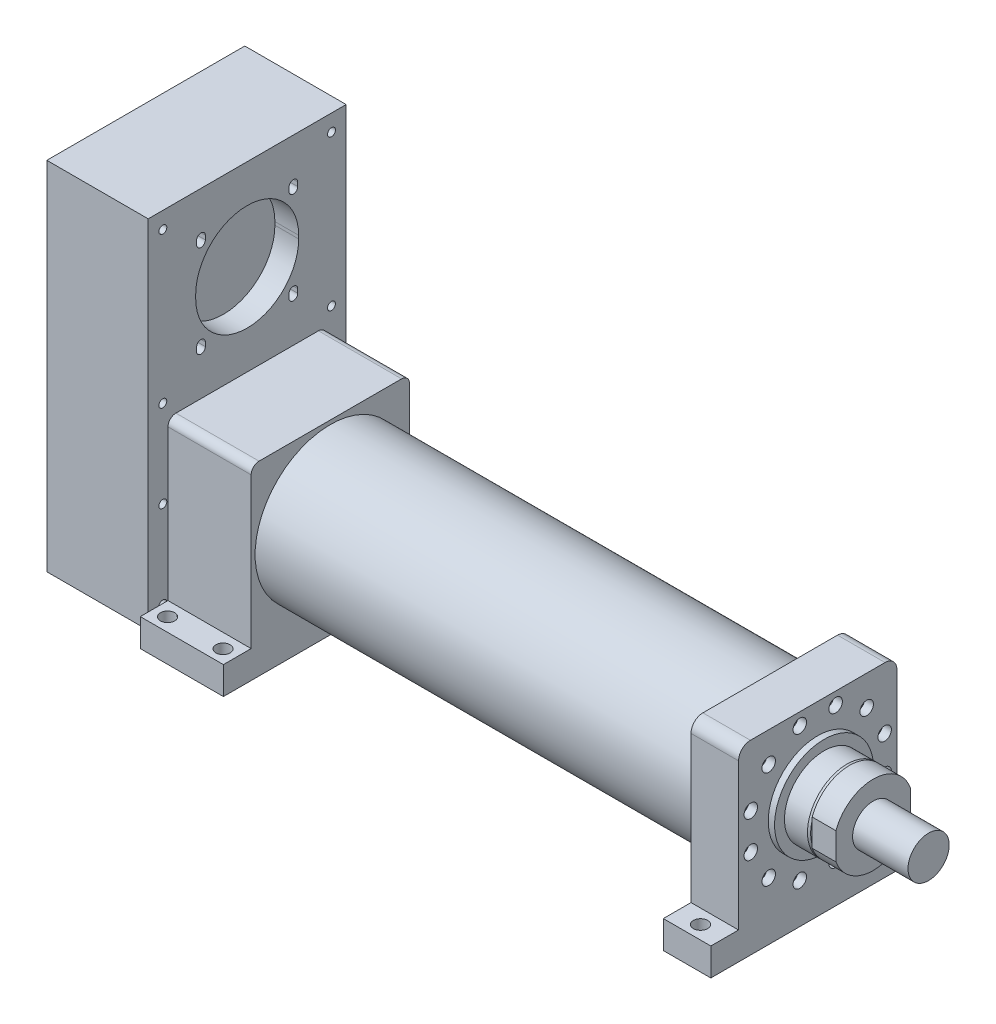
ISO-10303-21;
HEADER;
FILE_DESCRIPTION(('STEP AP214'),'2;1');
FILE_NAME('part.step','',(''),(''),'','','');
FILE_SCHEMA(('AUTOMOTIVE_DESIGN { 1 0 10303 214 1 1 1 1 }'));
ENDSEC;
DATA;
#1=APPLICATION_CONTEXT('core data for automotive mechanical design processes');
#2=APPLICATION_PROTOCOL_DEFINITION('international standard','automotive_design',2000,#1);
#3=PRODUCT_CONTEXT('',#1,'mechanical');
#4=PRODUCT('Part','Part','',(#3));
#5=PRODUCT_RELATED_PRODUCT_CATEGORY('part','',(#4));
#6=PRODUCT_DEFINITION_FORMATION('','',#4);
#7=PRODUCT_DEFINITION_CONTEXT('part definition',#1,'design');
#8=PRODUCT_DEFINITION('design','',#6,#7);
#9=PRODUCT_DEFINITION_SHAPE('','',#8);
#10=(LENGTH_UNIT() NAMED_UNIT(*) SI_UNIT(.MILLI.,.METRE.));
#11=(NAMED_UNIT(*) PLANE_ANGLE_UNIT() SI_UNIT($,.RADIAN.));
#12=(NAMED_UNIT(*) SI_UNIT($,.STERADIAN.) SOLID_ANGLE_UNIT());
#13=UNCERTAINTY_MEASURE_WITH_UNIT(LENGTH_MEASURE(1.E-05),#10,'distance_accuracy_value','');
#14=(GEOMETRIC_REPRESENTATION_CONTEXT(3) GLOBAL_UNCERTAINTY_ASSIGNED_CONTEXT((#13)) GLOBAL_UNIT_ASSIGNED_CONTEXT((#10,
#11,#12)) REPRESENTATION_CONTEXT('',''));
#15=CARTESIAN_POINT('',(0.,0.,0.));
#16=DIRECTION('',(0.,0.,1.));
#17=DIRECTION('',(1.,0.,0.));
#18=AXIS2_PLACEMENT_3D('',#15,#16,#17);
#19=CARTESIAN_POINT('',(755.5,0.,0.));
#20=DIRECTION('',(-1.,0.,0.));
#21=DIRECTION('',(0.,0.,1.));
#22=AXIS2_PLACEMENT_3D('',#19,#20,#21);
#23=CYLINDRICAL_SURFACE('',#22,26.);
#24=CARTESIAN_POINT('',(755.5,0.,0.));
#25=DIRECTION('',(1.,0.,0.));
#26=DIRECTION('',(0.,0.,-1.));
#27=AXIS2_PLACEMENT_3D('',#24,#25,#26);
#28=CIRCLE('',#27,26.);
#29=CARTESIAN_POINT('',(755.5,0.,-26.));
#30=VERTEX_POINT('',#29);
#31=EDGE_CURVE('E12',#30,#30,#28,.T.);
#32=ORIENTED_EDGE('',*,*,#31,.F.);
#33=EDGE_LOOP('',(#32));
#34=FACE_BOUND('',#33,.T.);
#35=CARTESIAN_POINT('',(685.5,0.,0.));
#36=DIRECTION('',(1.,0.,0.));
#37=DIRECTION('',(0.,0.,-1.));
#38=AXIS2_PLACEMENT_3D('',#35,#36,#37);
#39=CIRCLE('',#38,26.);
#40=CARTESIAN_POINT('',(685.5,0.,-26.));
#41=VERTEX_POINT('',#40);
#42=EDGE_CURVE('E144',#41,#41,#39,.T.);
#43=ORIENTED_EDGE('',*,*,#42,.T.);
#44=EDGE_LOOP('',(#43));
#45=FACE_BOUND('',#44,.T.);
#46=ADVANCED_FACE('F141',(#34,#45),#23,.T.);
#47=CARTESIAN_POINT('',(755.5,0.,0.));
#48=DIRECTION('',(1.,0.,0.));
#49=DIRECTION('',(0.,0.,-1.));
#50=AXIS2_PLACEMENT_3D('',#47,#48,#49);
#51=PLANE('',#50);
#52=ORIENTED_EDGE('',*,*,#31,.T.);
#53=EDGE_LOOP('',(#52));
#54=FACE_BOUND('',#53,.T.);
#55=ADVANCED_FACE('F156',(#54),#51,.T.);
#56=CARTESIAN_POINT('',(685.5,0.,0.));
#57=DIRECTION('',(1.,0.,0.));
#58=DIRECTION('',(0.,0.,-1.));
#59=AXIS2_PLACEMENT_3D('',#56,#57,#58);
#60=PLANE('',#59);
#61=ORIENTED_EDGE('',*,*,#42,.F.);
#62=EDGE_LOOP('',(#61));
#63=FACE_BOUND('',#62,.T.);
#64=ADVANCED_FACE('F154',(#63),#60,.F.);
#65=CLOSED_SHELL('',(#46,#55,#64));
#66=MANIFOLD_SOLID_BREP('B2',#65);
#67=CARTESIAN_POINT('',(685.5,17.058722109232,-47.));
#68=DIRECTION('',(0.,0.,-1.));
#69=DIRECTION('',(-1.,0.,0.));
#70=AXIS2_PLACEMENT_3D('',#67,#68,#69);
#71=PLANE('',#70);
#72=DIRECTION('',(0.,-1.,0.));
#73=VECTOR('',#72,1.);
#74=CARTESIAN_POINT('',(655.5,17.058722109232,-47.));
#75=LINE('',#74,#73);
#76=CARTESIAN_POINT('',(655.5,17.058722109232,-47.));
#77=VERTEX_POINT('',#76);
#78=CARTESIAN_POINT('',(655.5,-17.058722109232,-47.));
#79=VERTEX_POINT('',#78);
#80=EDGE_CURVE('E254',#77,#79,#75,.T.);
#81=ORIENTED_EDGE('',*,*,#80,.F.);
#82=DIRECTION('',(-1.,0.,0.));
#83=VECTOR('',#82,1.);
#84=CARTESIAN_POINT('',(685.5,17.058722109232,-47.));
#85=LINE('',#84,#83);
#86=CARTESIAN_POINT('',(685.5,17.058722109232,-47.));
#87=VERTEX_POINT('',#86);
#88=EDGE_CURVE('E139',#87,#77,#85,.T.);
#89=ORIENTED_EDGE('',*,*,#88,.F.);
#90=DIRECTION('',(0.,-1.,0.));
#91=VECTOR('',#90,1.);
#92=CARTESIAN_POINT('',(685.5,17.058722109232,-47.));
#93=LINE('',#92,#91);
#94=CARTESIAN_POINT('',(685.5,-17.058722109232,-47.));
#95=VERTEX_POINT('',#94);
#96=EDGE_CURVE('E249',#87,#95,#93,.T.);
#97=ORIENTED_EDGE('',*,*,#96,.T.);
#98=DIRECTION('',(-1.,0.,0.));
#99=VECTOR('',#98,1.);
#100=CARTESIAN_POINT('',(685.5,-17.058722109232,-47.));
#101=LINE('',#100,#99);
#102=EDGE_CURVE('E192',#95,#79,#101,.T.);
#103=ORIENTED_EDGE('',*,*,#102,.T.);
#104=EDGE_LOOP('',(#81,#89,#97,#103));
#105=FACE_BOUND('',#104,.T.);
#106=ADVANCED_FACE('F189',(#105),#71,.T.);
#107=CARTESIAN_POINT('',(685.5,0.,0.));
#108=DIRECTION('',(-1.,0.,0.));
#109=DIRECTION('',(0.,0.,1.));
#110=AXIS2_PLACEMENT_3D('',#107,#108,#109);
#111=CYLINDRICAL_SURFACE('',#110,50.);
#112=CARTESIAN_POINT('',(655.5,0.,0.));
#113=DIRECTION('',(1.,0.,0.));
#114=DIRECTION('',(0.,0.,-1.));
#115=AXIS2_PLACEMENT_3D('',#112,#113,#114);
#116=CIRCLE('',#115,50.);
#117=CARTESIAN_POINT('',(655.5,17.058722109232,47.));
#118=VERTEX_POINT('',#117);
#119=EDGE_CURVE('E222',#77,#118,#116,.T.);
#120=ORIENTED_EDGE('',*,*,#119,.T.);
#121=DIRECTION('',(-1.,0.,0.));
#122=VECTOR('',#121,1.);
#123=CARTESIAN_POINT('',(685.5,17.058722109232,47.));
#124=LINE('',#123,#122);
#125=CARTESIAN_POINT('',(685.5,17.058722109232,47.));
#126=VERTEX_POINT('',#125);
#127=EDGE_CURVE('E198',#126,#118,#124,.T.);
#128=ORIENTED_EDGE('',*,*,#127,.F.);
#129=CARTESIAN_POINT('',(685.5,0.,0.));
#130=DIRECTION('',(1.,0.,0.));
#131=DIRECTION('',(0.,0.,-1.));
#132=AXIS2_PLACEMENT_3D('',#129,#130,#131);
#133=CIRCLE('',#132,50.);
#134=EDGE_CURVE('E237',#87,#126,#133,.T.);
#135=ORIENTED_EDGE('',*,*,#134,.F.);
#136=ORIENTED_EDGE('',*,*,#88,.T.);
#137=EDGE_LOOP('',(#120,#128,#135,#136));
#138=FACE_BOUND('',#137,.T.);
#139=ADVANCED_FACE('F264',(#138),#111,.T.);
#140=CARTESIAN_POINT('',(685.5,17.058722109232,47.));
#141=DIRECTION('',(0.,0.,-1.));
#142=DIRECTION('',(-1.,0.,0.));
#143=AXIS2_PLACEMENT_3D('',#140,#141,#142);
#144=PLANE('',#143);
#145=DIRECTION('',(0.,-1.,0.));
#146=VECTOR('',#145,1.);
#147=CARTESIAN_POINT('',(655.5,17.058722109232,47.));
#148=LINE('',#147,#146);
#149=CARTESIAN_POINT('',(655.5,-17.058722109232,47.));
#150=VERTEX_POINT('',#149);
#151=EDGE_CURVE('E244',#118,#150,#148,.T.);
#152=ORIENTED_EDGE('',*,*,#151,.T.);
#153=DIRECTION('',(-1.,0.,0.));
#154=VECTOR('',#153,1.);
#155=CARTESIAN_POINT('',(685.5,-17.058722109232,47.));
#156=LINE('',#155,#154);
#157=CARTESIAN_POINT('',(685.5,-17.058722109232,47.));
#158=VERTEX_POINT('',#157);
#159=EDGE_CURVE('E241',#158,#150,#156,.T.);
#160=ORIENTED_EDGE('',*,*,#159,.F.);
#161=DIRECTION('',(0.,-1.,0.));
#162=VECTOR('',#161,1.);
#163=CARTESIAN_POINT('',(685.5,17.058722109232,47.));
#164=LINE('',#163,#162);
#165=EDGE_CURVE('E234',#126,#158,#164,.T.);
#166=ORIENTED_EDGE('',*,*,#165,.F.);
#167=ORIENTED_EDGE('',*,*,#127,.T.);
#168=EDGE_LOOP('',(#152,#160,#166,#167));
#169=FACE_BOUND('',#168,.T.);
#170=ADVANCED_FACE('F242',(#169),#144,.F.);
#171=CARTESIAN_POINT('',(685.5,0.,0.));
#172=DIRECTION('',(-1.,0.,0.));
#173=DIRECTION('',(0.,0.,1.));
#174=AXIS2_PLACEMENT_3D('',#171,#172,#173);
#175=CYLINDRICAL_SURFACE('',#174,50.);
#176=CARTESIAN_POINT('',(655.5,0.,0.));
#177=DIRECTION('',(1.,0.,0.));
#178=DIRECTION('',(0.,0.,-1.));
#179=AXIS2_PLACEMENT_3D('',#176,#177,#178);
#180=CIRCLE('',#179,50.);
#181=EDGE_CURVE('E257',#150,#79,#180,.T.);
#182=ORIENTED_EDGE('',*,*,#181,.T.);
#183=ORIENTED_EDGE('',*,*,#102,.F.);
#184=CARTESIAN_POINT('',(685.5,0.,0.));
#185=DIRECTION('',(1.,0.,0.));
#186=DIRECTION('',(0.,0.,-1.));
#187=AXIS2_PLACEMENT_3D('',#184,#185,#186);
#188=CIRCLE('',#187,50.);
#189=EDGE_CURVE('E231',#158,#95,#188,.T.);
#190=ORIENTED_EDGE('',*,*,#189,.F.);
#191=ORIENTED_EDGE('',*,*,#159,.T.);
#192=EDGE_LOOP('',(#182,#183,#190,#191));
#193=FACE_BOUND('',#192,.T.);
#194=ADVANCED_FACE('F248',(#193),#175,.T.);
#195=CARTESIAN_POINT('',(685.5,0.,0.));
#196=DIRECTION('',(1.,0.,0.));
#197=DIRECTION('',(0.,0.,-1.));
#198=AXIS2_PLACEMENT_3D('',#195,#196,#197);
#199=PLANE('',#198);
#200=ORIENTED_EDGE('',*,*,#96,.F.);
#201=ORIENTED_EDGE('',*,*,#134,.T.);
#202=ORIENTED_EDGE('',*,*,#165,.T.);
#203=ORIENTED_EDGE('',*,*,#189,.T.);
#204=EDGE_LOOP('',(#200,#201,#202,#203));
#205=FACE_BOUND('',#204,.T.);
#206=ADVANCED_FACE('F236',(#205),#199,.T.);
#207=CARTESIAN_POINT('',(655.5,0.,0.));
#208=DIRECTION('',(1.,0.,0.));
#209=DIRECTION('',(0.,0.,-1.));
#210=AXIS2_PLACEMENT_3D('',#207,#208,#209);
#211=PLANE('',#210);
#212=ORIENTED_EDGE('',*,*,#80,.T.);
#213=ORIENTED_EDGE('',*,*,#181,.F.);
#214=ORIENTED_EDGE('',*,*,#151,.F.);
#215=ORIENTED_EDGE('',*,*,#119,.F.);
#216=EDGE_LOOP('',(#212,#213,#214,#215));
#217=FACE_BOUND('',#216,.T.);
#218=ADVANCED_FACE('F262',(#217),#211,.F.);
#219=CLOSED_SHELL('',(#106,#139,#170,#194,#206,#218));
#220=MANIFOLD_SOLID_BREP('B7',#219);
#221=CARTESIAN_POINT('',(655.5,0.,0.));
#222=DIRECTION('',(-1.,0.,0.));
#223=DIRECTION('',(0.,0.,1.));
#224=AXIS2_PLACEMENT_3D('',#221,#222,#223);
#225=CYLINDRICAL_SURFACE('',#224,50.);
#226=CARTESIAN_POINT('',(652.5,0.,0.));
#227=DIRECTION('',(1.,0.,0.));
#228=DIRECTION('',(0.,0.,-1.));
#229=AXIS2_PLACEMENT_3D('',#226,#227,#228);
#230=CIRCLE('',#229,50.);
#231=CARTESIAN_POINT('',(652.5,0.,-50.));
#232=VERTEX_POINT('',#231);
#233=EDGE_CURVE('E188',#232,#232,#230,.F.);
#234=ORIENTED_EDGE('',*,*,#233,.T.);
#235=EDGE_LOOP('',(#234));
#236=FACE_BOUND('',#235,.T.);
#237=CARTESIAN_POINT('',(623.5,0.,0.));
#238=DIRECTION('',(1.,0.,0.));
#239=DIRECTION('',(0.,0.,-1.));
#240=AXIS2_PLACEMENT_3D('',#237,#238,#239);
#241=CIRCLE('',#240,50.);
#242=CARTESIAN_POINT('',(623.5,0.,-50.));
#243=VERTEX_POINT('',#242);
#244=EDGE_CURVE('E331',#243,#243,#241,.T.);
#245=ORIENTED_EDGE('',*,*,#244,.T.);
#246=EDGE_LOOP('',(#245));
#247=FACE_BOUND('',#246,.T.);
#248=ADVANCED_FACE('F320',(#236,#247),#225,.T.);
#249=CARTESIAN_POINT('',(655.5,0.,0.));
#250=DIRECTION('',(1.,0.,0.));
#251=DIRECTION('',(0.,0.,-1.));
#252=AXIS2_PLACEMENT_3D('',#249,#250,#251);
#253=PLANE('',#252);
#254=CARTESIAN_POINT('',(655.5,0.,0.));
#255=DIRECTION('',(1.,0.,0.));
#256=DIRECTION('',(0.,0.,-1.));
#257=AXIS2_PLACEMENT_3D('',#254,#255,#256);
#258=CIRCLE('',#257,48.9080892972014);
#259=CARTESIAN_POINT('',(655.5,0.,-48.9080892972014));
#260=VERTEX_POINT('',#259);
#261=EDGE_CURVE('E327',#260,#260,#258,.T.);
#262=ORIENTED_EDGE('',*,*,#261,.T.);
#263=EDGE_LOOP('',(#262));
#264=FACE_BOUND('',#263,.T.);
#265=ADVANCED_FACE('F341',(#264),#253,.T.);
#266=CARTESIAN_POINT('',(623.5,0.,0.));
#267=DIRECTION('',(1.,0.,0.));
#268=DIRECTION('',(0.,0.,-1.));
#269=AXIS2_PLACEMENT_3D('',#266,#267,#268);
#270=PLANE('',#269);
#271=ORIENTED_EDGE('',*,*,#244,.F.);
#272=EDGE_LOOP('',(#271));
#273=FACE_BOUND('',#272,.T.);
#274=ADVANCED_FACE('F339',(#273),#270,.F.);
#275=CARTESIAN_POINT('',(655.5,0.,0.));
#276=DIRECTION('',(-1.,0.,0.));
#277=DIRECTION('',(0.,0.,1.));
#278=AXIS2_PLACEMENT_3D('',#275,#276,#277);
#279=CONICAL_SURFACE('',#278,48.9080892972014,0.349065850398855);
#280=ORIENTED_EDGE('',*,*,#233,.F.);
#281=EDGE_LOOP('',(#280));
#282=FACE_BOUND('',#281,.T.);
#283=ORIENTED_EDGE('',*,*,#261,.F.);
#284=EDGE_LOOP('',(#283));
#285=FACE_BOUND('',#284,.T.);
#286=ADVANCED_FACE('F322',(#282,#285),#279,.T.);
#287=CLOSED_SHELL('',(#248,#265,#274,#286));
#288=MANIFOLD_SOLID_BREP('B133',#287);
#289=CARTESIAN_POINT('',(623.5,0.,0.));
#290=DIRECTION('',(-1.,0.,0.));
#291=DIRECTION('',(0.,0.,1.));
#292=AXIS2_PLACEMENT_3D('',#289,#290,#291);
#293=CYLINDRICAL_SURFACE('',#292,62.5);
#294=CARTESIAN_POINT('',(623.5,0.,0.));
#295=DIRECTION('',(1.,0.,0.));
#296=DIRECTION('',(0.,0.,-1.));
#297=AXIS2_PLACEMENT_3D('',#294,#295,#296);
#298=CIRCLE('',#297,62.5);
#299=CARTESIAN_POINT('',(623.5,0.,-62.5));
#300=VERTEX_POINT('',#299);
#301=EDGE_CURVE('E319',#300,#300,#298,.T.);
#302=ORIENTED_EDGE('',*,*,#301,.F.);
#303=EDGE_LOOP('',(#302));
#304=FACE_BOUND('',#303,.T.);
#305=CARTESIAN_POINT('',(615.5,0.,0.));
#306=DIRECTION('',(1.,0.,0.));
#307=DIRECTION('',(0.,0.,-1.));
#308=AXIS2_PLACEMENT_3D('',#305,#306,#307);
#309=CIRCLE('',#308,62.5);
#310=CARTESIAN_POINT('',(615.5,0.,-62.5));
#311=VERTEX_POINT('',#310);
#312=EDGE_CURVE('E387',#311,#311,#309,.T.);
#313=ORIENTED_EDGE('',*,*,#312,.T.);
#314=EDGE_LOOP('',(#313));
#315=FACE_BOUND('',#314,.T.);
#316=ADVANCED_FACE('F384',(#304,#315),#293,.T.);
#317=CARTESIAN_POINT('',(623.5,0.,0.));
#318=DIRECTION('',(1.,0.,0.));
#319=DIRECTION('',(0.,0.,-1.));
#320=AXIS2_PLACEMENT_3D('',#317,#318,#319);
#321=PLANE('',#320);
#322=ORIENTED_EDGE('',*,*,#301,.T.);
#323=EDGE_LOOP('',(#322));
#324=FACE_BOUND('',#323,.T.);
#325=ADVANCED_FACE('F399',(#324),#321,.T.);
#326=CARTESIAN_POINT('',(615.5,0.,0.));
#327=DIRECTION('',(1.,0.,0.));
#328=DIRECTION('',(0.,0.,-1.));
#329=AXIS2_PLACEMENT_3D('',#326,#327,#328);
#330=PLANE('',#329);
#331=ORIENTED_EDGE('',*,*,#312,.F.);
#332=EDGE_LOOP('',(#331));
#333=FACE_BOUND('',#332,.T.);
#334=ADVANCED_FACE('F397',(#333),#330,.F.);
#335=CLOSED_SHELL('',(#316,#325,#334));
#336=MANIFOLD_SOLID_BREP('B183',#335);
#337=CARTESIAN_POINT('',(-105.,0.,0.));
#338=DIRECTION('',(-1.,0.,0.));
#339=DIRECTION('',(0.,0.,1.));
#340=AXIS2_PLACEMENT_3D('',#337,#338,#339);
#341=PLANE('',#340);
#342=DIRECTION('',(0.,-1.,0.));
#343=VECTOR('',#342,1.);
#344=CARTESIAN_POINT('',(-105.,159.16369055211,52.8363094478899));
#345=LINE('',#344,#343);
#346=CARTESIAN_POINT('',(-105.,159.16369055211,52.8363094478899));
#347=VERTEX_POINT('',#346);
#348=CARTESIAN_POINT('',(-105.,154.16369055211,52.8363094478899));
#349=VERTEX_POINT('',#348);
#350=EDGE_CURVE('E861',#347,#349,#345,.T.);
#351=ORIENTED_EDGE('',*,*,#350,.T.);
#352=CARTESIAN_POINT('',(-105.,154.16369055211,58.3363094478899));
#353=DIRECTION('',(-1.,0.,0.));
#354=DIRECTION('',(0.,0.,1.));
#355=AXIS2_PLACEMENT_3D('',#352,#353,#354);
#356=CIRCLE('',#355,5.49999999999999);
#357=CARTESIAN_POINT('',(-105.,154.16369055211,63.8363094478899));
#358=VERTEX_POINT('',#357);
#359=EDGE_CURVE('E911',#349,#358,#356,.T.);
#360=ORIENTED_EDGE('',*,*,#359,.T.);
#361=DIRECTION('',(0.,-1.,0.));
#362=VECTOR('',#361,1.);
#363=CARTESIAN_POINT('',(-105.,159.16369055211,63.8363094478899));
#364=LINE('',#363,#362);
#365=CARTESIAN_POINT('',(-105.,159.16369055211,63.8363094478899));
#366=VERTEX_POINT('',#365);
#367=EDGE_CURVE('E907',#366,#358,#364,.T.);
#368=ORIENTED_EDGE('',*,*,#367,.F.);
#369=CARTESIAN_POINT('',(-105.,159.16369055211,58.3363094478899));
#370=DIRECTION('',(-1.,0.,0.));
#371=DIRECTION('',(0.,0.,1.));
#372=AXIS2_PLACEMENT_3D('',#369,#370,#371);
#373=CIRCLE('',#372,5.49999999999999);
#374=EDGE_CURVE('E904',#366,#347,#373,.T.);
#375=ORIENTED_EDGE('',*,*,#374,.T.);
#376=EDGE_LOOP('',(#351,#360,#368,#375));
#377=FACE_BOUND('',#376,.T.);
#378=DIRECTION('',(0.,-1.,0.));
#379=VECTOR('',#378,1.);
#380=CARTESIAN_POINT('',(-105.,217.,-65.));
#381=LINE('',#380,#379);
#382=CARTESIAN_POINT('',(-105.,217.,-65.));
#383=VERTEX_POINT('',#382);
#384=CARTESIAN_POINT('',(-105.,213.,-65.));
#385=VERTEX_POINT('',#384);
#386=EDGE_CURVE('E882',#383,#385,#381,.T.);
#387=ORIENTED_EDGE('',*,*,#386,.T.);
#388=CARTESIAN_POINT('',(-105.,213.,0.));
#389=DIRECTION('',(1.,0.,0.));
#390=DIRECTION('',(0.,0.,-1.));
#391=AXIS2_PLACEMENT_3D('',#388,#389,#390);
#392=CIRCLE('',#391,65.);
#393=CARTESIAN_POINT('',(-105.,213.,65.));
#394=VERTEX_POINT('',#393);
#395=EDGE_CURVE('E996',#394,#385,#392,.T.);
#396=ORIENTED_EDGE('',*,*,#395,.F.);
#397=DIRECTION('',(0.,-1.,0.));
#398=VECTOR('',#397,1.);
#399=CARTESIAN_POINT('',(-105.,217.,65.));
#400=LINE('',#399,#398);
#401=CARTESIAN_POINT('',(-105.,217.,65.));
#402=VERTEX_POINT('',#401);
#403=EDGE_CURVE('E999',#402,#394,#400,.T.);
#404=ORIENTED_EDGE('',*,*,#403,.F.);
#405=CARTESIAN_POINT('',(-105.,217.,0.));
#406=DIRECTION('',(1.,0.,0.));
#407=DIRECTION('',(0.,0.,-1.));
#408=AXIS2_PLACEMENT_3D('',#405,#406,#407);
#409=CIRCLE('',#408,65.);
#410=EDGE_CURVE('E984',#383,#402,#409,.T.);
#411=ORIENTED_EDGE('',*,*,#410,.F.);
#412=EDGE_LOOP('',(#387,#396,#404,#411));
#413=FACE_BOUND('',#412,.T.);
#414=CARTESIAN_POINT('',(-105.,119.,-106.500000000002));
#415=DIRECTION('',(1.,0.,0.));
#416=DIRECTION('',(0.,0.,-1.));
#417=AXIS2_PLACEMENT_3D('',#414,#415,#416);
#418=CIRCLE('',#417,5.00000000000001);
#419=CARTESIAN_POINT('',(-105.,119.,-111.500000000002));
#420=VERTEX_POINT('',#419);
#421=EDGE_CURVE('E1039',#420,#420,#418,.T.);
#422=ORIENTED_EDGE('',*,*,#421,.F.);
#423=EDGE_LOOP('',(#422));
#424=FACE_BOUND('',#423,.T.);
#425=CARTESIAN_POINT('',(-105.,8.99999999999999,106.499999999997));
#426=DIRECTION('',(1.,0.,0.));
#427=DIRECTION('',(0.,0.,-1.));
#428=AXIS2_PLACEMENT_3D('',#425,#426,#427);
#429=CIRCLE('',#428,5.00000000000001);
#430=CARTESIAN_POINT('',(-105.,8.99999999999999,101.499999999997));
#431=VERTEX_POINT('',#430);
#432=EDGE_CURVE('E1051',#431,#431,#429,.T.);
#433=ORIENTED_EDGE('',*,*,#432,.F.);
#434=EDGE_LOOP('',(#433));
#435=FACE_BOUND('',#434,.T.);
#436=CARTESIAN_POINT('',(-105.,119.,106.499999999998));
#437=DIRECTION('',(1.,0.,0.));
#438=DIRECTION('',(0.,0.,-1.));
#439=AXIS2_PLACEMENT_3D('',#436,#437,#438);
#440=CIRCLE('',#439,5.00000000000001);
#441=CARTESIAN_POINT('',(-105.,119.,101.499999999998));
#442=VERTEX_POINT('',#441);
#443=EDGE_CURVE('E1044',#442,#442,#440,.T.);
#444=ORIENTED_EDGE('',*,*,#443,.F.);
#445=EDGE_LOOP('',(#444));
#446=FACE_BOUND('',#445,.T.);
#447=CARTESIAN_POINT('',(-105.,8.99999999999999,-106.500000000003));
#448=DIRECTION('',(1.,0.,0.));
#449=DIRECTION('',(0.,0.,-1.));
#450=AXIS2_PLACEMENT_3D('',#447,#448,#449);
#451=CIRCLE('',#450,5.00000000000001);
#452=CARTESIAN_POINT('',(-105.,8.99999999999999,-111.500000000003));
#453=VERTEX_POINT('',#452);
#454=EDGE_CURVE('E1013',#453,#453,#451,.T.);
#455=ORIENTED_EDGE('',*,*,#454,.F.);
#456=EDGE_LOOP('',(#455));
#457=FACE_BOUND('',#456,.T.);
#458=CARTESIAN_POINT('',(-105.,309.,-106.5));
#459=DIRECTION('',(1.,0.,0.));
#460=DIRECTION('',(0.,0.,-1.));
#461=AXIS2_PLACEMENT_3D('',#458,#459,#460);
#462=CIRCLE('',#461,5.00000000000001);
#463=CARTESIAN_POINT('',(-105.,309.,-111.5));
#464=VERTEX_POINT('',#463);
#465=EDGE_CURVE('E1026',#464,#464,#462,.T.);
#466=ORIENTED_EDGE('',*,*,#465,.F.);
#467=EDGE_LOOP('',(#466));
#468=FACE_BOUND('',#467,.T.);
#469=CARTESIAN_POINT('',(-105.,309.,106.5));
#470=DIRECTION('',(1.,0.,0.));
#471=DIRECTION('',(0.,0.,-1.));
#472=AXIS2_PLACEMENT_3D('',#469,#470,#471);
#473=CIRCLE('',#472,5.00000000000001);
#474=CARTESIAN_POINT('',(-105.,309.,101.5));
#475=VERTEX_POINT('',#474);
#476=EDGE_CURVE('E1047',#475,#475,#473,.T.);
#477=ORIENTED_EDGE('',*,*,#476,.F.);
#478=EDGE_LOOP('',(#477));
#479=FACE_BOUND('',#478,.T.);
#480=DIRECTION('',(0.,1.,0.));
#481=VECTOR('',#480,1.);
#482=CARTESIAN_POINT('',(-105.,270.83630944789,63.8363094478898));
#483=LINE('',#482,#481);
#484=CARTESIAN_POINT('',(-105.,270.83630944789,63.8363094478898));
#485=VERTEX_POINT('',#484);
#486=CARTESIAN_POINT('',(-105.,275.836309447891,63.8363094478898));
#487=VERTEX_POINT('',#486);
#488=EDGE_CURVE('E879',#485,#487,#483,.T.);
#489=ORIENTED_EDGE('',*,*,#488,.T.);
#490=CARTESIAN_POINT('',(-105.,275.836309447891,58.3363094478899));
#491=DIRECTION('',(1.,0.,0.));
#492=DIRECTION('',(0.,0.,-1.));
#493=AXIS2_PLACEMENT_3D('',#490,#491,#492);
#494=CIRCLE('',#493,5.49999999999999);
#495=CARTESIAN_POINT('',(-105.,275.836309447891,52.8363094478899));
#496=VERTEX_POINT('',#495);
#497=EDGE_CURVE('E876',#496,#487,#494,.T.);
#498=ORIENTED_EDGE('',*,*,#497,.F.);
#499=DIRECTION('',(0.,1.,0.));
#500=VECTOR('',#499,1.);
#501=CARTESIAN_POINT('',(-105.,270.83630944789,52.8363094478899));
#502=LINE('',#501,#500);
#503=CARTESIAN_POINT('',(-105.,270.83630944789,52.8363094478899));
#504=VERTEX_POINT('',#503);
#505=EDGE_CURVE('E872',#504,#496,#502,.T.);
#506=ORIENTED_EDGE('',*,*,#505,.F.);
#507=CARTESIAN_POINT('',(-105.,270.83630944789,58.3363094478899));
#508=DIRECTION('',(1.,0.,0.));
#509=DIRECTION('',(0.,0.,-1.));
#510=AXIS2_PLACEMENT_3D('',#507,#508,#509);
#511=CIRCLE('',#510,5.49999999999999);
#512=EDGE_CURVE('E869',#485,#504,#511,.T.);
#513=ORIENTED_EDGE('',*,*,#512,.F.);
#514=EDGE_LOOP('',(#489,#498,#506,#513));
#515=FACE_BOUND('',#514,.T.);
#516=CARTESIAN_POINT('',(-105.,154.16369055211,-58.3363094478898));
#517=DIRECTION('',(1.,0.,0.));
#518=DIRECTION('',(0.,0.,-1.));
#519=AXIS2_PLACEMENT_3D('',#516,#517,#518);
#520=CIRCLE('',#519,5.49999999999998);
#521=CARTESIAN_POINT('',(-105.,154.16369055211,-52.8363094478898));
#522=VERTEX_POINT('',#521);
#523=CARTESIAN_POINT('',(-105.,154.16369055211,-63.8363094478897));
#524=VERTEX_POINT('',#523);
#525=EDGE_CURVE('E941',#522,#524,#520,.T.);
#526=ORIENTED_EDGE('',*,*,#525,.F.);
#527=DIRECTION('',(0.,-1.,0.));
#528=VECTOR('',#527,1.);
#529=CARTESIAN_POINT('',(-105.,159.16369055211,-52.8363094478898));
#530=LINE('',#529,#528);
#531=CARTESIAN_POINT('',(-105.,159.16369055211,-52.8363094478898));
#532=VERTEX_POINT('',#531);
#533=EDGE_CURVE('E896',#532,#522,#530,.T.);
#534=ORIENTED_EDGE('',*,*,#533,.F.);
#535=CARTESIAN_POINT('',(-105.,159.16369055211,-58.3363094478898));
#536=DIRECTION('',(1.,0.,0.));
#537=DIRECTION('',(0.,0.,-1.));
#538=AXIS2_PLACEMENT_3D('',#535,#536,#537);
#539=CIRCLE('',#538,5.5);
#540=CARTESIAN_POINT('',(-105.,159.16369055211,-63.8363094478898));
#541=VERTEX_POINT('',#540);
#542=EDGE_CURVE('E934',#541,#532,#539,.T.);
#543=ORIENTED_EDGE('',*,*,#542,.F.);
#544=DIRECTION('',(0.,-1.,0.));
#545=VECTOR('',#544,1.);
#546=CARTESIAN_POINT('',(-105.,159.16369055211,-63.8363094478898));
#547=LINE('',#546,#545);
#548=EDGE_CURVE('E937',#541,#524,#547,.T.);
#549=ORIENTED_EDGE('',*,*,#548,.T.);
#550=EDGE_LOOP('',(#526,#534,#543,#549));
#551=FACE_BOUND('',#550,.T.);
#552=CARTESIAN_POINT('',(-105.,275.836309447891,-58.3363094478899));
#553=DIRECTION('',(-1.,0.,0.));
#554=DIRECTION('',(0.,0.,1.));
#555=AXIS2_PLACEMENT_3D('',#552,#553,#554);
#556=CIRCLE('',#555,5.49999999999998);
#557=CARTESIAN_POINT('',(-105.,275.836309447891,-52.8363094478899));
#558=VERTEX_POINT('',#557);
#559=CARTESIAN_POINT('',(-105.,275.836309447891,-63.8363094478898));
#560=VERTEX_POINT('',#559);
#561=EDGE_CURVE('E970',#558,#560,#556,.T.);
#562=ORIENTED_EDGE('',*,*,#561,.T.);
#563=DIRECTION('',(0.,1.,0.));
#564=VECTOR('',#563,1.);
#565=CARTESIAN_POINT('',(-105.,270.83630944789,-63.8363094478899));
#566=LINE('',#565,#564);
#567=CARTESIAN_POINT('',(-105.,270.83630944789,-63.8363094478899));
#568=VERTEX_POINT('',#567);
#569=EDGE_CURVE('E450',#568,#560,#566,.T.);
#570=ORIENTED_EDGE('',*,*,#569,.F.);
#571=CARTESIAN_POINT('',(-105.,270.83630944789,-58.3363094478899));
#572=DIRECTION('',(-1.,0.,0.));
#573=DIRECTION('',(0.,0.,1.));
#574=AXIS2_PLACEMENT_3D('',#571,#572,#573);
#575=CIRCLE('',#574,5.5);
#576=CARTESIAN_POINT('',(-105.,270.83630944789,-52.8363094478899));
#577=VERTEX_POINT('',#576);
#578=EDGE_CURVE('E963',#568,#577,#575,.T.);
#579=ORIENTED_EDGE('',*,*,#578,.T.);
#580=DIRECTION('',(0.,1.,0.));
#581=VECTOR('',#580,1.);
#582=CARTESIAN_POINT('',(-105.,270.83630944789,-52.8363094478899));
#583=LINE('',#582,#581);
#584=EDGE_CURVE('E966',#577,#558,#583,.T.);
#585=ORIENTED_EDGE('',*,*,#584,.T.);
#586=EDGE_LOOP('',(#562,#570,#579,#585));
#587=FACE_BOUND('',#586,.T.);
#588=DIRECTION('',(0.,0.,-1.));
#589=VECTOR('',#588,1.);
#590=CARTESIAN_POINT('',(-105.,-100.,135.));
#591=LINE('',#590,#589);
#592=CARTESIAN_POINT('',(-105.,-100.,-111.398979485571));
#593=VERTEX_POINT('',#592);
#594=CARTESIAN_POINT('',(-105.,-100.,-125.));
#595=VERTEX_POINT('',#594);
#596=EDGE_CURVE('E1720',#593,#595,#591,.T.);
#597=ORIENTED_EDGE('',*,*,#596,.T.);
#598=DIRECTION('',(0.,-1.,0.));
#599=VECTOR('',#598,1.);
#600=CARTESIAN_POINT('',(-105.,330.,-125.));
#601=LINE('',#600,#599);
#602=CARTESIAN_POINT('',(-105.,330.,-125.));
#603=VERTEX_POINT('',#602);
#604=EDGE_CURVE('E1078',#603,#595,#601,.T.);
#605=ORIENTED_EDGE('',*,*,#604,.F.);
#606=DIRECTION('',(0.,0.,-1.));
#607=VECTOR('',#606,1.);
#608=CARTESIAN_POINT('',(-105.,330.,-125.));
#609=LINE('',#608,#607);
#610=CARTESIAN_POINT('',(-105.,330.,125.));
#611=VERTEX_POINT('',#610);
#612=EDGE_CURVE('E1076',#611,#603,#609,.T.);
#613=ORIENTED_EDGE('',*,*,#612,.F.);
#614=DIRECTION('',(0.,1.,0.));
#615=VECTOR('',#614,1.);
#616=CARTESIAN_POINT('',(-105.,330.,125.));
#617=LINE('',#616,#615);
#618=CARTESIAN_POINT('',(-105.,-100.,125.));
#619=VERTEX_POINT('',#618);
#620=EDGE_CURVE('E1059',#619,#611,#617,.T.);
#621=ORIENTED_EDGE('',*,*,#620,.F.);
#622=CARTESIAN_POINT('',(-105.,-100.,111.398979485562));
#623=VERTEX_POINT('',#622);
#624=EDGE_CURVE('E804',#619,#623,#591,.T.);
#625=ORIENTED_EDGE('',*,*,#624,.T.);
#626=CARTESIAN_POINT('',(-105.,-101.,106.499999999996));
#627=DIRECTION('',(1.,0.,0.));
#628=DIRECTION('',(0.,0.,-1.));
#629=AXIS2_PLACEMENT_3D('',#626,#627,#628);
#630=CIRCLE('',#629,5.00000000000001);
#631=CARTESIAN_POINT('',(-105.,-100.,101.601020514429));
#632=VERTEX_POINT('',#631);
#633=EDGE_CURVE('E1031',#632,#623,#630,.T.);
#634=ORIENTED_EDGE('',*,*,#633,.F.);
#635=CARTESIAN_POINT('',(-105.,-100.,100.));
#636=VERTEX_POINT('',#635);
#637=EDGE_CURVE('E1748',#632,#636,#591,.T.);
#638=ORIENTED_EDGE('',*,*,#637,.T.);
#639=DIRECTION('',(0.,1.,0.));
#640=VECTOR('',#639,1.);
#641=CARTESIAN_POINT('',(-105.,-90.,100.));
#642=LINE('',#641,#640);
#643=CARTESIAN_POINT('',(-105.,89.9999999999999,99.9999999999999));
#644=VERTEX_POINT('',#643);
#645=EDGE_CURVE('E1095',#636,#644,#642,.T.);
#646=ORIENTED_EDGE('',*,*,#645,.T.);
#647=CARTESIAN_POINT('',(-105.,90.,90.));
#648=DIRECTION('',(-1.,0.,0.));
#649=DIRECTION('',(0.,0.,1.));
#650=AXIS2_PLACEMENT_3D('',#647,#648,#649);
#651=CIRCLE('',#650,9.99999999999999);
#652=CARTESIAN_POINT('',(-105.,100.,89.9999999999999));
#653=VERTEX_POINT('',#652);
#654=EDGE_CURVE('E1098',#644,#653,#651,.T.);
#655=ORIENTED_EDGE('',*,*,#654,.T.);
#656=DIRECTION('',(0.,0.,-1.));
#657=VECTOR('',#656,1.);
#658=CARTESIAN_POINT('',(-105.,100.,-90.));
#659=LINE('',#658,#657);
#660=CARTESIAN_POINT('',(-105.,100.,-90.));
#661=VERTEX_POINT('',#660);
#662=EDGE_CURVE('E1102',#653,#661,#659,.T.);
#663=ORIENTED_EDGE('',*,*,#662,.T.);
#664=CARTESIAN_POINT('',(-105.,90.,-90.0000000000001));
#665=DIRECTION('',(-1.,0.,0.));
#666=DIRECTION('',(0.,0.,-1.));
#667=AXIS2_PLACEMENT_3D('',#664,#665,#666);
#668=CIRCLE('',#667,9.99999999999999);
#669=CARTESIAN_POINT('',(-105.,89.9999999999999,-100.));
#670=VERTEX_POINT('',#669);
#671=EDGE_CURVE('E1105',#661,#670,#668,.T.);
#672=ORIENTED_EDGE('',*,*,#671,.T.);
#673=DIRECTION('',(0.,-1.,0.));
#674=VECTOR('',#673,1.);
#675=CARTESIAN_POINT('',(-105.,89.9999999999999,-100.));
#676=LINE('',#675,#674);
#677=CARTESIAN_POINT('',(-105.,-100.,-100.));
#678=VERTEX_POINT('',#677);
#679=EDGE_CURVE('E1108',#670,#678,#676,.T.);
#680=ORIENTED_EDGE('',*,*,#679,.T.);
#681=CARTESIAN_POINT('',(-105.,-100.,-101.601020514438));
#682=VERTEX_POINT('',#681);
#683=EDGE_CURVE('E1750',#678,#682,#591,.T.);
#684=ORIENTED_EDGE('',*,*,#683,.T.);
#685=CARTESIAN_POINT('',(-105.,-101.,-106.500000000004));
#686=DIRECTION('',(1.,0.,0.));
#687=DIRECTION('',(0.,0.,-1.));
#688=AXIS2_PLACEMENT_3D('',#685,#686,#687);
#689=CIRCLE('',#688,5.00000000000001);
#690=EDGE_CURVE('E1020',#593,#682,#689,.T.);
#691=ORIENTED_EDGE('',*,*,#690,.F.);
#692=EDGE_LOOP('',(#597,#605,#613,#621,#625,#634,#638,#646,#655,#663,#672,#680,#684,#691));
#693=FACE_BOUND('',#692,.T.);
#694=ADVANCED_FACE('F425',(#377,#413,#424,#435,#446,#457,#468,#479,#515,#551,#587,#693),#341,.F.);
#695=CARTESIAN_POINT('',(555.5,0.,0.));
#696=DIRECTION('',(-1.,0.,0.));
#697=DIRECTION('',(0.,0.,1.));
#698=AXIS2_PLACEMENT_3D('',#695,#696,#697);
#699=CYLINDRICAL_SURFACE('',#698,95.);
#700=CARTESIAN_POINT('',(555.5,0.,0.));
#701=DIRECTION('',(1.,0.,0.));
#702=DIRECTION('',(0.,0.,-1.));
#703=AXIS2_PLACEMENT_3D('',#700,#701,#702);
#704=CIRCLE('',#703,95.);
#705=CARTESIAN_POINT('',(555.5,0.,-95.));
#706=VERTEX_POINT('',#705);
#707=EDGE_CURVE('E382',#706,#706,#704,.T.);
#708=ORIENTED_EDGE('',*,*,#707,.F.);
#709=EDGE_LOOP('',(#708));
#710=FACE_BOUND('',#709,.T.);
#711=CARTESIAN_POINT('',(0.,0.,0.));
#712=DIRECTION('',(1.,0.,0.));
#713=DIRECTION('',(0.,0.,-1.));
#714=AXIS2_PLACEMENT_3D('',#711,#712,#713);
#715=CIRCLE('',#714,95.);
#716=CARTESIAN_POINT('',(0.,0.,-95.));
#717=VERTEX_POINT('',#716);
#718=EDGE_CURVE('E1138',#717,#717,#715,.T.);
#719=ORIENTED_EDGE('',*,*,#718,.T.);
#720=EDGE_LOOP('',(#719));
#721=FACE_BOUND('',#720,.T.);
#722=ADVANCED_FACE('F427',(#710,#721),#699,.T.);
#723=CARTESIAN_POINT('',(615.5,84.9999999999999,-100.));
#724=DIRECTION('',(0.,0.,1.));
#725=DIRECTION('',(0.,-1.,0.));
#726=AXIS2_PLACEMENT_3D('',#723,#724,#725);
#727=PLANE('',#726);
#728=DIRECTION('',(0.,1.,0.));
#729=VECTOR('',#728,1.);
#730=CARTESIAN_POINT('',(555.5,84.9999999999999,-100.));
#731=LINE('',#730,#729);
#732=CARTESIAN_POINT('',(555.5,-100.,-100.));
#733=VERTEX_POINT('',#732);
#734=CARTESIAN_POINT('',(555.5,84.9999999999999,-100.));
#735=VERTEX_POINT('',#734);
#736=EDGE_CURVE('E1213',#733,#735,#731,.T.);
#737=ORIENTED_EDGE('',*,*,#736,.T.);
#738=DIRECTION('',(-1.,0.,0.));
#739=VECTOR('',#738,1.);
#740=CARTESIAN_POINT('',(615.5,84.9999999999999,-100.));
#741=LINE('',#740,#739);
#742=CARTESIAN_POINT('',(615.5,84.9999999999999,-100.));
#743=VERTEX_POINT('',#742);
#744=EDGE_CURVE('E1251',#743,#735,#741,.T.);
#745=ORIENTED_EDGE('',*,*,#744,.F.);
#746=DIRECTION('',(0.,1.,0.));
#747=VECTOR('',#746,1.);
#748=CARTESIAN_POINT('',(615.5,-100.,-100.));
#749=LINE('',#748,#747);
#750=CARTESIAN_POINT('',(615.5,-100.,-100.));
#751=VERTEX_POINT('',#750);
#752=EDGE_CURVE('E1216',#751,#743,#749,.T.);
#753=ORIENTED_EDGE('',*,*,#752,.F.);
#754=DIRECTION('',(-1.,0.,0.));
#755=VECTOR('',#754,1.);
#756=CARTESIAN_POINT('',(615.5,-100.,-100.));
#757=LINE('',#756,#755);
#758=EDGE_CURVE('E1227',#751,#733,#757,.T.);
#759=ORIENTED_EDGE('',*,*,#758,.T.);
#760=EDGE_LOOP('',(#737,#745,#753,#759));
#761=FACE_BOUND('',#760,.T.);
#762=ADVANCED_FACE('F1337',(#761),#727,.F.);
#763=CARTESIAN_POINT('',(615.5,85.,-85.));
#764=DIRECTION('',(-1.,0.,0.));
#765=DIRECTION('',(0.,0.,1.));
#766=AXIS2_PLACEMENT_3D('',#763,#764,#765);
#767=CYLINDRICAL_SURFACE('',#766,15.);
#768=CARTESIAN_POINT('',(555.5,85.,-85.));
#769=DIRECTION('',(1.,0.,0.));
#770=DIRECTION('',(0.,0.,-1.));
#771=AXIS2_PLACEMENT_3D('',#768,#769,#770);
#772=CIRCLE('',#771,15.);
#773=CARTESIAN_POINT('',(555.5,100.,-84.9999999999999));
#774=VERTEX_POINT('',#773);
#775=EDGE_CURVE('E1229',#735,#774,#772,.T.);
#776=ORIENTED_EDGE('',*,*,#775,.T.);
#777=DIRECTION('',(-1.,0.,0.));
#778=VECTOR('',#777,1.);
#779=CARTESIAN_POINT('',(615.5,100.,-84.9999999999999));
#780=LINE('',#779,#778);
#781=CARTESIAN_POINT('',(615.5,100.,-84.9999999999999));
#782=VERTEX_POINT('',#781);
#783=EDGE_CURVE('E1248',#782,#774,#780,.T.);
#784=ORIENTED_EDGE('',*,*,#783,.F.);
#785=CARTESIAN_POINT('',(615.5,85.,-85.));
#786=DIRECTION('',(1.,0.,0.));
#787=DIRECTION('',(0.,0.,-1.));
#788=AXIS2_PLACEMENT_3D('',#785,#786,#787);
#789=CIRCLE('',#788,15.);
#790=EDGE_CURVE('E1218',#743,#782,#789,.T.);
#791=ORIENTED_EDGE('',*,*,#790,.F.);
#792=ORIENTED_EDGE('',*,*,#744,.T.);
#793=EDGE_LOOP('',(#776,#784,#791,#792));
#794=FACE_BOUND('',#793,.T.);
#795=ADVANCED_FACE('F2050',(#794),#767,.T.);
#796=CARTESIAN_POINT('',(615.5,100.,84.9999999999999));
#797=DIRECTION('',(0.,-1.,0.));
#798=DIRECTION('',(0.,0.,-1.));
#799=AXIS2_PLACEMENT_3D('',#796,#797,#798);
#800=PLANE('',#799);
#801=DIRECTION('',(0.,0.,1.));
#802=VECTOR('',#801,1.);
#803=CARTESIAN_POINT('',(555.5,100.,84.9999999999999));
#804=LINE('',#803,#802);
#805=CARTESIAN_POINT('',(555.5,100.,84.9999999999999));
#806=VERTEX_POINT('',#805);
#807=EDGE_CURVE('E1231',#774,#806,#804,.T.);
#808=ORIENTED_EDGE('',*,*,#807,.T.);
#809=DIRECTION('',(-1.,0.,0.));
#810=VECTOR('',#809,1.);
#811=CARTESIAN_POINT('',(615.5,100.,84.9999999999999));
#812=LINE('',#811,#810);
#813=CARTESIAN_POINT('',(615.5,100.,84.9999999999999));
#814=VERTEX_POINT('',#813);
#815=EDGE_CURVE('E1245',#814,#806,#812,.T.);
#816=ORIENTED_EDGE('',*,*,#815,.F.);
#817=DIRECTION('',(0.,0.,1.));
#818=VECTOR('',#817,1.);
#819=CARTESIAN_POINT('',(615.5,100.,84.9999999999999));
#820=LINE('',#819,#818);
#821=EDGE_CURVE('E1221',#782,#814,#820,.T.);
#822=ORIENTED_EDGE('',*,*,#821,.F.);
#823=ORIENTED_EDGE('',*,*,#783,.T.);
#824=EDGE_LOOP('',(#808,#816,#822,#823));
#825=FACE_BOUND('',#824,.T.);
#826=ADVANCED_FACE('F2058',(#825),#800,.F.);
#827=CARTESIAN_POINT('',(615.5,85.,85.));
#828=DIRECTION('',(-1.,0.,0.));
#829=DIRECTION('',(0.,0.,1.));
#830=AXIS2_PLACEMENT_3D('',#827,#828,#829);
#831=CYLINDRICAL_SURFACE('',#830,15.);
#832=CARTESIAN_POINT('',(555.5,85.,85.));
#833=DIRECTION('',(1.,0.,0.));
#834=DIRECTION('',(0.,0.,1.));
#835=AXIS2_PLACEMENT_3D('',#832,#833,#834);
#836=CIRCLE('',#835,15.);
#837=CARTESIAN_POINT('',(555.5,84.9999999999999,100.));
#838=VERTEX_POINT('',#837);
#839=EDGE_CURVE('E1233',#806,#838,#836,.T.);
#840=ORIENTED_EDGE('',*,*,#839,.T.);
#841=DIRECTION('',(-1.,0.,0.));
#842=VECTOR('',#841,1.);
#843=CARTESIAN_POINT('',(615.5,84.9999999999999,100.));
#844=LINE('',#843,#842);
#845=CARTESIAN_POINT('',(615.5,84.9999999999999,100.));
#846=VERTEX_POINT('',#845);
#847=EDGE_CURVE('E1242',#846,#838,#844,.T.);
#848=ORIENTED_EDGE('',*,*,#847,.F.);
#849=CARTESIAN_POINT('',(615.5,85.,85.));
#850=DIRECTION('',(1.,0.,0.));
#851=DIRECTION('',(0.,0.,1.));
#852=AXIS2_PLACEMENT_3D('',#849,#850,#851);
#853=CIRCLE('',#852,15.);
#854=EDGE_CURVE('E1223',#814,#846,#853,.T.);
#855=ORIENTED_EDGE('',*,*,#854,.F.);
#856=ORIENTED_EDGE('',*,*,#815,.T.);
#857=EDGE_LOOP('',(#840,#848,#855,#856));
#858=FACE_BOUND('',#857,.T.);
#859=ADVANCED_FACE('F1326',(#858),#831,.T.);
#860=CARTESIAN_POINT('',(615.5,-84.9999999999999,100.));
#861=DIRECTION('',(0.,0.,-1.));
#862=DIRECTION('',(-1.,0.,0.));
#863=AXIS2_PLACEMENT_3D('',#860,#861,#862);
#864=PLANE('',#863);
#865=DIRECTION('',(0.,-1.,0.));
#866=VECTOR('',#865,1.);
#867=CARTESIAN_POINT('',(555.5,-84.9999999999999,100.));
#868=LINE('',#867,#866);
#869=CARTESIAN_POINT('',(555.5,-100.,100.));
#870=VERTEX_POINT('',#869);
#871=EDGE_CURVE('E1219',#838,#870,#868,.T.);
#872=ORIENTED_EDGE('',*,*,#871,.T.);
#873=DIRECTION('',(-1.,0.,0.));
#874=VECTOR('',#873,1.);
#875=CARTESIAN_POINT('',(615.5,-100.,100.));
#876=LINE('',#875,#874);
#877=CARTESIAN_POINT('',(615.5,-100.,100.));
#878=VERTEX_POINT('',#877);
#879=EDGE_CURVE('E1239',#878,#870,#876,.T.);
#880=ORIENTED_EDGE('',*,*,#879,.F.);
#881=DIRECTION('',(0.,-1.,0.));
#882=VECTOR('',#881,1.);
#883=CARTESIAN_POINT('',(615.5,84.9999999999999,100.));
#884=LINE('',#883,#882);
#885=EDGE_CURVE('E1225',#846,#878,#884,.T.);
#886=ORIENTED_EDGE('',*,*,#885,.F.);
#887=ORIENTED_EDGE('',*,*,#847,.T.);
#888=EDGE_LOOP('',(#872,#880,#886,#887));
#889=FACE_BOUND('',#888,.T.);
#890=ADVANCED_FACE('F1316',(#889),#864,.F.);
#891=CARTESIAN_POINT('',(615.5,85.,-85.));
#892=DIRECTION('',(1.,0.,0.));
#893=DIRECTION('',(0.,0.,-1.));
#894=AXIS2_PLACEMENT_3D('',#891,#892,#893);
#895=PLANE('',#894);
#896=CARTESIAN_POINT('',(615.5,0.,0.));
#897=DIRECTION('',(1.,0.,0.));
#898=DIRECTION('',(0.,0.,-1.));
#899=AXIS2_PLACEMENT_3D('',#896,#897,#898);
#900=CIRCLE('',#899,26.);
#901=CARTESIAN_POINT('',(615.5,0.,-26.));
#902=VERTEX_POINT('',#901);
#903=EDGE_CURVE('E1142',#902,#902,#900,.T.);
#904=ORIENTED_EDGE('',*,*,#903,.F.);
#905=EDGE_LOOP('',(#904));
#906=FACE_BOUND('',#905,.T.);
#907=CARTESIAN_POINT('',(615.5,61.8718433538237,61.8718433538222));
#908=DIRECTION('',(1.,0.,0.));
#909=DIRECTION('',(0.,0.,-1.));
#910=AXIS2_PLACEMENT_3D('',#907,#908,#909);
#911=CIRCLE('',#910,8.50000000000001);
#912=CARTESIAN_POINT('',(615.5,61.8718433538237,53.3718433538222));
#913=VERTEX_POINT('',#912);
#914=EDGE_CURVE('E1162',#913,#913,#911,.T.);
#915=ORIENTED_EDGE('',*,*,#914,.F.);
#916=EDGE_LOOP('',(#915));
#917=FACE_BOUND('',#916,.T.);
#918=CARTESIAN_POINT('',(615.5,22.6466664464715,84.5185098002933));
#919=DIRECTION('',(1.,0.,0.));
#920=DIRECTION('',(0.,0.,-1.));
#921=AXIS2_PLACEMENT_3D('',#918,#919,#920);
#922=CIRCLE('',#921,8.5);
#923=CARTESIAN_POINT('',(615.5,22.6466664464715,76.0185098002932));
#924=VERTEX_POINT('',#923);
#925=EDGE_CURVE('E1169',#924,#924,#922,.T.);
#926=ORIENTED_EDGE('',*,*,#925,.F.);
#927=EDGE_LOOP('',(#926));
#928=FACE_BOUND('',#927,.T.);
#929=CARTESIAN_POINT('',(615.5,-22.6466664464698,84.5185098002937));
#930=DIRECTION('',(1.,0.,0.));
#931=DIRECTION('',(0.,0.,-1.));
#932=AXIS2_PLACEMENT_3D('',#929,#930,#931);
#933=CIRCLE('',#932,8.5);
#934=CARTESIAN_POINT('',(615.5,-22.6466664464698,76.0185098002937));
#935=VERTEX_POINT('',#934);
#936=EDGE_CURVE('E1175',#935,#935,#933,.T.);
#937=ORIENTED_EDGE('',*,*,#936,.F.);
#938=EDGE_LOOP('',(#937));
#939=FACE_BOUND('',#938,.T.);
#940=CARTESIAN_POINT('',(615.5,-61.8718433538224,61.8718433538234));
#941=DIRECTION('',(1.,0.,0.));
#942=DIRECTION('',(0.,0.,-1.));
#943=AXIS2_PLACEMENT_3D('',#940,#941,#942);
#944=CIRCLE('',#943,8.5);
#945=CARTESIAN_POINT('',(615.5,-61.8718433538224,53.3718433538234));
#946=VERTEX_POINT('',#945);
#947=EDGE_CURVE('E1181',#946,#946,#944,.T.);
#948=ORIENTED_EDGE('',*,*,#947,.F.);
#949=EDGE_LOOP('',(#948));
#950=FACE_BOUND('',#949,.T.);
#951=CARTESIAN_POINT('',(615.5,-84.5185098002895,22.6466664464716));
#952=DIRECTION('',(1.,0.,0.));
#953=DIRECTION('',(0.,0.,-1.));
#954=AXIS2_PLACEMENT_3D('',#951,#952,#953);
#955=CIRCLE('',#954,8.49999999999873);
#956=CARTESIAN_POINT('',(615.5,-84.5185098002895,14.1466664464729));
#957=VERTEX_POINT('',#956);
#958=EDGE_CURVE('E1187',#957,#957,#955,.T.);
#959=ORIENTED_EDGE('',*,*,#958,.F.);
#960=EDGE_LOOP('',(#959));
#961=FACE_BOUND('',#960,.T.);
#962=CARTESIAN_POINT('',(615.5,-84.5185098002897,-22.6466664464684));
#963=DIRECTION('',(1.,0.,0.));
#964=DIRECTION('',(0.,0.,-1.));
#965=AXIS2_PLACEMENT_3D('',#962,#963,#964);
#966=CIRCLE('',#965,8.49999999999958);
#967=CARTESIAN_POINT('',(615.5,-84.5185098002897,-31.146666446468));
#968=VERTEX_POINT('',#967);
#969=EDGE_CURVE('E1193',#968,#968,#966,.T.);
#970=ORIENTED_EDGE('',*,*,#969,.F.);
#971=EDGE_LOOP('',(#970));
#972=FACE_BOUND('',#971,.T.);
#973=CARTESIAN_POINT('',(615.5,-61.8718433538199,-61.87184335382));
#974=DIRECTION('',(1.,0.,0.));
#975=DIRECTION('',(0.,0.,-1.));
#976=AXIS2_PLACEMENT_3D('',#973,#974,#975);
#977=CIRCLE('',#976,8.50000000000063);
#978=CARTESIAN_POINT('',(615.5,-61.8718433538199,-70.3718433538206));
#979=VERTEX_POINT('',#978);
#980=EDGE_CURVE('E1199',#979,#979,#977,.T.);
#981=ORIENTED_EDGE('',*,*,#980,.F.);
#982=EDGE_LOOP('',(#981));
#983=FACE_BOUND('',#982,.T.);
#984=CARTESIAN_POINT('',(615.5,-22.6466664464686,-84.5185098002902));
#985=DIRECTION('',(1.,0.,0.));
#986=DIRECTION('',(0.,0.,-1.));
#987=AXIS2_PLACEMENT_3D('',#984,#985,#986);
#988=CIRCLE('',#987,8.5000000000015);
#989=CARTESIAN_POINT('',(615.5,-22.6466664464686,-93.0185098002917));
#990=VERTEX_POINT('',#989);
#991=EDGE_CURVE('E1205',#990,#990,#988,.T.);
#992=ORIENTED_EDGE('',*,*,#991,.F.);
#993=EDGE_LOOP('',(#992));
#994=FACE_BOUND('',#993,.T.);
#995=CARTESIAN_POINT('',(615.5,22.6466664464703,-84.5185098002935));
#996=DIRECTION('',(1.,0.,0.));
#997=DIRECTION('',(0.,0.,-1.));
#998=AXIS2_PLACEMENT_3D('',#995,#996,#997);
#999=CIRCLE('',#998,8.5);
#1000=CARTESIAN_POINT('',(615.5,22.6466664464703,-93.0185098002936));
#1001=VERTEX_POINT('',#1000);
#1002=EDGE_CURVE('E1143',#1001,#1001,#999,.T.);
#1003=ORIENTED_EDGE('',*,*,#1002,.F.);
#1004=EDGE_LOOP('',(#1003));
#1005=FACE_BOUND('',#1004,.T.);
#1006=CARTESIAN_POINT('',(615.5,61.8718433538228,-61.871843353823));
#1007=DIRECTION('',(1.,0.,0.));
#1008=DIRECTION('',(0.,0.,-1.));
#1009=AXIS2_PLACEMENT_3D('',#1006,#1007,#1008);
#1010=CIRCLE('',#1009,8.50000000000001);
#1011=CARTESIAN_POINT('',(615.5,61.8718433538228,-70.371843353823));
#1012=VERTEX_POINT('',#1011);
#1013=EDGE_CURVE('E1150',#1012,#1012,#1010,.T.);
#1014=ORIENTED_EDGE('',*,*,#1013,.F.);
#1015=EDGE_LOOP('',(#1014));
#1016=FACE_BOUND('',#1015,.T.);
#1017=CARTESIAN_POINT('',(615.5,84.5185098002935,-22.6466664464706));
#1018=DIRECTION('',(1.,0.,0.));
#1019=DIRECTION('',(0.,0.,-1.));
#1020=AXIS2_PLACEMENT_3D('',#1017,#1018,#1019);
#1021=CIRCLE('',#1020,8.50000000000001);
#1022=CARTESIAN_POINT('',(615.5,84.5185098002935,-31.1466664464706));
#1023=VERTEX_POINT('',#1022);
#1024=EDGE_CURVE('E1156',#1023,#1023,#1021,.T.);
#1025=ORIENTED_EDGE('',*,*,#1024,.F.);
#1026=EDGE_LOOP('',(#1025));
#1027=FACE_BOUND('',#1026,.T.);
#1028=CARTESIAN_POINT('',(615.5,84.5185098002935,22.6466664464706));
#1029=DIRECTION('',(1.,0.,0.));
#1030=DIRECTION('',(0.,0.,-1.));
#1031=AXIS2_PLACEMENT_3D('',#1028,#1029,#1030);
#1032=CIRCLE('',#1031,8.5);
#1033=CARTESIAN_POINT('',(615.5,84.5185098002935,14.1466664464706));
#1034=VERTEX_POINT('',#1033);
#1035=EDGE_CURVE('E1165',#1034,#1034,#1032,.T.);
#1036=ORIENTED_EDGE('',*,*,#1035,.F.);
#1037=EDGE_LOOP('',(#1036));
#1038=FACE_BOUND('',#1037,.T.);
#1039=ORIENTED_EDGE('',*,*,#752,.T.);
#1040=ORIENTED_EDGE('',*,*,#790,.T.);
#1041=ORIENTED_EDGE('',*,*,#821,.T.);
#1042=ORIENTED_EDGE('',*,*,#854,.T.);
#1043=ORIENTED_EDGE('',*,*,#885,.T.);
#1044=DIRECTION('',(0.,0.,1.));
#1045=VECTOR('',#1044,1.);
#1046=CARTESIAN_POINT('',(615.5,-100.,135.));
#1047=LINE('',#1046,#1045);
#1048=CARTESIAN_POINT('',(615.5,-100.,135.));
#1049=VERTEX_POINT('',#1048);
#1050=EDGE_CURVE('E752',#878,#1049,#1047,.T.);
#1051=ORIENTED_EDGE('',*,*,#1050,.T.);
#1052=DIRECTION('',(0.,1.,0.));
#1053=VECTOR('',#1052,1.);
#1054=CARTESIAN_POINT('',(615.5,-135.,135.));
#1055=LINE('',#1054,#1053);
#1056=CARTESIAN_POINT('',(615.5,-135.,135.));
#1057=VERTEX_POINT('',#1056);
#1058=EDGE_CURVE('E732',#1057,#1049,#1055,.T.);
#1059=ORIENTED_EDGE('',*,*,#1058,.F.);
#1060=DIRECTION('',(0.,0.,1.));
#1061=VECTOR('',#1060,1.);
#1062=CARTESIAN_POINT('',(615.5,-135.,135.));
#1063=LINE('',#1062,#1061);
#1064=CARTESIAN_POINT('',(615.5,-135.,-135.));
#1065=VERTEX_POINT('',#1064);
#1066=EDGE_CURVE('E738',#1065,#1057,#1063,.T.);
#1067=ORIENTED_EDGE('',*,*,#1066,.F.);
#1068=DIRECTION('',(0.,1.,0.));
#1069=VECTOR('',#1068,1.);
#1070=CARTESIAN_POINT('',(615.5,-135.,-135.));
#1071=LINE('',#1070,#1069);
#1072=CARTESIAN_POINT('',(615.5,-100.,-135.));
#1073=VERTEX_POINT('',#1072);
#1074=EDGE_CURVE('E2680',#1065,#1073,#1071,.T.);
#1075=ORIENTED_EDGE('',*,*,#1074,.T.);
#1076=EDGE_CURVE('E2675',#1073,#751,#1047,.T.);
#1077=ORIENTED_EDGE('',*,*,#1076,.T.);
#1078=EDGE_LOOP('',(#1039,#1040,#1041,#1042,#1043,#1051,#1059,#1067,#1075,#1077));
#1079=FACE_BOUND('',#1078,.T.);
#1080=ADVANCED_FACE('F750',(#906,#917,#928,#939,#950,#961,#972,#983,#994,#1005,#1016,#1027,
#1038,#1079),#895,.T.);
#1081=CARTESIAN_POINT('',(555.5,85.,-85.));
#1082=DIRECTION('',(1.,0.,0.));
#1083=DIRECTION('',(0.,0.,-1.));
#1084=AXIS2_PLACEMENT_3D('',#1081,#1082,#1083);
#1085=PLANE('',#1084);
#1086=ORIENTED_EDGE('',*,*,#707,.T.);
#1087=EDGE_LOOP('',(#1086));
#1088=FACE_BOUND('',#1087,.T.);
#1089=ORIENTED_EDGE('',*,*,#736,.F.);
#1090=DIRECTION('',(0.,0.,-1.));
#1091=VECTOR('',#1090,1.);
#1092=CARTESIAN_POINT('',(555.5,-100.,135.));
#1093=LINE('',#1092,#1091);
#1094=CARTESIAN_POINT('',(555.5,-100.,-135.));
#1095=VERTEX_POINT('',#1094);
#1096=EDGE_CURVE('E2667',#733,#1095,#1093,.T.);
#1097=ORIENTED_EDGE('',*,*,#1096,.T.);
#1098=DIRECTION('',(0.,1.,0.));
#1099=VECTOR('',#1098,1.);
#1100=CARTESIAN_POINT('',(555.5,-135.,-135.));
#1101=LINE('',#1100,#1099);
#1102=CARTESIAN_POINT('',(555.5,-135.,-135.));
#1103=VERTEX_POINT('',#1102);
#1104=EDGE_CURVE('E759',#1103,#1095,#1101,.T.);
#1105=ORIENTED_EDGE('',*,*,#1104,.F.);
#1106=DIRECTION('',(0.,0.,-1.));
#1107=VECTOR('',#1106,1.);
#1108=CARTESIAN_POINT('',(555.5,-135.,135.));
#1109=LINE('',#1108,#1107);
#1110=CARTESIAN_POINT('',(555.5,-135.,135.));
#1111=VERTEX_POINT('',#1110);
#1112=EDGE_CURVE('E737',#1111,#1103,#1109,.T.);
#1113=ORIENTED_EDGE('',*,*,#1112,.F.);
#1114=DIRECTION('',(0.,1.,0.));
#1115=VECTOR('',#1114,1.);
#1116=CARTESIAN_POINT('',(555.5,-135.,135.));
#1117=LINE('',#1116,#1115);
#1118=CARTESIAN_POINT('',(555.5,-100.,135.));
#1119=VERTEX_POINT('',#1118);
#1120=EDGE_CURVE('E734',#1111,#1119,#1117,.T.);
#1121=ORIENTED_EDGE('',*,*,#1120,.T.);
#1122=EDGE_CURVE('E2671',#1119,#870,#1093,.T.);
#1123=ORIENTED_EDGE('',*,*,#1122,.T.);
#1124=ORIENTED_EDGE('',*,*,#871,.F.);
#1125=ORIENTED_EDGE('',*,*,#839,.F.);
#1126=ORIENTED_EDGE('',*,*,#807,.F.);
#1127=ORIENTED_EDGE('',*,*,#775,.F.);
#1128=EDGE_LOOP('',(#1089,#1097,#1105,#1113,#1121,#1123,#1124,#1125,#1126,#1127));
#1129=FACE_BOUND('',#1128,.T.);
#1130=ADVANCED_FACE('F1311',(#1088,#1129),#1085,.F.);
#1131=CARTESIAN_POINT('',(604.5,84.5185098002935,22.6466664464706));
#1132=DIRECTION('',(1.,0.,0.));
#1133=DIRECTION('',(0.,0.,-1.));
#1134=AXIS2_PLACEMENT_3D('',#1131,#1132,#1133);
#1135=CYLINDRICAL_SURFACE('',#1134,8.5);
#1136=CARTESIAN_POINT('',(604.5,84.5185098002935,22.6466664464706));
#1137=DIRECTION('',(1.,0.,0.));
#1138=DIRECTION('',(0.,0.,-1.));
#1139=AXIS2_PLACEMENT_3D('',#1136,#1137,#1138);
#1140=CIRCLE('',#1139,8.5);
#1141=CARTESIAN_POINT('',(604.5,84.5185098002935,14.1466664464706));
#1142=VERTEX_POINT('',#1141);
#1143=EDGE_CURVE('E1210',#1142,#1142,#1140,.T.);
#1144=ORIENTED_EDGE('',*,*,#1143,.F.);
#1145=EDGE_LOOP('',(#1144));
#1146=FACE_BOUND('',#1145,.T.);
#1147=ORIENTED_EDGE('',*,*,#1035,.T.);
#1148=EDGE_LOOP('',(#1147));
#1149=FACE_BOUND('',#1148,.T.);
#1150=ADVANCED_FACE('F1305',(#1146,#1149),#1135,.F.);
#1151=CARTESIAN_POINT('',(604.5,84.5185098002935,22.6466664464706));
#1152=DIRECTION('',(1.,0.,0.));
#1153=DIRECTION('',(0.,0.,-1.));
#1154=AXIS2_PLACEMENT_3D('',#1151,#1152,#1153);
#1155=PLANE('',#1154);
#1156=CARTESIAN_POINT('',(604.5,84.5185098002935,22.6466664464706));
#1157=DIRECTION('',(1.,0.,0.));
#1158=DIRECTION('',(0.,0.,-1.));
#1159=AXIS2_PLACEMENT_3D('',#1156,#1157,#1158);
#1160=CIRCLE('',#1159,5.5);
#1161=CARTESIAN_POINT('',(604.5,84.5185098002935,17.1466664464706));
#1162=VERTEX_POINT('',#1161);
#1163=EDGE_CURVE('E429',#1162,#1162,#1160,.T.);
#1164=ORIENTED_EDGE('',*,*,#1163,.F.);
#1165=EDGE_LOOP('',(#1164));
#1166=FACE_BOUND('',#1165,.T.);
#1167=ORIENTED_EDGE('',*,*,#1143,.T.);
#1168=EDGE_LOOP('',(#1167));
#1169=FACE_BOUND('',#1168,.T.);
#1170=ADVANCED_FACE('F1301',(#1166,#1169),#1155,.T.);
#1171=CARTESIAN_POINT('',(604.5,84.5185098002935,-22.6466664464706));
#1172=DIRECTION('',(1.,0.,0.));
#1173=DIRECTION('',(0.,0.,-1.));
#1174=AXIS2_PLACEMENT_3D('',#1171,#1172,#1173);
#1175=CYLINDRICAL_SURFACE('',#1174,8.50000000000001);
#1176=CARTESIAN_POINT('',(604.5,84.5185098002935,-22.6466664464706));
#1177=DIRECTION('',(1.,0.,0.));
#1178=DIRECTION('',(0.,0.,-1.));
#1179=AXIS2_PLACEMENT_3D('',#1176,#1177,#1178);
#1180=CIRCLE('',#1179,8.50000000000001);
#1181=CARTESIAN_POINT('',(604.5,84.5185098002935,-31.1466664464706));
#1182=VERTEX_POINT('',#1181);
#1183=EDGE_CURVE('E1159',#1182,#1182,#1180,.T.);
#1184=ORIENTED_EDGE('',*,*,#1183,.F.);
#1185=EDGE_LOOP('',(#1184));
#1186=FACE_BOUND('',#1185,.T.);
#1187=ORIENTED_EDGE('',*,*,#1024,.T.);
#1188=EDGE_LOOP('',(#1187));
#1189=FACE_BOUND('',#1188,.T.);
#1190=ADVANCED_FACE('F1304',(#1186,#1189),#1175,.F.);
#1191=CARTESIAN_POINT('',(604.5,84.5185098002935,-22.6466664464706));
#1192=DIRECTION('',(1.,0.,0.));
#1193=DIRECTION('',(0.,0.,-1.));
#1194=AXIS2_PLACEMENT_3D('',#1191,#1192,#1193);
#1195=PLANE('',#1194);
#1196=CARTESIAN_POINT('',(604.5,84.5185098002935,-22.6466664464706));
#1197=DIRECTION('',(1.,0.,0.));
#1198=DIRECTION('',(0.,0.,-1.));
#1199=AXIS2_PLACEMENT_3D('',#1196,#1197,#1198);
#1200=CIRCLE('',#1199,5.49999999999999);
#1201=CARTESIAN_POINT('',(604.5,84.5185098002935,-28.1466664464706));
#1202=VERTEX_POINT('',#1201);
#1203=EDGE_CURVE('E1291',#1202,#1202,#1200,.T.);
#1204=ORIENTED_EDGE('',*,*,#1203,.F.);
#1205=EDGE_LOOP('',(#1204));
#1206=FACE_BOUND('',#1205,.T.);
#1207=ORIENTED_EDGE('',*,*,#1183,.T.);
#1208=EDGE_LOOP('',(#1207));
#1209=FACE_BOUND('',#1208,.T.);
#1210=ADVANCED_FACE('F1407',(#1206,#1209),#1195,.T.);
#1211=CARTESIAN_POINT('',(604.5,61.8718433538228,-61.871843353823));
#1212=DIRECTION('',(1.,0.,0.));
#1213=DIRECTION('',(0.,0.,-1.));
#1214=AXIS2_PLACEMENT_3D('',#1211,#1212,#1213);
#1215=CYLINDRICAL_SURFACE('',#1214,8.50000000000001);
#1216=CARTESIAN_POINT('',(604.5,61.8718433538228,-61.871843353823));
#1217=DIRECTION('',(1.,0.,0.));
#1218=DIRECTION('',(0.,0.,-1.));
#1219=AXIS2_PLACEMENT_3D('',#1216,#1217,#1218);
#1220=CIRCLE('',#1219,8.50000000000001);
#1221=CARTESIAN_POINT('',(604.5,61.8718433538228,-70.371843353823));
#1222=VERTEX_POINT('',#1221);
#1223=EDGE_CURVE('E1153',#1222,#1222,#1220,.T.);
#1224=ORIENTED_EDGE('',*,*,#1223,.F.);
#1225=EDGE_LOOP('',(#1224));
#1226=FACE_BOUND('',#1225,.T.);
#1227=ORIENTED_EDGE('',*,*,#1013,.T.);
#1228=EDGE_LOOP('',(#1227));
#1229=FACE_BOUND('',#1228,.T.);
#1230=ADVANCED_FACE('F1404',(#1226,#1229),#1215,.F.);
#1231=CARTESIAN_POINT('',(604.5,61.8718433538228,-61.871843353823));
#1232=DIRECTION('',(1.,0.,0.));
#1233=DIRECTION('',(0.,0.,-1.));
#1234=AXIS2_PLACEMENT_3D('',#1231,#1232,#1233);
#1235=PLANE('',#1234);
#1236=CARTESIAN_POINT('',(604.5,61.8718433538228,-61.871843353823));
#1237=DIRECTION('',(1.,0.,0.));
#1238=DIRECTION('',(0.,0.,-1.));
#1239=AXIS2_PLACEMENT_3D('',#1236,#1237,#1238);
#1240=CIRCLE('',#1239,5.50000000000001);
#1241=CARTESIAN_POINT('',(604.5,61.8718433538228,-67.371843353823));
#1242=VERTEX_POINT('',#1241);
#1243=EDGE_CURVE('E1289',#1242,#1242,#1240,.T.);
#1244=ORIENTED_EDGE('',*,*,#1243,.F.);
#1245=EDGE_LOOP('',(#1244));
#1246=FACE_BOUND('',#1245,.T.);
#1247=ORIENTED_EDGE('',*,*,#1223,.T.);
#1248=EDGE_LOOP('',(#1247));
#1249=FACE_BOUND('',#1248,.T.);
#1250=ADVANCED_FACE('F1398',(#1246,#1249),#1235,.T.);
#1251=CARTESIAN_POINT('',(604.5,22.6466664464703,-84.5185098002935));
#1252=DIRECTION('',(1.,0.,0.));
#1253=DIRECTION('',(0.,0.,-1.));
#1254=AXIS2_PLACEMENT_3D('',#1251,#1252,#1253);
#1255=CYLINDRICAL_SURFACE('',#1254,8.5);
#1256=CARTESIAN_POINT('',(604.5,22.6466664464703,-84.5185098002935));
#1257=DIRECTION('',(1.,0.,0.));
#1258=DIRECTION('',(0.,0.,-1.));
#1259=AXIS2_PLACEMENT_3D('',#1256,#1257,#1258);
#1260=CIRCLE('',#1259,8.5);
#1261=CARTESIAN_POINT('',(604.5,22.6466664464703,-93.0185098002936));
#1262=VERTEX_POINT('',#1261);
#1263=EDGE_CURVE('E1147',#1262,#1262,#1260,.T.);
#1264=ORIENTED_EDGE('',*,*,#1263,.F.);
#1265=EDGE_LOOP('',(#1264));
#1266=FACE_BOUND('',#1265,.T.);
#1267=ORIENTED_EDGE('',*,*,#1002,.T.);
#1268=EDGE_LOOP('',(#1267));
#1269=FACE_BOUND('',#1268,.T.);
#1270=ADVANCED_FACE('F1394',(#1266,#1269),#1255,.F.);
#1271=CARTESIAN_POINT('',(604.5,22.6466664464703,-84.5185098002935));
#1272=DIRECTION('',(1.,0.,0.));
#1273=DIRECTION('',(0.,0.,-1.));
#1274=AXIS2_PLACEMENT_3D('',#1271,#1272,#1273);
#1275=PLANE('',#1274);
#1276=CARTESIAN_POINT('',(604.5,22.6466664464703,-84.5185098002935));
#1277=DIRECTION('',(1.,0.,0.));
#1278=DIRECTION('',(0.,0.,-1.));
#1279=AXIS2_PLACEMENT_3D('',#1276,#1277,#1278);
#1280=CIRCLE('',#1279,5.5);
#1281=CARTESIAN_POINT('',(604.5,22.6466664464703,-90.0185098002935));
#1282=VERTEX_POINT('',#1281);
#1283=EDGE_CURVE('E1286',#1282,#1282,#1280,.T.);
#1284=ORIENTED_EDGE('',*,*,#1283,.F.);
#1285=EDGE_LOOP('',(#1284));
#1286=FACE_BOUND('',#1285,.T.);
#1287=ORIENTED_EDGE('',*,*,#1263,.T.);
#1288=EDGE_LOOP('',(#1287));
#1289=FACE_BOUND('',#1288,.T.);
#1290=ADVANCED_FACE('F1397',(#1286,#1289),#1275,.T.);
#1291=CARTESIAN_POINT('',(604.5,-22.6466664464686,-84.5185098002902));
#1292=DIRECTION('',(1.,0.,0.));
#1293=DIRECTION('',(0.,0.,-1.));
#1294=AXIS2_PLACEMENT_3D('',#1291,#1292,#1293);
#1295=CYLINDRICAL_SURFACE('',#1294,8.5000000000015);
#1296=CARTESIAN_POINT('',(604.5,-22.6466664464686,-84.5185098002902));
#1297=DIRECTION('',(1.,0.,0.));
#1298=DIRECTION('',(0.,0.,-1.));
#1299=AXIS2_PLACEMENT_3D('',#1296,#1297,#1298);
#1300=CIRCLE('',#1299,8.5000000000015);
#1301=CARTESIAN_POINT('',(604.5,-22.6466664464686,-93.0185098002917));
#1302=VERTEX_POINT('',#1301);
#1303=EDGE_CURVE('E1146',#1302,#1302,#1300,.T.);
#1304=ORIENTED_EDGE('',*,*,#1303,.F.);
#1305=EDGE_LOOP('',(#1304));
#1306=FACE_BOUND('',#1305,.T.);
#1307=ORIENTED_EDGE('',*,*,#991,.T.);
#1308=EDGE_LOOP('',(#1307));
#1309=FACE_BOUND('',#1308,.T.);
#1310=ADVANCED_FACE('F1402',(#1306,#1309),#1295,.F.);
#1311=CARTESIAN_POINT('',(604.5,-22.6466664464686,-84.5185098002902));
#1312=DIRECTION('',(1.,0.,0.));
#1313=DIRECTION('',(0.,0.,-1.));
#1314=AXIS2_PLACEMENT_3D('',#1311,#1312,#1313);
#1315=PLANE('',#1314);
#1316=CARTESIAN_POINT('',(604.5,-22.6466664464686,-84.5185098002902));
#1317=DIRECTION('',(1.,0.,0.));
#1318=DIRECTION('',(0.,0.,-1.));
#1319=AXIS2_PLACEMENT_3D('',#1316,#1317,#1318);
#1320=CIRCLE('',#1319,5.50000000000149);
#1321=CARTESIAN_POINT('',(604.5,-22.6466664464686,-90.0185098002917));
#1322=VERTEX_POINT('',#1321);
#1323=EDGE_CURVE('E1283',#1322,#1322,#1320,.T.);
#1324=ORIENTED_EDGE('',*,*,#1323,.F.);
#1325=EDGE_LOOP('',(#1324));
#1326=FACE_BOUND('',#1325,.T.);
#1327=ORIENTED_EDGE('',*,*,#1303,.T.);
#1328=EDGE_LOOP('',(#1327));
#1329=FACE_BOUND('',#1328,.T.);
#1330=ADVANCED_FACE('F1469',(#1326,#1329),#1315,.T.);
#1331=CARTESIAN_POINT('',(604.5,-61.8718433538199,-61.87184335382));
#1332=DIRECTION('',(1.,0.,0.));
#1333=DIRECTION('',(0.,0.,-1.));
#1334=AXIS2_PLACEMENT_3D('',#1331,#1332,#1333);
#1335=CYLINDRICAL_SURFACE('',#1334,8.50000000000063);
#1336=CARTESIAN_POINT('',(604.5,-61.8718433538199,-61.87184335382));
#1337=DIRECTION('',(1.,0.,0.));
#1338=DIRECTION('',(0.,0.,-1.));
#1339=AXIS2_PLACEMENT_3D('',#1336,#1337,#1338);
#1340=CIRCLE('',#1339,8.50000000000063);
#1341=CARTESIAN_POINT('',(604.5,-61.8718433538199,-70.3718433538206));
#1342=VERTEX_POINT('',#1341);
#1343=EDGE_CURVE('E1202',#1342,#1342,#1340,.T.);
#1344=ORIENTED_EDGE('',*,*,#1343,.F.);
#1345=EDGE_LOOP('',(#1344));
#1346=FACE_BOUND('',#1345,.T.);
#1347=ORIENTED_EDGE('',*,*,#980,.T.);
#1348=EDGE_LOOP('',(#1347));
#1349=FACE_BOUND('',#1348,.T.);
#1350=ADVANCED_FACE('F1466',(#1346,#1349),#1335,.F.);
#1351=CARTESIAN_POINT('',(604.5,-61.8718433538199,-61.87184335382));
#1352=DIRECTION('',(1.,0.,0.));
#1353=DIRECTION('',(0.,0.,-1.));
#1354=AXIS2_PLACEMENT_3D('',#1351,#1352,#1353);
#1355=PLANE('',#1354);
#1356=CARTESIAN_POINT('',(604.5,-61.8718433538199,-61.87184335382));
#1357=DIRECTION('',(1.,0.,0.));
#1358=DIRECTION('',(0.,0.,-1.));
#1359=AXIS2_PLACEMENT_3D('',#1356,#1357,#1358);
#1360=CIRCLE('',#1359,5.50000000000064);
#1361=CARTESIAN_POINT('',(604.5,-61.8718433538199,-67.3718433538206));
#1362=VERTEX_POINT('',#1361);
#1363=EDGE_CURVE('E1280',#1362,#1362,#1360,.T.);
#1364=ORIENTED_EDGE('',*,*,#1363,.F.);
#1365=EDGE_LOOP('',(#1364));
#1366=FACE_BOUND('',#1365,.T.);
#1367=ORIENTED_EDGE('',*,*,#1343,.T.);
#1368=EDGE_LOOP('',(#1367));
#1369=FACE_BOUND('',#1368,.T.);
#1370=ADVANCED_FACE('F1461',(#1366,#1369),#1355,.T.);
#1371=CARTESIAN_POINT('',(604.5,-84.5185098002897,-22.6466664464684));
#1372=DIRECTION('',(1.,0.,0.));
#1373=DIRECTION('',(0.,0.,-1.));
#1374=AXIS2_PLACEMENT_3D('',#1371,#1372,#1373);
#1375=CYLINDRICAL_SURFACE('',#1374,8.49999999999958);
#1376=CARTESIAN_POINT('',(604.5,-84.5185098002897,-22.6466664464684));
#1377=DIRECTION('',(1.,0.,0.));
#1378=DIRECTION('',(0.,0.,-1.));
#1379=AXIS2_PLACEMENT_3D('',#1376,#1377,#1378);
#1380=CIRCLE('',#1379,8.49999999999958);
#1381=CARTESIAN_POINT('',(604.5,-84.5185098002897,-31.146666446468));
#1382=VERTEX_POINT('',#1381);
#1383=EDGE_CURVE('E1196',#1382,#1382,#1380,.T.);
#1384=ORIENTED_EDGE('',*,*,#1383,.F.);
#1385=EDGE_LOOP('',(#1384));
#1386=FACE_BOUND('',#1385,.T.);
#1387=ORIENTED_EDGE('',*,*,#969,.T.);
#1388=EDGE_LOOP('',(#1387));
#1389=FACE_BOUND('',#1388,.T.);
#1390=ADVANCED_FACE('F1458',(#1386,#1389),#1375,.F.);
#1391=CARTESIAN_POINT('',(604.5,-84.5185098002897,-22.6466664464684));
#1392=DIRECTION('',(1.,0.,0.));
#1393=DIRECTION('',(0.,0.,-1.));
#1394=AXIS2_PLACEMENT_3D('',#1391,#1392,#1393);
#1395=PLANE('',#1394);
#1396=CARTESIAN_POINT('',(604.5,-84.5185098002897,-22.6466664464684));
#1397=DIRECTION('',(1.,0.,0.));
#1398=DIRECTION('',(0.,0.,-1.));
#1399=AXIS2_PLACEMENT_3D('',#1396,#1397,#1398);
#1400=CIRCLE('',#1399,5.49999999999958);
#1401=CARTESIAN_POINT('',(604.5,-84.5185098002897,-28.146666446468));
#1402=VERTEX_POINT('',#1401);
#1403=EDGE_CURVE('E1277',#1402,#1402,#1400,.T.);
#1404=ORIENTED_EDGE('',*,*,#1403,.F.);
#1405=EDGE_LOOP('',(#1404));
#1406=FACE_BOUND('',#1405,.T.);
#1407=ORIENTED_EDGE('',*,*,#1383,.T.);
#1408=EDGE_LOOP('',(#1407));
#1409=FACE_BOUND('',#1408,.T.);
#1410=ADVANCED_FACE('F1453',(#1406,#1409),#1395,.T.);
#1411=CARTESIAN_POINT('',(604.5,-84.5185098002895,22.6466664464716));
#1412=DIRECTION('',(1.,0.,0.));
#1413=DIRECTION('',(0.,0.,-1.));
#1414=AXIS2_PLACEMENT_3D('',#1411,#1412,#1413);
#1415=CYLINDRICAL_SURFACE('',#1414,8.49999999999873);
#1416=CARTESIAN_POINT('',(604.5,-84.5185098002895,22.6466664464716));
#1417=DIRECTION('',(1.,0.,0.));
#1418=DIRECTION('',(0.,0.,-1.));
#1419=AXIS2_PLACEMENT_3D('',#1416,#1417,#1418);
#1420=CIRCLE('',#1419,8.49999999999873);
#1421=CARTESIAN_POINT('',(604.5,-84.5185098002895,14.1466664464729));
#1422=VERTEX_POINT('',#1421);
#1423=EDGE_CURVE('E1190',#1422,#1422,#1420,.T.);
#1424=ORIENTED_EDGE('',*,*,#1423,.F.);
#1425=EDGE_LOOP('',(#1424));
#1426=FACE_BOUND('',#1425,.T.);
#1427=ORIENTED_EDGE('',*,*,#958,.T.);
#1428=EDGE_LOOP('',(#1427));
#1429=FACE_BOUND('',#1428,.T.);
#1430=ADVANCED_FACE('F1450',(#1426,#1429),#1415,.F.);
#1431=CARTESIAN_POINT('',(604.5,-84.5185098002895,22.6466664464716));
#1432=DIRECTION('',(1.,0.,0.));
#1433=DIRECTION('',(0.,0.,-1.));
#1434=AXIS2_PLACEMENT_3D('',#1431,#1432,#1433);
#1435=PLANE('',#1434);
#1436=CARTESIAN_POINT('',(604.5,-84.5185098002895,22.6466664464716));
#1437=DIRECTION('',(1.,0.,0.));
#1438=DIRECTION('',(0.,0.,-1.));
#1439=AXIS2_PLACEMENT_3D('',#1436,#1437,#1438);
#1440=CIRCLE('',#1439,5.49999999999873);
#1441=CARTESIAN_POINT('',(604.5,-84.5185098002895,17.1466664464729));
#1442=VERTEX_POINT('',#1441);
#1443=EDGE_CURVE('E1274',#1442,#1442,#1440,.T.);
#1444=ORIENTED_EDGE('',*,*,#1443,.F.);
#1445=EDGE_LOOP('',(#1444));
#1446=FACE_BOUND('',#1445,.T.);
#1447=ORIENTED_EDGE('',*,*,#1423,.T.);
#1448=EDGE_LOOP('',(#1447));
#1449=FACE_BOUND('',#1448,.T.);
#1450=ADVANCED_FACE('F1445',(#1446,#1449),#1435,.T.);
#1451=CARTESIAN_POINT('',(604.5,-61.8718433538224,61.8718433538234));
#1452=DIRECTION('',(1.,0.,0.));
#1453=DIRECTION('',(0.,0.,-1.));
#1454=AXIS2_PLACEMENT_3D('',#1451,#1452,#1453);
#1455=CYLINDRICAL_SURFACE('',#1454,8.5);
#1456=CARTESIAN_POINT('',(604.5,-61.8718433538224,61.8718433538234));
#1457=DIRECTION('',(1.,0.,0.));
#1458=DIRECTION('',(0.,0.,-1.));
#1459=AXIS2_PLACEMENT_3D('',#1456,#1457,#1458);
#1460=CIRCLE('',#1459,8.5);
#1461=CARTESIAN_POINT('',(604.5,-61.8718433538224,53.3718433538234));
#1462=VERTEX_POINT('',#1461);
#1463=EDGE_CURVE('E1184',#1462,#1462,#1460,.T.);
#1464=ORIENTED_EDGE('',*,*,#1463,.F.);
#1465=EDGE_LOOP('',(#1464));
#1466=FACE_BOUND('',#1465,.T.);
#1467=ORIENTED_EDGE('',*,*,#947,.T.);
#1468=EDGE_LOOP('',(#1467));
#1469=FACE_BOUND('',#1468,.T.);
#1470=ADVANCED_FACE('F1442',(#1466,#1469),#1455,.F.);
#1471=CARTESIAN_POINT('',(604.5,-61.8718433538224,61.8718433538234));
#1472=DIRECTION('',(1.,0.,0.));
#1473=DIRECTION('',(0.,0.,-1.));
#1474=AXIS2_PLACEMENT_3D('',#1471,#1472,#1473);
#1475=PLANE('',#1474);
#1476=CARTESIAN_POINT('',(604.5,-61.8718433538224,61.8718433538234));
#1477=DIRECTION('',(1.,0.,0.));
#1478=DIRECTION('',(0.,0.,-1.));
#1479=AXIS2_PLACEMENT_3D('',#1476,#1477,#1478);
#1480=CIRCLE('',#1479,5.5);
#1481=CARTESIAN_POINT('',(604.5,-61.8718433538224,56.3718433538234));
#1482=VERTEX_POINT('',#1481);
#1483=EDGE_CURVE('E1271',#1482,#1482,#1480,.T.);
#1484=ORIENTED_EDGE('',*,*,#1483,.F.);
#1485=EDGE_LOOP('',(#1484));
#1486=FACE_BOUND('',#1485,.T.);
#1487=ORIENTED_EDGE('',*,*,#1463,.T.);
#1488=EDGE_LOOP('',(#1487));
#1489=FACE_BOUND('',#1488,.T.);
#1490=ADVANCED_FACE('F1437',(#1486,#1489),#1475,.T.);
#1491=CARTESIAN_POINT('',(604.5,-22.6466664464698,84.5185098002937));
#1492=DIRECTION('',(1.,0.,0.));
#1493=DIRECTION('',(0.,0.,-1.));
#1494=AXIS2_PLACEMENT_3D('',#1491,#1492,#1493);
#1495=CYLINDRICAL_SURFACE('',#1494,8.5);
#1496=CARTESIAN_POINT('',(604.5,-22.6466664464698,84.5185098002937));
#1497=DIRECTION('',(1.,0.,0.));
#1498=DIRECTION('',(0.,0.,-1.));
#1499=AXIS2_PLACEMENT_3D('',#1496,#1497,#1498);
#1500=CIRCLE('',#1499,8.5);
#1501=CARTESIAN_POINT('',(604.5,-22.6466664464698,76.0185098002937));
#1502=VERTEX_POINT('',#1501);
#1503=EDGE_CURVE('E1178',#1502,#1502,#1500,.T.);
#1504=ORIENTED_EDGE('',*,*,#1503,.F.);
#1505=EDGE_LOOP('',(#1504));
#1506=FACE_BOUND('',#1505,.T.);
#1507=ORIENTED_EDGE('',*,*,#936,.T.);
#1508=EDGE_LOOP('',(#1507));
#1509=FACE_BOUND('',#1508,.T.);
#1510=ADVANCED_FACE('F1434',(#1506,#1509),#1495,.F.);
#1511=CARTESIAN_POINT('',(604.5,-22.6466664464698,84.5185098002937));
#1512=DIRECTION('',(1.,0.,0.));
#1513=DIRECTION('',(0.,0.,-1.));
#1514=AXIS2_PLACEMENT_3D('',#1511,#1512,#1513);
#1515=PLANE('',#1514);
#1516=CARTESIAN_POINT('',(604.5,-22.6466664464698,84.5185098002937));
#1517=DIRECTION('',(1.,0.,0.));
#1518=DIRECTION('',(0.,0.,-1.));
#1519=AXIS2_PLACEMENT_3D('',#1516,#1517,#1518);
#1520=CIRCLE('',#1519,5.5);
#1521=CARTESIAN_POINT('',(604.5,-22.6466664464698,79.0185098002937));
#1522=VERTEX_POINT('',#1521);
#1523=EDGE_CURVE('E1268',#1522,#1522,#1520,.T.);
#1524=ORIENTED_EDGE('',*,*,#1523,.F.);
#1525=EDGE_LOOP('',(#1524));
#1526=FACE_BOUND('',#1525,.T.);
#1527=ORIENTED_EDGE('',*,*,#1503,.T.);
#1528=EDGE_LOOP('',(#1527));
#1529=FACE_BOUND('',#1528,.T.);
#1530=ADVANCED_FACE('F1429',(#1526,#1529),#1515,.T.);
#1531=CARTESIAN_POINT('',(604.5,22.6466664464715,84.5185098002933));
#1532=DIRECTION('',(1.,0.,0.));
#1533=DIRECTION('',(0.,0.,-1.));
#1534=AXIS2_PLACEMENT_3D('',#1531,#1532,#1533);
#1535=CYLINDRICAL_SURFACE('',#1534,8.5);
#1536=CARTESIAN_POINT('',(604.5,22.6466664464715,84.5185098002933));
#1537=DIRECTION('',(1.,0.,0.));
#1538=DIRECTION('',(0.,0.,-1.));
#1539=AXIS2_PLACEMENT_3D('',#1536,#1537,#1538);
#1540=CIRCLE('',#1539,8.5);
#1541=CARTESIAN_POINT('',(604.5,22.6466664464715,76.0185098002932));
#1542=VERTEX_POINT('',#1541);
#1543=EDGE_CURVE('E1172',#1542,#1542,#1540,.T.);
#1544=ORIENTED_EDGE('',*,*,#1543,.F.);
#1545=EDGE_LOOP('',(#1544));
#1546=FACE_BOUND('',#1545,.T.);
#1547=ORIENTED_EDGE('',*,*,#925,.T.);
#1548=EDGE_LOOP('',(#1547));
#1549=FACE_BOUND('',#1548,.T.);
#1550=ADVANCED_FACE('F1426',(#1546,#1549),#1535,.F.);
#1551=CARTESIAN_POINT('',(604.5,22.6466664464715,84.5185098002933));
#1552=DIRECTION('',(1.,0.,0.));
#1553=DIRECTION('',(0.,0.,-1.));
#1554=AXIS2_PLACEMENT_3D('',#1551,#1552,#1553);
#1555=PLANE('',#1554);
#1556=CARTESIAN_POINT('',(604.5,22.6466664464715,84.5185098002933));
#1557=DIRECTION('',(1.,0.,0.));
#1558=DIRECTION('',(0.,0.,-1.));
#1559=AXIS2_PLACEMENT_3D('',#1556,#1557,#1558);
#1560=CIRCLE('',#1559,5.5);
#1561=CARTESIAN_POINT('',(604.5,22.6466664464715,79.0185098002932));
#1562=VERTEX_POINT('',#1561);
#1563=EDGE_CURVE('E1265',#1562,#1562,#1560,.T.);
#1564=ORIENTED_EDGE('',*,*,#1563,.F.);
#1565=EDGE_LOOP('',(#1564));
#1566=FACE_BOUND('',#1565,.T.);
#1567=ORIENTED_EDGE('',*,*,#1543,.T.);
#1568=EDGE_LOOP('',(#1567));
#1569=FACE_BOUND('',#1568,.T.);
#1570=ADVANCED_FACE('F1421',(#1566,#1569),#1555,.T.);
#1571=CARTESIAN_POINT('',(604.5,61.8718433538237,61.8718433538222));
#1572=DIRECTION('',(1.,0.,0.));
#1573=DIRECTION('',(0.,0.,-1.));
#1574=AXIS2_PLACEMENT_3D('',#1571,#1572,#1573);
#1575=CYLINDRICAL_SURFACE('',#1574,8.50000000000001);
#1576=CARTESIAN_POINT('',(604.5,61.8718433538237,61.8718433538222));
#1577=DIRECTION('',(1.,0.,0.));
#1578=DIRECTION('',(0.,0.,-1.));
#1579=AXIS2_PLACEMENT_3D('',#1576,#1577,#1578);
#1580=CIRCLE('',#1579,8.50000000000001);
#1581=CARTESIAN_POINT('',(604.5,61.8718433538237,53.3718433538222));
#1582=VERTEX_POINT('',#1581);
#1583=EDGE_CURVE('E1166',#1582,#1582,#1580,.T.);
#1584=ORIENTED_EDGE('',*,*,#1583,.F.);
#1585=EDGE_LOOP('',(#1584));
#1586=FACE_BOUND('',#1585,.T.);
#1587=ORIENTED_EDGE('',*,*,#914,.T.);
#1588=EDGE_LOOP('',(#1587));
#1589=FACE_BOUND('',#1588,.T.);
#1590=ADVANCED_FACE('F1418',(#1586,#1589),#1575,.F.);
#1591=CARTESIAN_POINT('',(604.5,61.8718433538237,61.8718433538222));
#1592=DIRECTION('',(1.,0.,0.));
#1593=DIRECTION('',(0.,0.,-1.));
#1594=AXIS2_PLACEMENT_3D('',#1591,#1592,#1593);
#1595=PLANE('',#1594);
#1596=CARTESIAN_POINT('',(604.5,61.8718433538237,61.8718433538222));
#1597=DIRECTION('',(1.,0.,0.));
#1598=DIRECTION('',(0.,0.,-1.));
#1599=AXIS2_PLACEMENT_3D('',#1596,#1597,#1598);
#1600=CIRCLE('',#1599,5.49999999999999);
#1601=CARTESIAN_POINT('',(604.5,61.8718433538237,56.3718433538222));
#1602=VERTEX_POINT('',#1601);
#1603=EDGE_CURVE('E857',#1602,#1602,#1600,.T.);
#1604=ORIENTED_EDGE('',*,*,#1603,.F.);
#1605=EDGE_LOOP('',(#1604));
#1606=FACE_BOUND('',#1605,.T.);
#1607=ORIENTED_EDGE('',*,*,#1583,.T.);
#1608=EDGE_LOOP('',(#1607));
#1609=FACE_BOUND('',#1608,.T.);
#1610=ADVANCED_FACE('F1392',(#1606,#1609),#1595,.T.);
#1611=CARTESIAN_POINT('',(603.5,0.,0.));
#1612=DIRECTION('',(1.,0.,0.));
#1613=DIRECTION('',(0.,0.,-1.));
#1614=AXIS2_PLACEMENT_3D('',#1611,#1612,#1613);
#1615=CYLINDRICAL_SURFACE('',#1614,26.);
#1616=ORIENTED_EDGE('',*,*,#903,.T.);
#1617=EDGE_LOOP('',(#1616));
#1618=FACE_BOUND('',#1617,.T.);
#1619=CARTESIAN_POINT('',(603.5,0.,0.));
#1620=DIRECTION('',(1.,0.,0.));
#1621=DIRECTION('',(0.,0.,-1.));
#1622=AXIS2_PLACEMENT_3D('',#1619,#1620,#1621);
#1623=CIRCLE('',#1622,26.);
#1624=CARTESIAN_POINT('',(603.5,0.,-26.));
#1625=VERTEX_POINT('',#1624);
#1626=EDGE_CURVE('E1139',#1625,#1625,#1623,.T.);
#1627=ORIENTED_EDGE('',*,*,#1626,.F.);
#1628=EDGE_LOOP('',(#1627));
#1629=FACE_BOUND('',#1628,.T.);
#1630=ADVANCED_FACE('F1388',(#1618,#1629),#1615,.F.);
#1631=CARTESIAN_POINT('',(603.5,0.,0.));
#1632=DIRECTION('',(1.,0.,0.));
#1633=DIRECTION('',(0.,0.,-1.));
#1634=AXIS2_PLACEMENT_3D('',#1631,#1632,#1633);
#1635=PLANE('',#1634);
#1636=ORIENTED_EDGE('',*,*,#1626,.T.);
#1637=EDGE_LOOP('',(#1636));
#1638=FACE_BOUND('',#1637,.T.);
#1639=ADVANCED_FACE('F1384',(#1638),#1635,.T.);
#1640=CARTESIAN_POINT('',(-105.,89.9999999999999,99.9999999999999));
#1641=DIRECTION('',(0.,0.,-1.));
#1642=DIRECTION('',(0.,1.,0.));
#1643=AXIS2_PLACEMENT_3D('',#1640,#1641,#1642);
#1644=PLANE('',#1643);
#1645=DIRECTION('',(0.,1.,0.));
#1646=VECTOR('',#1645,1.);
#1647=CARTESIAN_POINT('',(0.,89.9999999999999,99.9999999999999));
#1648=LINE('',#1647,#1646);
#1649=CARTESIAN_POINT('',(0.,-100.,100.));
#1650=VERTEX_POINT('',#1649);
#1651=CARTESIAN_POINT('',(0.,89.9999999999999,99.9999999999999));
#1652=VERTEX_POINT('',#1651);
#1653=EDGE_CURVE('E1094',#1650,#1652,#1648,.T.);
#1654=ORIENTED_EDGE('',*,*,#1653,.T.);
#1655=DIRECTION('',(1.,0.,0.));
#1656=VECTOR('',#1655,1.);
#1657=CARTESIAN_POINT('',(-105.,89.9999999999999,99.9999999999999));
#1658=LINE('',#1657,#1656);
#1659=EDGE_CURVE('E1132',#644,#1652,#1658,.T.);
#1660=ORIENTED_EDGE('',*,*,#1659,.F.);
#1661=ORIENTED_EDGE('',*,*,#645,.F.);
#1662=DIRECTION('',(1.,0.,0.));
#1663=VECTOR('',#1662,1.);
#1664=CARTESIAN_POINT('',(-105.,-100.,100.));
#1665=LINE('',#1664,#1663);
#1666=EDGE_CURVE('E1135',#636,#1650,#1665,.T.);
#1667=ORIENTED_EDGE('',*,*,#1666,.T.);
#1668=EDGE_LOOP('',(#1654,#1660,#1661,#1667));
#1669=FACE_BOUND('',#1668,.T.);
#1670=ADVANCED_FACE('F1380',(#1669),#1644,.F.);
#1671=CARTESIAN_POINT('',(-105.,90.,90.));
#1672=DIRECTION('',(1.,0.,0.));
#1673=DIRECTION('',(0.,0.,-1.));
#1674=AXIS2_PLACEMENT_3D('',#1671,#1672,#1673);
#1675=CYLINDRICAL_SURFACE('',#1674,9.99999999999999);
#1676=CARTESIAN_POINT('',(0.,90.,90.));
#1677=DIRECTION('',(-1.,0.,0.));
#1678=DIRECTION('',(0.,0.,1.));
#1679=AXIS2_PLACEMENT_3D('',#1676,#1677,#1678);
#1680=CIRCLE('',#1679,9.99999999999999);
#1681=CARTESIAN_POINT('',(0.,100.,89.9999999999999));
#1682=VERTEX_POINT('',#1681);
#1683=EDGE_CURVE('E1113',#1652,#1682,#1680,.T.);
#1684=ORIENTED_EDGE('',*,*,#1683,.T.);
#1685=DIRECTION('',(1.,0.,0.));
#1686=VECTOR('',#1685,1.);
#1687=CARTESIAN_POINT('',(-105.,100.,89.9999999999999));
#1688=LINE('',#1687,#1686);
#1689=EDGE_CURVE('E1129',#653,#1682,#1688,.T.);
#1690=ORIENTED_EDGE('',*,*,#1689,.F.);
#1691=ORIENTED_EDGE('',*,*,#654,.F.);
#1692=ORIENTED_EDGE('',*,*,#1659,.T.);
#1693=EDGE_LOOP('',(#1684,#1690,#1691,#1692));
#1694=FACE_BOUND('',#1693,.T.);
#1695=ADVANCED_FACE('F1376',(#1694),#1675,.T.);
#1696=CARTESIAN_POINT('',(-105.,100.,-90.));
#1697=DIRECTION('',(0.,-1.,0.));
#1698=DIRECTION('',(0.,0.,-1.));
#1699=AXIS2_PLACEMENT_3D('',#1696,#1697,#1698);
#1700=PLANE('',#1699);
#1701=DIRECTION('',(0.,0.,-1.));
#1702=VECTOR('',#1701,1.);
#1703=CARTESIAN_POINT('',(0.,100.,-90.));
#1704=LINE('',#1703,#1702);
#1705=CARTESIAN_POINT('',(0.,100.,-90.));
#1706=VERTEX_POINT('',#1705);
#1707=EDGE_CURVE('E1115',#1682,#1706,#1704,.T.);
#1708=ORIENTED_EDGE('',*,*,#1707,.T.);
#1709=DIRECTION('',(1.,0.,0.));
#1710=VECTOR('',#1709,1.);
#1711=CARTESIAN_POINT('',(-105.,100.,-90.));
#1712=LINE('',#1711,#1710);
#1713=EDGE_CURVE('E1126',#661,#1706,#1712,.T.);
#1714=ORIENTED_EDGE('',*,*,#1713,.F.);
#1715=ORIENTED_EDGE('',*,*,#662,.F.);
#1716=ORIENTED_EDGE('',*,*,#1689,.T.);
#1717=EDGE_LOOP('',(#1708,#1714,#1715,#1716));
#1718=FACE_BOUND('',#1717,.T.);
#1719=ADVANCED_FACE('F1372',(#1718),#1700,.F.);
#1720=CARTESIAN_POINT('',(-105.,90.,-90.0000000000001));
#1721=DIRECTION('',(1.,0.,0.));
#1722=DIRECTION('',(0.,0.,-1.));
#1723=AXIS2_PLACEMENT_3D('',#1720,#1721,#1722);
#1724=CYLINDRICAL_SURFACE('',#1723,9.99999999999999);
#1725=CARTESIAN_POINT('',(0.,90.,-90.0000000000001));
#1726=DIRECTION('',(-1.,0.,0.));
#1727=DIRECTION('',(0.,0.,-1.));
#1728=AXIS2_PLACEMENT_3D('',#1725,#1726,#1727);
#1729=CIRCLE('',#1728,9.99999999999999);
#1730=CARTESIAN_POINT('',(0.,89.9999999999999,-100.));
#1731=VERTEX_POINT('',#1730);
#1732=EDGE_CURVE('E1117',#1706,#1731,#1729,.T.);
#1733=ORIENTED_EDGE('',*,*,#1732,.T.);
#1734=DIRECTION('',(1.,0.,0.));
#1735=VECTOR('',#1734,1.);
#1736=CARTESIAN_POINT('',(-105.,89.9999999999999,-100.));
#1737=LINE('',#1736,#1735);
#1738=EDGE_CURVE('E1123',#670,#1731,#1737,.T.);
#1739=ORIENTED_EDGE('',*,*,#1738,.F.);
#1740=ORIENTED_EDGE('',*,*,#671,.F.);
#1741=ORIENTED_EDGE('',*,*,#1713,.T.);
#1742=EDGE_LOOP('',(#1733,#1739,#1740,#1741));
#1743=FACE_BOUND('',#1742,.T.);
#1744=ADVANCED_FACE('F1368',(#1743),#1724,.T.);
#1745=CARTESIAN_POINT('',(-105.,-90.,-100.));
#1746=DIRECTION('',(0.,0.,1.));
#1747=DIRECTION('',(1.,0.,0.));
#1748=AXIS2_PLACEMENT_3D('',#1745,#1746,#1747);
#1749=PLANE('',#1748);
#1750=DIRECTION('',(0.,-1.,0.));
#1751=VECTOR('',#1750,1.);
#1752=CARTESIAN_POINT('',(0.,-90.,-100.));
#1753=LINE('',#1752,#1751);
#1754=CARTESIAN_POINT('',(0.,-100.,-100.));
#1755=VERTEX_POINT('',#1754);
#1756=EDGE_CURVE('E1099',#1731,#1755,#1753,.T.);
#1757=ORIENTED_EDGE('',*,*,#1756,.T.);
#1758=DIRECTION('',(1.,0.,0.));
#1759=VECTOR('',#1758,1.);
#1760=CARTESIAN_POINT('',(-105.,-100.,-100.));
#1761=LINE('',#1760,#1759);
#1762=EDGE_CURVE('E1111',#678,#1755,#1761,.T.);
#1763=ORIENTED_EDGE('',*,*,#1762,.F.);
#1764=ORIENTED_EDGE('',*,*,#679,.F.);
#1765=ORIENTED_EDGE('',*,*,#1738,.T.);
#1766=EDGE_LOOP('',(#1757,#1763,#1764,#1765));
#1767=FACE_BOUND('',#1766,.T.);
#1768=ADVANCED_FACE('F1363',(#1767),#1749,.F.);
#1769=CARTESIAN_POINT('',(0.,90.,-90.0000000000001));
#1770=DIRECTION('',(1.,0.,0.));
#1771=DIRECTION('',(0.,0.,-1.));
#1772=AXIS2_PLACEMENT_3D('',#1769,#1770,#1771);
#1773=PLANE('',#1772);
#1774=ORIENTED_EDGE('',*,*,#718,.F.);
#1775=EDGE_LOOP('',(#1774));
#1776=FACE_BOUND('',#1775,.T.);
#1777=ORIENTED_EDGE('',*,*,#1653,.F.);
#1778=DIRECTION('',(0.,0.,1.));
#1779=VECTOR('',#1778,1.);
#1780=CARTESIAN_POINT('',(0.,-100.,135.));
#1781=LINE('',#1780,#1779);
#1782=CARTESIAN_POINT('',(0.,-100.,135.));
#1783=VERTEX_POINT('',#1782);
#1784=EDGE_CURVE('E781',#1650,#1783,#1781,.T.);
#1785=ORIENTED_EDGE('',*,*,#1784,.T.);
#1786=DIRECTION('',(0.,1.,0.));
#1787=VECTOR('',#1786,1.);
#1788=CARTESIAN_POINT('',(0.,-135.,135.));
#1789=LINE('',#1788,#1787);
#1790=CARTESIAN_POINT('',(0.,-135.,135.));
#1791=VERTEX_POINT('',#1790);
#1792=EDGE_CURVE('E814',#1791,#1783,#1789,.T.);
#1793=ORIENTED_EDGE('',*,*,#1792,.F.);
#1794=DIRECTION('',(0.,0.,1.));
#1795=VECTOR('',#1794,1.);
#1796=CARTESIAN_POINT('',(0.,-135.,135.));
#1797=LINE('',#1796,#1795);
#1798=CARTESIAN_POINT('',(0.,-135.,-135.));
#1799=VERTEX_POINT('',#1798);
#1800=EDGE_CURVE('E784',#1799,#1791,#1797,.T.);
#1801=ORIENTED_EDGE('',*,*,#1800,.F.);
#1802=DIRECTION('',(0.,1.,0.));
#1803=VECTOR('',#1802,1.);
#1804=CARTESIAN_POINT('',(0.,-135.,-135.));
#1805=LINE('',#1804,#1803);
#1806=CARTESIAN_POINT('',(0.,-100.,-135.));
#1807=VERTEX_POINT('',#1806);
#1808=EDGE_CURVE('E794',#1799,#1807,#1805,.T.);
#1809=ORIENTED_EDGE('',*,*,#1808,.T.);
#1810=EDGE_CURVE('E795',#1807,#1755,#1781,.T.);
#1811=ORIENTED_EDGE('',*,*,#1810,.T.);
#1812=ORIENTED_EDGE('',*,*,#1756,.F.);
#1813=ORIENTED_EDGE('',*,*,#1732,.F.);
#1814=ORIENTED_EDGE('',*,*,#1707,.F.);
#1815=ORIENTED_EDGE('',*,*,#1683,.F.);
#1816=EDGE_LOOP('',(#1777,#1785,#1793,#1801,#1809,#1811,#1812,#1813,#1814,#1815));
#1817=FACE_BOUND('',#1816,.T.);
#1818=ADVANCED_FACE('F1359',(#1776,#1817),#1773,.T.);
#1819=CARTESIAN_POINT('',(-233.,330.,125.));
#1820=DIRECTION('',(0.,0.,-1.));
#1821=DIRECTION('',(-1.,0.,0.));
#1822=AXIS2_PLACEMENT_3D('',#1819,#1820,#1821);
#1823=PLANE('',#1822);
#1824=CARTESIAN_POINT('',(-105.,-120.,125.));
#1825=VERTEX_POINT('',#1824);
#1826=EDGE_CURVE('E1073',#1825,#619,#617,.T.);
#1827=ORIENTED_EDGE('',*,*,#1826,.T.);
#1828=ORIENTED_EDGE('',*,*,#620,.T.);
#1829=DIRECTION('',(1.,0.,0.));
#1830=VECTOR('',#1829,1.);
#1831=CARTESIAN_POINT('',(-233.,330.,125.));
#1832=LINE('',#1831,#1830);
#1833=CARTESIAN_POINT('',(-233.,330.,125.));
#1834=VERTEX_POINT('',#1833);
#1835=EDGE_CURVE('E1091',#1834,#611,#1832,.T.);
#1836=ORIENTED_EDGE('',*,*,#1835,.F.);
#1837=DIRECTION('',(0.,1.,0.));
#1838=VECTOR('',#1837,1.);
#1839=CARTESIAN_POINT('',(-233.,330.,125.));
#1840=LINE('',#1839,#1838);
#1841=CARTESIAN_POINT('',(-233.,-120.,125.));
#1842=VERTEX_POINT('',#1841);
#1843=EDGE_CURVE('E1062',#1842,#1834,#1840,.T.);
#1844=ORIENTED_EDGE('',*,*,#1843,.F.);
#1845=DIRECTION('',(1.,0.,0.));
#1846=VECTOR('',#1845,1.);
#1847=CARTESIAN_POINT('',(-233.,-120.,125.));
#1848=LINE('',#1847,#1846);
#1849=EDGE_CURVE('E1072',#1842,#1825,#1848,.T.);
#1850=ORIENTED_EDGE('',*,*,#1849,.T.);
#1851=EDGE_LOOP('',(#1827,#1828,#1836,#1844,#1850));
#1852=FACE_BOUND('',#1851,.T.);
#1853=ADVANCED_FACE('F1355',(#1852),#1823,.F.);
#1854=CARTESIAN_POINT('',(-233.,330.,-125.));
#1855=DIRECTION('',(0.,-1.,0.));
#1856=DIRECTION('',(0.,0.,-1.));
#1857=AXIS2_PLACEMENT_3D('',#1854,#1855,#1856);
#1858=PLANE('',#1857);
#1859=ORIENTED_EDGE('',*,*,#612,.T.);
#1860=DIRECTION('',(1.,0.,0.));
#1861=VECTOR('',#1860,1.);
#1862=CARTESIAN_POINT('',(-233.,330.,-125.));
#1863=LINE('',#1862,#1861);
#1864=CARTESIAN_POINT('',(-233.,330.,-125.));
#1865=VERTEX_POINT('',#1864);
#1866=EDGE_CURVE('E1088',#1865,#603,#1863,.T.);
#1867=ORIENTED_EDGE('',*,*,#1866,.F.);
#1868=DIRECTION('',(0.,0.,-1.));
#1869=VECTOR('',#1868,1.);
#1870=CARTESIAN_POINT('',(-233.,330.,-125.));
#1871=LINE('',#1870,#1869);
#1872=EDGE_CURVE('E1065',#1834,#1865,#1871,.T.);
#1873=ORIENTED_EDGE('',*,*,#1872,.F.);
#1874=ORIENTED_EDGE('',*,*,#1835,.T.);
#1875=EDGE_LOOP('',(#1859,#1867,#1873,#1874));
#1876=FACE_BOUND('',#1875,.T.);
#1877=ADVANCED_FACE('F1351',(#1876),#1858,.F.);
#1878=CARTESIAN_POINT('',(-233.,330.,-125.));
#1879=DIRECTION('',(0.,0.,1.));
#1880=DIRECTION('',(1.,0.,0.));
#1881=AXIS2_PLACEMENT_3D('',#1878,#1879,#1880);
#1882=PLANE('',#1881);
#1883=ORIENTED_EDGE('',*,*,#604,.T.);
#1884=DIRECTION('',(0.,1.,0.));
#1885=VECTOR('',#1884,1.);
#1886=CARTESIAN_POINT('',(-105.,330.,-125.));
#1887=LINE('',#1886,#1885);
#1888=CARTESIAN_POINT('',(-105.,-120.,-125.));
#1889=VERTEX_POINT('',#1888);
#1890=EDGE_CURVE('E819',#1889,#595,#1887,.T.);
#1891=ORIENTED_EDGE('',*,*,#1890,.F.);
#1892=DIRECTION('',(1.,0.,0.));
#1893=VECTOR('',#1892,1.);
#1894=CARTESIAN_POINT('',(-233.,-120.,-125.));
#1895=LINE('',#1894,#1893);
#1896=CARTESIAN_POINT('',(-233.,-120.,-125.));
#1897=VERTEX_POINT('',#1896);
#1898=EDGE_CURVE('E1085',#1897,#1889,#1895,.T.);
#1899=ORIENTED_EDGE('',*,*,#1898,.F.);
#1900=DIRECTION('',(0.,-1.,0.));
#1901=VECTOR('',#1900,1.);
#1902=CARTESIAN_POINT('',(-233.,330.,-125.));
#1903=LINE('',#1902,#1901);
#1904=EDGE_CURVE('E1068',#1865,#1897,#1903,.T.);
#1905=ORIENTED_EDGE('',*,*,#1904,.F.);
#1906=ORIENTED_EDGE('',*,*,#1866,.T.);
#1907=EDGE_LOOP('',(#1883,#1891,#1899,#1905,#1906));
#1908=FACE_BOUND('',#1907,.T.);
#1909=ADVANCED_FACE('F1347',(#1908),#1882,.F.);
#1910=CARTESIAN_POINT('',(-233.,-120.,-125.));
#1911=DIRECTION('',(0.,1.,0.));
#1912=DIRECTION('',(0.,0.,1.));
#1913=AXIS2_PLACEMENT_3D('',#1910,#1911,#1912);
#1914=PLANE('',#1913);
#1915=DIRECTION('',(0.,0.,1.));
#1916=VECTOR('',#1915,1.);
#1917=CARTESIAN_POINT('',(-105.,-120.,-125.));
#1918=LINE('',#1917,#1916);
#1919=EDGE_CURVE('E1066',#1889,#1825,#1918,.T.);
#1920=ORIENTED_EDGE('',*,*,#1919,.T.);
#1921=ORIENTED_EDGE('',*,*,#1849,.F.);
#1922=DIRECTION('',(0.,0.,1.));
#1923=VECTOR('',#1922,1.);
#1924=CARTESIAN_POINT('',(-233.,-120.,-125.));
#1925=LINE('',#1924,#1923);
#1926=EDGE_CURVE('E1070',#1897,#1842,#1925,.T.);
#1927=ORIENTED_EDGE('',*,*,#1926,.F.);
#1928=ORIENTED_EDGE('',*,*,#1898,.T.);
#1929=EDGE_LOOP('',(#1920,#1921,#1927,#1928));
#1930=FACE_BOUND('',#1929,.T.);
#1931=ADVANCED_FACE('F1344',(#1930),#1914,.F.);
#1932=CARTESIAN_POINT('',(-233.,0.,0.));
#1933=DIRECTION('',(-1.,0.,0.));
#1934=DIRECTION('',(0.,0.,1.));
#1935=AXIS2_PLACEMENT_3D('',#1932,#1933,#1934);
#1936=PLANE('',#1935);
#1937=CARTESIAN_POINT('',(-233.,119.,-106.500000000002));
#1938=DIRECTION('',(1.,0.,0.));
#1939=DIRECTION('',(0.,0.,-1.));
#1940=AXIS2_PLACEMENT_3D('',#1937,#1938,#1939);
#1941=CIRCLE('',#1940,5.00000000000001);
#1942=CARTESIAN_POINT('',(-233.,119.,-111.500000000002));
#1943=VERTEX_POINT('',#1942);
#1944=EDGE_CURVE('E1016',#1943,#1943,#1941,.T.);
#1945=ORIENTED_EDGE('',*,*,#1944,.T.);
#1946=EDGE_LOOP('',(#1945));
#1947=FACE_BOUND('',#1946,.T.);
#1948=CARTESIAN_POINT('',(-233.,-101.,106.499999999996));
#1949=DIRECTION('',(1.,0.,0.));
#1950=DIRECTION('',(0.,0.,-1.));
#1951=AXIS2_PLACEMENT_3D('',#1948,#1949,#1950);
#1952=CIRCLE('',#1951,5.00000000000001);
#1953=CARTESIAN_POINT('',(-233.,-101.,101.499999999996));
#1954=VERTEX_POINT('',#1953);
#1955=EDGE_CURVE('E1036',#1954,#1954,#1952,.T.);
#1956=ORIENTED_EDGE('',*,*,#1955,.T.);
#1957=EDGE_LOOP('',(#1956));
#1958=FACE_BOUND('',#1957,.T.);
#1959=CARTESIAN_POINT('',(-233.,8.99999999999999,106.499999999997));
#1960=DIRECTION('',(1.,0.,0.));
#1961=DIRECTION('',(0.,0.,-1.));
#1962=AXIS2_PLACEMENT_3D('',#1959,#1960,#1961);
#1963=CIRCLE('',#1962,5.00000000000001);
#1964=CARTESIAN_POINT('',(-233.,8.99999999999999,101.499999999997));
#1965=VERTEX_POINT('',#1964);
#1966=EDGE_CURVE('E1034',#1965,#1965,#1963,.T.);
#1967=ORIENTED_EDGE('',*,*,#1966,.T.);
#1968=EDGE_LOOP('',(#1967));
#1969=FACE_BOUND('',#1968,.T.);
#1970=CARTESIAN_POINT('',(-233.,119.,106.499999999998));
#1971=DIRECTION('',(1.,0.,0.));
#1972=DIRECTION('',(0.,0.,-1.));
#1973=AXIS2_PLACEMENT_3D('',#1970,#1971,#1972);
#1974=CIRCLE('',#1973,5.00000000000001);
#1975=CARTESIAN_POINT('',(-233.,119.,101.499999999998));
#1976=VERTEX_POINT('',#1975);
#1977=EDGE_CURVE('E1048',#1976,#1976,#1974,.T.);
#1978=ORIENTED_EDGE('',*,*,#1977,.T.);
#1979=EDGE_LOOP('',(#1978));
#1980=FACE_BOUND('',#1979,.T.);
#1981=CARTESIAN_POINT('',(-233.,8.99999999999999,-106.500000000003));
#1982=DIRECTION('',(1.,0.,0.));
#1983=DIRECTION('',(0.,0.,-1.));
#1984=AXIS2_PLACEMENT_3D('',#1981,#1982,#1983);
#1985=CIRCLE('',#1984,5.00000000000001);
#1986=CARTESIAN_POINT('',(-233.,8.99999999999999,-111.500000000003));
#1987=VERTEX_POINT('',#1986);
#1988=EDGE_CURVE('E1017',#1987,#1987,#1985,.T.);
#1989=ORIENTED_EDGE('',*,*,#1988,.T.);
#1990=EDGE_LOOP('',(#1989));
#1991=FACE_BOUND('',#1990,.T.);
#1992=CARTESIAN_POINT('',(-233.,-101.,-106.500000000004));
#1993=DIRECTION('',(1.,0.,0.));
#1994=DIRECTION('',(0.,0.,-1.));
#1995=AXIS2_PLACEMENT_3D('',#1992,#1993,#1994);
#1996=CIRCLE('',#1995,5.00000000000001);
#1997=CARTESIAN_POINT('',(-233.,-101.,-111.500000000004));
#1998=VERTEX_POINT('',#1997);
#1999=EDGE_CURVE('E1023',#1998,#1998,#1996,.T.);
#2000=ORIENTED_EDGE('',*,*,#1999,.T.);
#2001=EDGE_LOOP('',(#2000));
#2002=FACE_BOUND('',#2001,.T.);
#2003=CARTESIAN_POINT('',(-233.,309.,-106.5));
#2004=DIRECTION('',(1.,0.,0.));
#2005=DIRECTION('',(0.,0.,-1.));
#2006=AXIS2_PLACEMENT_3D('',#2003,#2004,#2005);
#2007=CIRCLE('',#2006,5.00000000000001);
#2008=CARTESIAN_POINT('',(-233.,309.,-111.5));
#2009=VERTEX_POINT('',#2008);
#2010=EDGE_CURVE('E1012',#2009,#2009,#2007,.T.);
#2011=ORIENTED_EDGE('',*,*,#2010,.T.);
#2012=EDGE_LOOP('',(#2011));
#2013=FACE_BOUND('',#2012,.T.);
#2014=CARTESIAN_POINT('',(-233.,309.,106.5));
#2015=DIRECTION('',(1.,0.,0.));
#2016=DIRECTION('',(0.,0.,-1.));
#2017=AXIS2_PLACEMENT_3D('',#2014,#2015,#2016);
#2018=CIRCLE('',#2017,5.00000000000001);
#2019=CARTESIAN_POINT('',(-233.,309.,101.5));
#2020=VERTEX_POINT('',#2019);
#2021=EDGE_CURVE('E1056',#2020,#2020,#2018,.T.);
#2022=ORIENTED_EDGE('',*,*,#2021,.T.);
#2023=EDGE_LOOP('',(#2022));
#2024=FACE_BOUND('',#2023,.T.);
#2025=ORIENTED_EDGE('',*,*,#1843,.T.);
#2026=ORIENTED_EDGE('',*,*,#1872,.T.);
#2027=ORIENTED_EDGE('',*,*,#1904,.T.);
#2028=ORIENTED_EDGE('',*,*,#1926,.T.);
#2029=EDGE_LOOP('',(#2025,#2026,#2027,#2028));
#2030=FACE_BOUND('',#2029,.T.);
#2031=ADVANCED_FACE('F1342',(#1947,#1958,#1969,#1980,#1991,#2002,#2013,#2024,#2030),#1936,.T.);
#2032=CARTESIAN_POINT('',(-233.,309.,106.5));
#2033=DIRECTION('',(1.,0.,0.));
#2034=DIRECTION('',(0.,0.,-1.));
#2035=AXIS2_PLACEMENT_3D('',#2032,#2033,#2034);
#2036=CYLINDRICAL_SURFACE('',#2035,5.00000000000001);
#2037=ORIENTED_EDGE('',*,*,#2021,.F.);
#2038=EDGE_LOOP('',(#2037));
#2039=FACE_BOUND('',#2038,.T.);
#2040=ORIENTED_EDGE('',*,*,#476,.T.);
#2041=EDGE_LOOP('',(#2040));
#2042=FACE_BOUND('',#2041,.T.);
#2043=ADVANCED_FACE('F1683',(#2039,#2042),#2036,.F.);
#2044=CARTESIAN_POINT('',(-233.,309.,-106.5));
#2045=DIRECTION('',(1.,0.,0.));
#2046=DIRECTION('',(0.,0.,-1.));
#2047=AXIS2_PLACEMENT_3D('',#2044,#2045,#2046);
#2048=CYLINDRICAL_SURFACE('',#2047,5.00000000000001);
#2049=ORIENTED_EDGE('',*,*,#2010,.F.);
#2050=EDGE_LOOP('',(#2049));
#2051=FACE_BOUND('',#2050,.T.);
#2052=ORIENTED_EDGE('',*,*,#465,.T.);
#2053=EDGE_LOOP('',(#2052));
#2054=FACE_BOUND('',#2053,.T.);
#2055=ADVANCED_FACE('F1679',(#2051,#2054),#2048,.F.);
#2056=CARTESIAN_POINT('',(-233.,-101.,-106.500000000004));
#2057=DIRECTION('',(1.,0.,0.));
#2058=DIRECTION('',(0.,0.,-1.));
#2059=AXIS2_PLACEMENT_3D('',#2056,#2057,#2058);
#2060=CYLINDRICAL_SURFACE('',#2059,5.00000000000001);
#2061=ORIENTED_EDGE('',*,*,#1999,.F.);
#2062=EDGE_LOOP('',(#2061));
#2063=FACE_BOUND('',#2062,.T.);
#2064=ORIENTED_EDGE('',*,*,#690,.T.);
#2065=CARTESIAN_POINT('',(-105.,-101.,-106.500000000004));
#2066=DIRECTION('',(1.,0.,0.));
#2067=DIRECTION('',(0.,0.,-1.));
#2068=AXIS2_PLACEMENT_3D('',#2065,#2066,#2067);
#2069=CIRCLE('',#2068,5.00000000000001);
#2070=EDGE_CURVE('E817',#593,#682,#2069,.F.);
#2071=ORIENTED_EDGE('',*,*,#2070,.F.);
#2072=EDGE_LOOP('',(#2064,#2071));
#2073=FACE_BOUND('',#2072,.T.);
#2074=ADVANCED_FACE('F1675',(#2063,#2073),#2060,.F.);
#2075=CARTESIAN_POINT('',(-233.,8.99999999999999,-106.500000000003));
#2076=DIRECTION('',(1.,0.,0.));
#2077=DIRECTION('',(0.,0.,-1.));
#2078=AXIS2_PLACEMENT_3D('',#2075,#2076,#2077);
#2079=CYLINDRICAL_SURFACE('',#2078,5.00000000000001);
#2080=ORIENTED_EDGE('',*,*,#1988,.F.);
#2081=EDGE_LOOP('',(#2080));
#2082=FACE_BOUND('',#2081,.T.);
#2083=ORIENTED_EDGE('',*,*,#454,.T.);
#2084=EDGE_LOOP('',(#2083));
#2085=FACE_BOUND('',#2084,.T.);
#2086=ADVANCED_FACE('F1671',(#2082,#2085),#2079,.F.);
#2087=CARTESIAN_POINT('',(-233.,119.,106.499999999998));
#2088=DIRECTION('',(1.,0.,0.));
#2089=DIRECTION('',(0.,0.,-1.));
#2090=AXIS2_PLACEMENT_3D('',#2087,#2088,#2089);
#2091=CYLINDRICAL_SURFACE('',#2090,5.00000000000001);
#2092=ORIENTED_EDGE('',*,*,#1977,.F.);
#2093=EDGE_LOOP('',(#2092));
#2094=FACE_BOUND('',#2093,.T.);
#2095=ORIENTED_EDGE('',*,*,#443,.T.);
#2096=EDGE_LOOP('',(#2095));
#2097=FACE_BOUND('',#2096,.T.);
#2098=ADVANCED_FACE('F1674',(#2094,#2097),#2091,.F.);
#2099=CARTESIAN_POINT('',(-233.,8.99999999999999,106.499999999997));
#2100=DIRECTION('',(1.,0.,0.));
#2101=DIRECTION('',(0.,0.,-1.));
#2102=AXIS2_PLACEMENT_3D('',#2099,#2100,#2101);
#2103=CYLINDRICAL_SURFACE('',#2102,5.00000000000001);
#2104=ORIENTED_EDGE('',*,*,#1966,.F.);
#2105=EDGE_LOOP('',(#2104));
#2106=FACE_BOUND('',#2105,.T.);
#2107=ORIENTED_EDGE('',*,*,#432,.T.);
#2108=EDGE_LOOP('',(#2107));
#2109=FACE_BOUND('',#2108,.T.);
#2110=ADVANCED_FACE('F1688',(#2106,#2109),#2103,.F.);
#2111=CARTESIAN_POINT('',(-233.,-101.,106.499999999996));
#2112=DIRECTION('',(1.,0.,0.));
#2113=DIRECTION('',(0.,0.,-1.));
#2114=AXIS2_PLACEMENT_3D('',#2111,#2112,#2113);
#2115=CYLINDRICAL_SURFACE('',#2114,5.00000000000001);
#2116=ORIENTED_EDGE('',*,*,#1955,.F.);
#2117=EDGE_LOOP('',(#2116));
#2118=FACE_BOUND('',#2117,.T.);
#2119=ORIENTED_EDGE('',*,*,#633,.T.);
#2120=EDGE_CURVE('E1035',#623,#632,#630,.T.);
#2121=ORIENTED_EDGE('',*,*,#2120,.T.);
#2122=EDGE_LOOP('',(#2119,#2121));
#2123=FACE_BOUND('',#2122,.T.);
#2124=ADVANCED_FACE('F1685',(#2118,#2123),#2115,.F.);
#2125=CARTESIAN_POINT('',(-233.,119.,-106.500000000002));
#2126=DIRECTION('',(1.,0.,0.));
#2127=DIRECTION('',(0.,0.,-1.));
#2128=AXIS2_PLACEMENT_3D('',#2125,#2126,#2127);
#2129=CYLINDRICAL_SURFACE('',#2128,5.00000000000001);
#2130=ORIENTED_EDGE('',*,*,#1944,.F.);
#2131=EDGE_LOOP('',(#2130));
#2132=FACE_BOUND('',#2131,.T.);
#2133=ORIENTED_EDGE('',*,*,#421,.T.);
#2134=EDGE_LOOP('',(#2133));
#2135=FACE_BOUND('',#2134,.T.);
#2136=ADVANCED_FACE('F1669',(#2132,#2135),#2129,.F.);
#2137=CARTESIAN_POINT('',(-135.,217.,-65.));
#2138=DIRECTION('',(0.,0.,1.));
#2139=DIRECTION('',(1.,0.,0.));
#2140=AXIS2_PLACEMENT_3D('',#2137,#2138,#2139);
#2141=PLANE('',#2140);
#2142=ORIENTED_EDGE('',*,*,#386,.F.);
#2143=DIRECTION('',(1.,0.,0.));
#2144=VECTOR('',#2143,1.);
#2145=CARTESIAN_POINT('',(-135.,217.,-65.));
#2146=LINE('',#2145,#2144);
#2147=CARTESIAN_POINT('',(-135.,217.,-65.));
#2148=VERTEX_POINT('',#2147);
#2149=EDGE_CURVE('E993',#2148,#383,#2146,.T.);
#2150=ORIENTED_EDGE('',*,*,#2149,.F.);
#2151=DIRECTION('',(0.,-1.,0.));
#2152=VECTOR('',#2151,1.);
#2153=CARTESIAN_POINT('',(-135.,217.,-65.));
#2154=LINE('',#2153,#2152);
#2155=CARTESIAN_POINT('',(-135.,213.,-65.));
#2156=VERTEX_POINT('',#2155);
#2157=EDGE_CURVE('E981',#2148,#2156,#2154,.T.);
#2158=ORIENTED_EDGE('',*,*,#2157,.T.);
#2159=DIRECTION('',(1.,0.,0.));
#2160=VECTOR('',#2159,1.);
#2161=CARTESIAN_POINT('',(-135.,213.,-65.));
#2162=LINE('',#2161,#2160);
#2163=EDGE_CURVE('E1010',#2156,#385,#2162,.T.);
#2164=ORIENTED_EDGE('',*,*,#2163,.T.);
#2165=EDGE_LOOP('',(#2142,#2150,#2158,#2164));
#2166=FACE_BOUND('',#2165,.T.);
#2167=ADVANCED_FACE('F1665',(#2166),#2141,.T.);
#2168=CARTESIAN_POINT('',(-135.,213.,0.));
#2169=DIRECTION('',(1.,0.,0.));
#2170=DIRECTION('',(0.,0.,-1.));
#2171=AXIS2_PLACEMENT_3D('',#2168,#2169,#2170);
#2172=CYLINDRICAL_SURFACE('',#2171,65.);
#2173=ORIENTED_EDGE('',*,*,#395,.T.);
#2174=ORIENTED_EDGE('',*,*,#2163,.F.);
#2175=CARTESIAN_POINT('',(-135.,213.,0.));
#2176=DIRECTION('',(1.,0.,0.));
#2177=DIRECTION('',(0.,0.,-1.));
#2178=AXIS2_PLACEMENT_3D('',#2175,#2176,#2177);
#2179=CIRCLE('',#2178,65.);
#2180=CARTESIAN_POINT('',(-135.,213.,65.));
#2181=VERTEX_POINT('',#2180);
#2182=EDGE_CURVE('E983',#2181,#2156,#2179,.T.);
#2183=ORIENTED_EDGE('',*,*,#2182,.F.);
#2184=DIRECTION('',(1.,0.,0.));
#2185=VECTOR('',#2184,1.);
#2186=CARTESIAN_POINT('',(-135.,213.,65.));
#2187=LINE('',#2186,#2185);
#2188=EDGE_CURVE('E1008',#2181,#394,#2187,.T.);
#2189=ORIENTED_EDGE('',*,*,#2188,.T.);
#2190=EDGE_LOOP('',(#2173,#2174,#2183,#2189));
#2191=FACE_BOUND('',#2190,.T.);
#2192=ADVANCED_FACE('F1661',(#2191),#2172,.F.);
#2193=CARTESIAN_POINT('',(-135.,217.,65.));
#2194=DIRECTION('',(0.,0.,1.));
#2195=DIRECTION('',(1.,0.,0.));
#2196=AXIS2_PLACEMENT_3D('',#2193,#2194,#2195);
#2197=PLANE('',#2196);
#2198=ORIENTED_EDGE('',*,*,#403,.T.);
#2199=ORIENTED_EDGE('',*,*,#2188,.F.);
#2200=DIRECTION('',(0.,-1.,0.));
#2201=VECTOR('',#2200,1.);
#2202=CARTESIAN_POINT('',(-135.,217.,65.));
#2203=LINE('',#2202,#2201);
#2204=CARTESIAN_POINT('',(-135.,217.,65.));
#2205=VERTEX_POINT('',#2204);
#2206=EDGE_CURVE('E987',#2205,#2181,#2203,.T.);
#2207=ORIENTED_EDGE('',*,*,#2206,.F.);
#2208=DIRECTION('',(1.,0.,0.));
#2209=VECTOR('',#2208,1.);
#2210=CARTESIAN_POINT('',(-135.,217.,65.));
#2211=LINE('',#2210,#2209);
#2212=EDGE_CURVE('E1006',#2205,#402,#2211,.T.);
#2213=ORIENTED_EDGE('',*,*,#2212,.T.);
#2214=EDGE_LOOP('',(#2198,#2199,#2207,#2213));
#2215=FACE_BOUND('',#2214,.T.);
#2216=ADVANCED_FACE('F1657',(#2215),#2197,.F.);
#2217=CARTESIAN_POINT('',(-135.,217.,0.));
#2218=DIRECTION('',(1.,0.,0.));
#2219=DIRECTION('',(0.,0.,-1.));
#2220=AXIS2_PLACEMENT_3D('',#2217,#2218,#2219);
#2221=CYLINDRICAL_SURFACE('',#2220,65.);
#2222=ORIENTED_EDGE('',*,*,#410,.T.);
#2223=ORIENTED_EDGE('',*,*,#2212,.F.);
#2224=CARTESIAN_POINT('',(-135.,217.,0.));
#2225=DIRECTION('',(1.,0.,0.));
#2226=DIRECTION('',(0.,0.,-1.));
#2227=AXIS2_PLACEMENT_3D('',#2224,#2225,#2226);
#2228=CIRCLE('',#2227,65.);
#2229=EDGE_CURVE('E990',#2148,#2205,#2228,.T.);
#2230=ORIENTED_EDGE('',*,*,#2229,.F.);
#2231=ORIENTED_EDGE('',*,*,#2149,.T.);
#2232=EDGE_LOOP('',(#2222,#2223,#2230,#2231));
#2233=FACE_BOUND('',#2232,.T.);
#2234=ADVANCED_FACE('F1653',(#2233),#2221,.F.);
#2235=CARTESIAN_POINT('',(-135.,213.,0.));
#2236=DIRECTION('',(1.,0.,0.));
#2237=DIRECTION('',(0.,0.,-1.));
#2238=AXIS2_PLACEMENT_3D('',#2235,#2236,#2237);
#2239=PLANE('',#2238);
#2240=ORIENTED_EDGE('',*,*,#2157,.F.);
#2241=ORIENTED_EDGE('',*,*,#2229,.T.);
#2242=ORIENTED_EDGE('',*,*,#2206,.T.);
#2243=ORIENTED_EDGE('',*,*,#2182,.T.);
#2244=EDGE_LOOP('',(#2240,#2241,#2242,#2243));
#2245=FACE_BOUND('',#2244,.T.);
#2246=ADVANCED_FACE('F1576',(#2245),#2239,.T.);
#2247=CARTESIAN_POINT('',(-135.,270.83630944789,63.8363094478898));
#2248=DIRECTION('',(0.,0.,-1.));
#2249=DIRECTION('',(-1.,0.,0.));
#2250=AXIS2_PLACEMENT_3D('',#2247,#2248,#2249);
#2251=PLANE('',#2250);
#2252=ORIENTED_EDGE('',*,*,#488,.F.);
#2253=DIRECTION('',(1.,0.,0.));
#2254=VECTOR('',#2253,1.);
#2255=CARTESIAN_POINT('',(-135.,270.83630944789,63.8363094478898));
#2256=LINE('',#2255,#2254);
#2257=CARTESIAN_POINT('',(-135.,270.83630944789,63.8363094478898));
#2258=VERTEX_POINT('',#2257);
#2259=EDGE_CURVE('E865',#2258,#485,#2256,.T.);
#2260=ORIENTED_EDGE('',*,*,#2259,.F.);
#2261=DIRECTION('',(0.,1.,0.));
#2262=VECTOR('',#2261,1.);
#2263=CARTESIAN_POINT('',(-135.,270.83630944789,63.8363094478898));
#2264=LINE('',#2263,#2262);
#2265=CARTESIAN_POINT('',(-135.,275.836309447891,63.8363094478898));
#2266=VERTEX_POINT('',#2265);
#2267=EDGE_CURVE('E873',#2258,#2266,#2264,.T.);
#2268=ORIENTED_EDGE('',*,*,#2267,.T.);
#2269=DIRECTION('',(1.,0.,0.));
#2270=VECTOR('',#2269,1.);
#2271=CARTESIAN_POINT('',(-135.,275.836309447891,63.8363094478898));
#2272=LINE('',#2271,#2270);
#2273=EDGE_CURVE('E858',#2266,#487,#2272,.T.);
#2274=ORIENTED_EDGE('',*,*,#2273,.T.);
#2275=EDGE_LOOP('',(#2252,#2260,#2268,#2274));
#2276=FACE_BOUND('',#2275,.T.);
#2277=ADVANCED_FACE('F1572',(#2276),#2251,.T.);
#2278=CARTESIAN_POINT('',(-135.,275.836309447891,58.3363094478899));
#2279=DIRECTION('',(1.,0.,0.));
#2280=DIRECTION('',(0.,0.,-1.));
#2281=AXIS2_PLACEMENT_3D('',#2278,#2279,#2280);
#2282=CYLINDRICAL_SURFACE('',#2281,5.49999999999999);
#2283=ORIENTED_EDGE('',*,*,#497,.T.);
#2284=ORIENTED_EDGE('',*,*,#2273,.F.);
#2285=CARTESIAN_POINT('',(-135.,275.836309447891,58.3363094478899));
#2286=DIRECTION('',(1.,0.,0.));
#2287=DIRECTION('',(0.,0.,-1.));
#2288=AXIS2_PLACEMENT_3D('',#2285,#2286,#2287);
#2289=CIRCLE('',#2288,5.49999999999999);
#2290=CARTESIAN_POINT('',(-135.,275.836309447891,52.8363094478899));
#2291=VERTEX_POINT('',#2290);
#2292=EDGE_CURVE('E888',#2291,#2266,#2289,.T.);
#2293=ORIENTED_EDGE('',*,*,#2292,.F.);
#2294=DIRECTION('',(1.,0.,0.));
#2295=VECTOR('',#2294,1.);
#2296=CARTESIAN_POINT('',(-135.,275.836309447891,52.8363094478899));
#2297=LINE('',#2296,#2295);
#2298=EDGE_CURVE('E860',#2291,#496,#2297,.T.);
#2299=ORIENTED_EDGE('',*,*,#2298,.T.);
#2300=EDGE_LOOP('',(#2283,#2284,#2293,#2299));
#2301=FACE_BOUND('',#2300,.T.);
#2302=ADVANCED_FACE('F1575',(#2301),#2282,.F.);
#2303=CARTESIAN_POINT('',(-135.,270.83630944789,52.8363094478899));
#2304=DIRECTION('',(0.,0.,-1.));
#2305=DIRECTION('',(-1.,0.,0.));
#2306=AXIS2_PLACEMENT_3D('',#2303,#2304,#2305);
#2307=PLANE('',#2306);
#2308=ORIENTED_EDGE('',*,*,#505,.T.);
#2309=ORIENTED_EDGE('',*,*,#2298,.F.);
#2310=DIRECTION('',(0.,1.,0.));
#2311=VECTOR('',#2310,1.);
#2312=CARTESIAN_POINT('',(-135.,270.83630944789,52.8363094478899));
#2313=LINE('',#2312,#2311);
#2314=CARTESIAN_POINT('',(-135.,270.83630944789,52.8363094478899));
#2315=VERTEX_POINT('',#2314);
#2316=EDGE_CURVE('E885',#2315,#2291,#2313,.T.);
#2317=ORIENTED_EDGE('',*,*,#2316,.F.);
#2318=DIRECTION('',(1.,0.,0.));
#2319=VECTOR('',#2318,1.);
#2320=CARTESIAN_POINT('',(-135.,270.83630944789,52.8363094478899));
#2321=LINE('',#2320,#2319);
#2322=EDGE_CURVE('E863',#2315,#504,#2321,.T.);
#2323=ORIENTED_EDGE('',*,*,#2322,.T.);
#2324=EDGE_LOOP('',(#2308,#2309,#2317,#2323));
#2325=FACE_BOUND('',#2324,.T.);
#2326=ADVANCED_FACE('F1580',(#2325),#2307,.F.);
#2327=CARTESIAN_POINT('',(-135.,270.83630944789,58.3363094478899));
#2328=DIRECTION('',(1.,0.,0.));
#2329=DIRECTION('',(0.,0.,-1.));
#2330=AXIS2_PLACEMENT_3D('',#2327,#2328,#2329);
#2331=CYLINDRICAL_SURFACE('',#2330,5.49999999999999);
#2332=ORIENTED_EDGE('',*,*,#512,.T.);
#2333=ORIENTED_EDGE('',*,*,#2322,.F.);
#2334=CARTESIAN_POINT('',(-135.,270.83630944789,58.3363094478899));
#2335=DIRECTION('',(1.,0.,0.));
#2336=DIRECTION('',(0.,0.,-1.));
#2337=AXIS2_PLACEMENT_3D('',#2334,#2335,#2336);
#2338=CIRCLE('',#2337,5.49999999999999);
#2339=EDGE_CURVE('E868',#2258,#2315,#2338,.T.);
#2340=ORIENTED_EDGE('',*,*,#2339,.F.);
#2341=ORIENTED_EDGE('',*,*,#2259,.T.);
#2342=EDGE_LOOP('',(#2332,#2333,#2340,#2341));
#2343=FACE_BOUND('',#2342,.T.);
#2344=ADVANCED_FACE('F1584',(#2343),#2331,.F.);
#2345=CARTESIAN_POINT('',(-135.,275.836309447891,58.3363094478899));
#2346=DIRECTION('',(1.,0.,0.));
#2347=DIRECTION('',(0.,0.,-1.));
#2348=AXIS2_PLACEMENT_3D('',#2345,#2346,#2347);
#2349=PLANE('',#2348);
#2350=ORIENTED_EDGE('',*,*,#2267,.F.);
#2351=ORIENTED_EDGE('',*,*,#2339,.T.);
#2352=ORIENTED_EDGE('',*,*,#2316,.T.);
#2353=ORIENTED_EDGE('',*,*,#2292,.T.);
#2354=EDGE_LOOP('',(#2350,#2351,#2352,#2353));
#2355=FACE_BOUND('',#2354,.T.);
#2356=ADVANCED_FACE('F1588',(#2355),#2349,.T.);
#2357=CARTESIAN_POINT('',(-135.,159.16369055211,52.8363094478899));
#2358=DIRECTION('',(0.,0.,1.));
#2359=DIRECTION('',(1.,0.,0.));
#2360=AXIS2_PLACEMENT_3D('',#2357,#2358,#2359);
#2361=PLANE('',#2360);
#2362=ORIENTED_EDGE('',*,*,#350,.F.);
#2363=DIRECTION('',(1.,0.,0.));
#2364=VECTOR('',#2363,1.);
#2365=CARTESIAN_POINT('',(-135.,159.16369055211,52.8363094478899));
#2366=LINE('',#2365,#2364);
#2367=CARTESIAN_POINT('',(-135.,159.16369055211,52.8363094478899));
#2368=VERTEX_POINT('',#2367);
#2369=EDGE_CURVE('E900',#2368,#347,#2366,.T.);
#2370=ORIENTED_EDGE('',*,*,#2369,.F.);
#2371=DIRECTION('',(0.,-1.,0.));
#2372=VECTOR('',#2371,1.);
#2373=CARTESIAN_POINT('',(-135.,159.16369055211,52.8363094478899));
#2374=LINE('',#2373,#2372);
#2375=CARTESIAN_POINT('',(-135.,154.16369055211,52.8363094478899));
#2376=VERTEX_POINT('',#2375);
#2377=EDGE_CURVE('E908',#2368,#2376,#2374,.T.);
#2378=ORIENTED_EDGE('',*,*,#2377,.T.);
#2379=DIRECTION('',(1.,0.,0.));
#2380=VECTOR('',#2379,1.);
#2381=CARTESIAN_POINT('',(-135.,154.16369055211,52.8363094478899));
#2382=LINE('',#2381,#2380);
#2383=EDGE_CURVE('E892',#2376,#349,#2382,.T.);
#2384=ORIENTED_EDGE('',*,*,#2383,.T.);
#2385=EDGE_LOOP('',(#2362,#2370,#2378,#2384));
#2386=FACE_BOUND('',#2385,.T.);
#2387=ADVANCED_FACE('F1592',(#2386),#2361,.T.);
#2388=CARTESIAN_POINT('',(-135.,154.16369055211,58.3363094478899));
#2389=DIRECTION('',(1.,0.,0.));
#2390=DIRECTION('',(0.,0.,-1.));
#2391=AXIS2_PLACEMENT_3D('',#2388,#2389,#2390);
#2392=CYLINDRICAL_SURFACE('',#2391,5.49999999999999);
#2393=ORIENTED_EDGE('',*,*,#359,.F.);
#2394=ORIENTED_EDGE('',*,*,#2383,.F.);
#2395=CARTESIAN_POINT('',(-135.,154.16369055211,58.3363094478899));
#2396=DIRECTION('',(-1.,0.,0.));
#2397=DIRECTION('',(0.,0.,1.));
#2398=AXIS2_PLACEMENT_3D('',#2395,#2396,#2397);
#2399=CIRCLE('',#2398,5.49999999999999);
#2400=CARTESIAN_POINT('',(-135.,154.16369055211,63.8363094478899));
#2401=VERTEX_POINT('',#2400);
#2402=EDGE_CURVE('E920',#2376,#2401,#2399,.T.);
#2403=ORIENTED_EDGE('',*,*,#2402,.T.);
#2404=DIRECTION('',(1.,0.,0.));
#2405=VECTOR('',#2404,1.);
#2406=CARTESIAN_POINT('',(-135.,154.16369055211,63.8363094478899));
#2407=LINE('',#2406,#2405);
#2408=EDGE_CURVE('E895',#2401,#358,#2407,.T.);
#2409=ORIENTED_EDGE('',*,*,#2408,.T.);
#2410=EDGE_LOOP('',(#2393,#2394,#2403,#2409));
#2411=FACE_BOUND('',#2410,.T.);
#2412=ADVANCED_FACE('F1596',(#2411),#2392,.F.);
#2413=CARTESIAN_POINT('',(-135.,159.16369055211,63.8363094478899));
#2414=DIRECTION('',(0.,0.,1.));
#2415=DIRECTION('',(1.,0.,0.));
#2416=AXIS2_PLACEMENT_3D('',#2413,#2414,#2415);
#2417=PLANE('',#2416);
#2418=ORIENTED_EDGE('',*,*,#367,.T.);
#2419=ORIENTED_EDGE('',*,*,#2408,.F.);
#2420=DIRECTION('',(0.,-1.,0.));
#2421=VECTOR('',#2420,1.);
#2422=CARTESIAN_POINT('',(-135.,159.16369055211,63.8363094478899));
#2423=LINE('',#2422,#2421);
#2424=CARTESIAN_POINT('',(-135.,159.16369055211,63.8363094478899));
#2425=VERTEX_POINT('',#2424);
#2426=EDGE_CURVE('E917',#2425,#2401,#2423,.T.);
#2427=ORIENTED_EDGE('',*,*,#2426,.F.);
#2428=DIRECTION('',(1.,0.,0.));
#2429=VECTOR('',#2428,1.);
#2430=CARTESIAN_POINT('',(-135.,159.16369055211,63.8363094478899));
#2431=LINE('',#2430,#2429);
#2432=EDGE_CURVE('E898',#2425,#366,#2431,.T.);
#2433=ORIENTED_EDGE('',*,*,#2432,.T.);
#2434=EDGE_LOOP('',(#2418,#2419,#2427,#2433));
#2435=FACE_BOUND('',#2434,.T.);
#2436=ADVANCED_FACE('F1600',(#2435),#2417,.F.);
#2437=CARTESIAN_POINT('',(-135.,159.16369055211,58.3363094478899));
#2438=DIRECTION('',(1.,0.,0.));
#2439=DIRECTION('',(0.,0.,-1.));
#2440=AXIS2_PLACEMENT_3D('',#2437,#2438,#2439);
#2441=CYLINDRICAL_SURFACE('',#2440,5.49999999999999);
#2442=ORIENTED_EDGE('',*,*,#374,.F.);
#2443=ORIENTED_EDGE('',*,*,#2432,.F.);
#2444=CARTESIAN_POINT('',(-135.,159.16369055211,58.3363094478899));
#2445=DIRECTION('',(-1.,0.,0.));
#2446=DIRECTION('',(0.,0.,1.));
#2447=AXIS2_PLACEMENT_3D('',#2444,#2445,#2446);
#2448=CIRCLE('',#2447,5.49999999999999);
#2449=EDGE_CURVE('E903',#2425,#2368,#2448,.T.);
#2450=ORIENTED_EDGE('',*,*,#2449,.T.);
#2451=ORIENTED_EDGE('',*,*,#2369,.T.);
#2452=EDGE_LOOP('',(#2442,#2443,#2450,#2451));
#2453=FACE_BOUND('',#2452,.T.);
#2454=ADVANCED_FACE('F1604',(#2453),#2441,.F.);
#2455=CARTESIAN_POINT('',(-135.,154.16369055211,58.3363094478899));
#2456=DIRECTION('',(-1.,0.,0.));
#2457=DIRECTION('',(0.,0.,1.));
#2458=AXIS2_PLACEMENT_3D('',#2455,#2456,#2457);
#2459=PLANE('',#2458);
#2460=ORIENTED_EDGE('',*,*,#2377,.F.);
#2461=ORIENTED_EDGE('',*,*,#2449,.F.);
#2462=ORIENTED_EDGE('',*,*,#2426,.T.);
#2463=ORIENTED_EDGE('',*,*,#2402,.F.);
#2464=EDGE_LOOP('',(#2460,#2461,#2462,#2463));
#2465=FACE_BOUND('',#2464,.T.);
#2466=ADVANCED_FACE('F1608',(#2465),#2459,.F.);
#2467=CARTESIAN_POINT('',(-135.,159.16369055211,-52.8363094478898));
#2468=DIRECTION('',(0.,0.,1.));
#2469=DIRECTION('',(1.,0.,0.));
#2470=AXIS2_PLACEMENT_3D('',#2467,#2468,#2469);
#2471=PLANE('',#2470);
#2472=ORIENTED_EDGE('',*,*,#533,.T.);
#2473=DIRECTION('',(1.,0.,0.));
#2474=VECTOR('',#2473,1.);
#2475=CARTESIAN_POINT('',(-135.,154.16369055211,-52.8363094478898));
#2476=LINE('',#2475,#2474);
#2477=CARTESIAN_POINT('',(-135.,154.16369055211,-52.8363094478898));
#2478=VERTEX_POINT('',#2477);
#2479=EDGE_CURVE('E924',#2478,#522,#2476,.T.);
#2480=ORIENTED_EDGE('',*,*,#2479,.F.);
#2481=DIRECTION('',(0.,-1.,0.));
#2482=VECTOR('',#2481,1.);
#2483=CARTESIAN_POINT('',(-135.,159.16369055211,-52.8363094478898));
#2484=LINE('',#2483,#2482);
#2485=CARTESIAN_POINT('',(-135.,159.16369055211,-52.8363094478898));
#2486=VERTEX_POINT('',#2485);
#2487=EDGE_CURVE('E938',#2486,#2478,#2484,.T.);
#2488=ORIENTED_EDGE('',*,*,#2487,.F.);
#2489=DIRECTION('',(1.,0.,0.));
#2490=VECTOR('',#2489,1.);
#2491=CARTESIAN_POINT('',(-135.,159.16369055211,-52.8363094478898));
#2492=LINE('',#2491,#2490);
#2493=EDGE_CURVE('E932',#2486,#532,#2492,.T.);
#2494=ORIENTED_EDGE('',*,*,#2493,.T.);
#2495=EDGE_LOOP('',(#2472,#2480,#2488,#2494));
#2496=FACE_BOUND('',#2495,.T.);
#2497=ADVANCED_FACE('F1612',(#2496),#2471,.F.);
#2498=CARTESIAN_POINT('',(-135.,159.16369055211,-58.3363094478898));
#2499=DIRECTION('',(1.,0.,0.));
#2500=DIRECTION('',(0.,0.,-1.));
#2501=AXIS2_PLACEMENT_3D('',#2498,#2499,#2500);
#2502=CYLINDRICAL_SURFACE('',#2501,5.5);
#2503=ORIENTED_EDGE('',*,*,#542,.T.);
#2504=ORIENTED_EDGE('',*,*,#2493,.F.);
#2505=CARTESIAN_POINT('',(-135.,159.16369055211,-58.3363094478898));
#2506=DIRECTION('',(1.,0.,0.));
#2507=DIRECTION('',(0.,0.,-1.));
#2508=AXIS2_PLACEMENT_3D('',#2505,#2506,#2507);
#2509=CIRCLE('',#2508,5.5);
#2510=CARTESIAN_POINT('',(-135.,159.16369055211,-63.8363094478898));
#2511=VERTEX_POINT('',#2510);
#2512=EDGE_CURVE('E927',#2511,#2486,#2509,.T.);
#2513=ORIENTED_EDGE('',*,*,#2512,.F.);
#2514=DIRECTION('',(1.,0.,0.));
#2515=VECTOR('',#2514,1.);
#2516=CARTESIAN_POINT('',(-135.,159.16369055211,-63.8363094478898));
#2517=LINE('',#2516,#2515);
#2518=EDGE_CURVE('E930',#2511,#541,#2517,.T.);
#2519=ORIENTED_EDGE('',*,*,#2518,.T.);
#2520=EDGE_LOOP('',(#2503,#2504,#2513,#2519));
#2521=FACE_BOUND('',#2520,.T.);
#2522=ADVANCED_FACE('F1616',(#2521),#2502,.F.);
#2523=CARTESIAN_POINT('',(-135.,159.16369055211,-63.8363094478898));
#2524=DIRECTION('',(0.,0.,1.));
#2525=DIRECTION('',(0.,-1.,0.));
#2526=AXIS2_PLACEMENT_3D('',#2523,#2524,#2525);
#2527=PLANE('',#2526);
#2528=ORIENTED_EDGE('',*,*,#548,.F.);
#2529=ORIENTED_EDGE('',*,*,#2518,.F.);
#2530=DIRECTION('',(0.,-1.,0.));
#2531=VECTOR('',#2530,1.);
#2532=CARTESIAN_POINT('',(-135.,159.16369055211,-63.8363094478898));
#2533=LINE('',#2532,#2531);
#2534=CARTESIAN_POINT('',(-135.,154.16369055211,-63.8363094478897));
#2535=VERTEX_POINT('',#2534);
#2536=EDGE_CURVE('E947',#2511,#2535,#2533,.T.);
#2537=ORIENTED_EDGE('',*,*,#2536,.T.);
#2538=DIRECTION('',(1.,0.,0.));
#2539=VECTOR('',#2538,1.);
#2540=CARTESIAN_POINT('',(-135.,154.16369055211,-63.8363094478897));
#2541=LINE('',#2540,#2539);
#2542=EDGE_CURVE('E928',#2535,#524,#2541,.T.);
#2543=ORIENTED_EDGE('',*,*,#2542,.T.);
#2544=EDGE_LOOP('',(#2528,#2529,#2537,#2543));
#2545=FACE_BOUND('',#2544,.T.);
#2546=ADVANCED_FACE('F1622',(#2545),#2527,.T.);
#2547=CARTESIAN_POINT('',(-135.,154.16369055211,-58.3363094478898));
#2548=DIRECTION('',(1.,0.,0.));
#2549=DIRECTION('',(0.,0.,-1.));
#2550=AXIS2_PLACEMENT_3D('',#2547,#2548,#2549);
#2551=CYLINDRICAL_SURFACE('',#2550,5.49999999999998);
#2552=ORIENTED_EDGE('',*,*,#525,.T.);
#2553=ORIENTED_EDGE('',*,*,#2542,.F.);
#2554=CARTESIAN_POINT('',(-135.,154.16369055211,-58.3363094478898));
#2555=DIRECTION('',(1.,0.,0.));
#2556=DIRECTION('',(0.,0.,-1.));
#2557=AXIS2_PLACEMENT_3D('',#2554,#2555,#2556);
#2558=CIRCLE('',#2557,5.49999999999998);
#2559=EDGE_CURVE('E949',#2478,#2535,#2558,.T.);
#2560=ORIENTED_EDGE('',*,*,#2559,.F.);
#2561=ORIENTED_EDGE('',*,*,#2479,.T.);
#2562=EDGE_LOOP('',(#2552,#2553,#2560,#2561));
#2563=FACE_BOUND('',#2562,.T.);
#2564=ADVANCED_FACE('F1618',(#2563),#2551,.F.);
#2565=CARTESIAN_POINT('',(-135.,154.16369055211,-58.3363094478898));
#2566=DIRECTION('',(1.,0.,0.));
#2567=DIRECTION('',(0.,0.,-1.));
#2568=AXIS2_PLACEMENT_3D('',#2565,#2566,#2567);
#2569=PLANE('',#2568);
#2570=ORIENTED_EDGE('',*,*,#2487,.T.);
#2571=ORIENTED_EDGE('',*,*,#2559,.T.);
#2572=ORIENTED_EDGE('',*,*,#2536,.F.);
#2573=ORIENTED_EDGE('',*,*,#2512,.T.);
#2574=EDGE_LOOP('',(#2570,#2571,#2572,#2573));
#2575=FACE_BOUND('',#2574,.T.);
#2576=ADVANCED_FACE('F1621',(#2575),#2569,.T.);
#2577=CARTESIAN_POINT('',(-135.,270.83630944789,-63.8363094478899));
#2578=DIRECTION('',(0.,0.,-1.));
#2579=DIRECTION('',(0.,1.,0.));
#2580=AXIS2_PLACEMENT_3D('',#2577,#2578,#2579);
#2581=PLANE('',#2580);
#2582=ORIENTED_EDGE('',*,*,#569,.T.);
#2583=DIRECTION('',(1.,0.,0.));
#2584=VECTOR('',#2583,1.);
#2585=CARTESIAN_POINT('',(-135.,275.836309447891,-63.8363094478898));
#2586=LINE('',#2585,#2584);
#2587=CARTESIAN_POINT('',(-135.,275.836309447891,-63.8363094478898));
#2588=VERTEX_POINT('',#2587);
#2589=EDGE_CURVE('E954',#2588,#560,#2586,.T.);
#2590=ORIENTED_EDGE('',*,*,#2589,.F.);
#2591=DIRECTION('',(0.,1.,0.));
#2592=VECTOR('',#2591,1.);
#2593=CARTESIAN_POINT('',(-135.,270.83630944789,-63.8363094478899));
#2594=LINE('',#2593,#2592);
#2595=CARTESIAN_POINT('',(-135.,270.83630944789,-63.8363094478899));
#2596=VERTEX_POINT('',#2595);
#2597=EDGE_CURVE('E967',#2596,#2588,#2594,.T.);
#2598=ORIENTED_EDGE('',*,*,#2597,.F.);
#2599=DIRECTION('',(1.,0.,0.));
#2600=VECTOR('',#2599,1.);
#2601=CARTESIAN_POINT('',(-135.,270.83630944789,-63.8363094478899));
#2602=LINE('',#2601,#2600);
#2603=EDGE_CURVE('E961',#2596,#568,#2602,.T.);
#2604=ORIENTED_EDGE('',*,*,#2603,.T.);
#2605=EDGE_LOOP('',(#2582,#2590,#2598,#2604));
#2606=FACE_BOUND('',#2605,.T.);
#2607=ADVANCED_FACE('F1632',(#2606),#2581,.F.);
#2608=CARTESIAN_POINT('',(-135.,270.83630944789,-58.3363094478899));
#2609=DIRECTION('',(1.,0.,0.));
#2610=DIRECTION('',(0.,0.,-1.));
#2611=AXIS2_PLACEMENT_3D('',#2608,#2609,#2610);
#2612=CYLINDRICAL_SURFACE('',#2611,5.5);
#2613=ORIENTED_EDGE('',*,*,#578,.F.);
#2614=ORIENTED_EDGE('',*,*,#2603,.F.);
#2615=CARTESIAN_POINT('',(-135.,270.83630944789,-58.3363094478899));
#2616=DIRECTION('',(-1.,0.,0.));
#2617=DIRECTION('',(0.,0.,1.));
#2618=AXIS2_PLACEMENT_3D('',#2615,#2616,#2617);
#2619=CIRCLE('',#2618,5.5);
#2620=CARTESIAN_POINT('',(-135.,270.83630944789,-52.8363094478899));
#2621=VERTEX_POINT('',#2620);
#2622=EDGE_CURVE('E956',#2596,#2621,#2619,.T.);
#2623=ORIENTED_EDGE('',*,*,#2622,.T.);
#2624=DIRECTION('',(1.,0.,0.));
#2625=VECTOR('',#2624,1.);
#2626=CARTESIAN_POINT('',(-135.,270.83630944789,-52.8363094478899));
#2627=LINE('',#2626,#2625);
#2628=EDGE_CURVE('E959',#2621,#577,#2627,.T.);
#2629=ORIENTED_EDGE('',*,*,#2628,.T.);
#2630=EDGE_LOOP('',(#2613,#2614,#2623,#2629));
#2631=FACE_BOUND('',#2630,.T.);
#2632=ADVANCED_FACE('F1636',(#2631),#2612,.F.);
#2633=CARTESIAN_POINT('',(-135.,270.83630944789,-52.8363094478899));
#2634=DIRECTION('',(0.,0.,-1.));
#2635=DIRECTION('',(-1.,0.,0.));
#2636=AXIS2_PLACEMENT_3D('',#2633,#2634,#2635);
#2637=PLANE('',#2636);
#2638=ORIENTED_EDGE('',*,*,#584,.F.);
#2639=ORIENTED_EDGE('',*,*,#2628,.F.);
#2640=DIRECTION('',(0.,1.,0.));
#2641=VECTOR('',#2640,1.);
#2642=CARTESIAN_POINT('',(-135.,270.83630944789,-52.8363094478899));
#2643=LINE('',#2642,#2641);
#2644=CARTESIAN_POINT('',(-135.,275.836309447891,-52.8363094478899));
#2645=VERTEX_POINT('',#2644);
#2646=EDGE_CURVE('E975',#2621,#2645,#2643,.T.);
#2647=ORIENTED_EDGE('',*,*,#2646,.T.);
#2648=DIRECTION('',(1.,0.,0.));
#2649=VECTOR('',#2648,1.);
#2650=CARTESIAN_POINT('',(-135.,275.836309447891,-52.8363094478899));
#2651=LINE('',#2650,#2649);
#2652=EDGE_CURVE('E957',#2645,#558,#2651,.T.);
#2653=ORIENTED_EDGE('',*,*,#2652,.T.);
#2654=EDGE_LOOP('',(#2638,#2639,#2647,#2653));
#2655=FACE_BOUND('',#2654,.T.);
#2656=ADVANCED_FACE('F1640',(#2655),#2637,.T.);
#2657=CARTESIAN_POINT('',(-135.,275.836309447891,-58.3363094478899));
#2658=DIRECTION('',(1.,0.,0.));
#2659=DIRECTION('',(0.,0.,-1.));
#2660=AXIS2_PLACEMENT_3D('',#2657,#2658,#2659);
#2661=CYLINDRICAL_SURFACE('',#2660,5.49999999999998);
#2662=ORIENTED_EDGE('',*,*,#561,.F.);
#2663=ORIENTED_EDGE('',*,*,#2652,.F.);
#2664=CARTESIAN_POINT('',(-135.,275.836309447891,-58.3363094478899));
#2665=DIRECTION('',(-1.,0.,0.));
#2666=DIRECTION('',(0.,0.,1.));
#2667=AXIS2_PLACEMENT_3D('',#2664,#2665,#2666);
#2668=CIRCLE('',#2667,5.49999999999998);
#2669=EDGE_CURVE('E977',#2645,#2588,#2668,.T.);
#2670=ORIENTED_EDGE('',*,*,#2669,.T.);
#2671=ORIENTED_EDGE('',*,*,#2589,.T.);
#2672=EDGE_LOOP('',(#2662,#2663,#2670,#2671));
#2673=FACE_BOUND('',#2672,.T.);
#2674=ADVANCED_FACE('F1637',(#2673),#2661,.F.);
#2675=CARTESIAN_POINT('',(-135.,275.836309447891,-58.3363094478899));
#2676=DIRECTION('',(-1.,0.,0.));
#2677=DIRECTION('',(0.,0.,1.));
#2678=AXIS2_PLACEMENT_3D('',#2675,#2676,#2677);
#2679=PLANE('',#2678);
#2680=ORIENTED_EDGE('',*,*,#2597,.T.);
#2681=ORIENTED_EDGE('',*,*,#2669,.F.);
#2682=ORIENTED_EDGE('',*,*,#2646,.F.);
#2683=ORIENTED_EDGE('',*,*,#2622,.F.);
#2684=EDGE_LOOP('',(#2680,#2681,#2682,#2683));
#2685=FACE_BOUND('',#2684,.T.);
#2686=ADVANCED_FACE('F1570',(#2685),#2679,.F.);
#2687=CARTESIAN_POINT('',(523.5,61.8718433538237,61.8718433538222));
#2688=DIRECTION('',(1.,0.,0.));
#2689=DIRECTION('',(0.,0.,-1.));
#2690=AXIS2_PLACEMENT_3D('',#2687,#2688,#2689);
#2691=CYLINDRICAL_SURFACE('',#2690,5.49999999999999);
#2692=ORIENTED_EDGE('',*,*,#1603,.T.);
#2693=EDGE_LOOP('',(#2692));
#2694=FACE_BOUND('',#2693,.T.);
#2695=CARTESIAN_POINT('',(523.5,61.8718433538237,61.8718433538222));
#2696=DIRECTION('',(1.,0.,0.));
#2697=DIRECTION('',(0.,0.,-1.));
#2698=AXIS2_PLACEMENT_3D('',#2695,#2696,#2697);
#2699=CIRCLE('',#2698,5.49999999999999);
#2700=CARTESIAN_POINT('',(523.5,61.8718433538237,56.3718433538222));
#2701=VERTEX_POINT('',#2700);
#2702=EDGE_CURVE('E825',#2701,#2701,#2699,.T.);
#2703=ORIENTED_EDGE('',*,*,#2702,.F.);
#2704=EDGE_LOOP('',(#2703));
#2705=FACE_BOUND('',#2704,.T.);
#2706=ADVANCED_FACE('F1566',(#2694,#2705),#2691,.F.);
#2707=CARTESIAN_POINT('',(523.5,61.8718433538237,61.8718433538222));
#2708=DIRECTION('',(1.,0.,0.));
#2709=DIRECTION('',(0.,0.,-1.));
#2710=AXIS2_PLACEMENT_3D('',#2707,#2708,#2709);
#2711=PLANE('',#2710);
#2712=ORIENTED_EDGE('',*,*,#2702,.T.);
#2713=EDGE_LOOP('',(#2712));
#2714=FACE_BOUND('',#2713,.T.);
#2715=ADVANCED_FACE('F1559',(#2714),#2711,.T.);
#2716=CARTESIAN_POINT('',(523.5,22.6466664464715,84.5185098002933));
#2717=DIRECTION('',(1.,0.,0.));
#2718=DIRECTION('',(0.,0.,-1.));
#2719=AXIS2_PLACEMENT_3D('',#2716,#2717,#2718);
#2720=CYLINDRICAL_SURFACE('',#2719,5.5);
#2721=ORIENTED_EDGE('',*,*,#1563,.T.);
#2722=EDGE_LOOP('',(#2721));
#2723=FACE_BOUND('',#2722,.T.);
#2724=CARTESIAN_POINT('',(523.5,22.6466664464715,84.5185098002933));
#2725=DIRECTION('',(1.,0.,0.));
#2726=DIRECTION('',(0.,0.,-1.));
#2727=AXIS2_PLACEMENT_3D('',#2724,#2725,#2726);
#2728=CIRCLE('',#2727,5.5);
#2729=CARTESIAN_POINT('',(523.5,22.6466664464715,79.0185098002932));
#2730=VERTEX_POINT('',#2729);
#2731=EDGE_CURVE('E821',#2730,#2730,#2728,.T.);
#2732=ORIENTED_EDGE('',*,*,#2731,.F.);
#2733=EDGE_LOOP('',(#2732));
#2734=FACE_BOUND('',#2733,.T.);
#2735=ADVANCED_FACE('F1556',(#2723,#2734),#2720,.F.);
#2736=CARTESIAN_POINT('',(523.5,22.6466664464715,84.5185098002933));
#2737=DIRECTION('',(1.,0.,0.));
#2738=DIRECTION('',(0.,0.,-1.));
#2739=AXIS2_PLACEMENT_3D('',#2736,#2737,#2738);
#2740=PLANE('',#2739);
#2741=ORIENTED_EDGE('',*,*,#2731,.T.);
#2742=EDGE_LOOP('',(#2741));
#2743=FACE_BOUND('',#2742,.T.);
#2744=ADVANCED_FACE('F1551',(#2743),#2740,.T.);
#2745=CARTESIAN_POINT('',(523.5,-22.6466664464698,84.5185098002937));
#2746=DIRECTION('',(1.,0.,0.));
#2747=DIRECTION('',(0.,0.,-1.));
#2748=AXIS2_PLACEMENT_3D('',#2745,#2746,#2747);
#2749=CYLINDRICAL_SURFACE('',#2748,5.5);
#2750=ORIENTED_EDGE('',*,*,#1523,.T.);
#2751=EDGE_LOOP('',(#2750));
#2752=FACE_BOUND('',#2751,.T.);
#2753=CARTESIAN_POINT('',(523.5,-22.6466664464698,84.5185098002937));
#2754=DIRECTION('',(1.,0.,0.));
#2755=DIRECTION('',(0.,0.,-1.));
#2756=AXIS2_PLACEMENT_3D('',#2753,#2754,#2755);
#2757=CIRCLE('',#2756,5.5);
#2758=CARTESIAN_POINT('',(523.5,-22.6466664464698,79.0185098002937));
#2759=VERTEX_POINT('',#2758);
#2760=EDGE_CURVE('E850',#2759,#2759,#2757,.T.);
#2761=ORIENTED_EDGE('',*,*,#2760,.F.);
#2762=EDGE_LOOP('',(#2761));
#2763=FACE_BOUND('',#2762,.T.);
#2764=ADVANCED_FACE('F1548',(#2752,#2763),#2749,.F.);
#2765=CARTESIAN_POINT('',(523.5,-22.6466664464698,84.5185098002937));
#2766=DIRECTION('',(1.,0.,0.));
#2767=DIRECTION('',(0.,0.,-1.));
#2768=AXIS2_PLACEMENT_3D('',#2765,#2766,#2767);
#2769=PLANE('',#2768);
#2770=ORIENTED_EDGE('',*,*,#2760,.T.);
#2771=EDGE_LOOP('',(#2770));
#2772=FACE_BOUND('',#2771,.T.);
#2773=ADVANCED_FACE('F1543',(#2772),#2769,.T.);
#2774=CARTESIAN_POINT('',(523.5,-61.8718433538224,61.8718433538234));
#2775=DIRECTION('',(1.,0.,0.));
#2776=DIRECTION('',(0.,0.,-1.));
#2777=AXIS2_PLACEMENT_3D('',#2774,#2775,#2776);
#2778=CYLINDRICAL_SURFACE('',#2777,5.5);
#2779=ORIENTED_EDGE('',*,*,#1483,.T.);
#2780=EDGE_LOOP('',(#2779));
#2781=FACE_BOUND('',#2780,.T.);
#2782=CARTESIAN_POINT('',(523.5,-61.8718433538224,61.8718433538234));
#2783=DIRECTION('',(1.,0.,0.));
#2784=DIRECTION('',(0.,0.,-1.));
#2785=AXIS2_PLACEMENT_3D('',#2782,#2783,#2784);
#2786=CIRCLE('',#2785,5.5);
#2787=CARTESIAN_POINT('',(523.5,-61.8718433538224,56.3718433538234));
#2788=VERTEX_POINT('',#2787);
#2789=EDGE_CURVE('E847',#2788,#2788,#2786,.T.);
#2790=ORIENTED_EDGE('',*,*,#2789,.F.);
#2791=EDGE_LOOP('',(#2790));
#2792=FACE_BOUND('',#2791,.T.);
#2793=ADVANCED_FACE('F1540',(#2781,#2792),#2778,.F.);
#2794=CARTESIAN_POINT('',(523.5,-61.8718433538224,61.8718433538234));
#2795=DIRECTION('',(1.,0.,0.));
#2796=DIRECTION('',(0.,0.,-1.));
#2797=AXIS2_PLACEMENT_3D('',#2794,#2795,#2796);
#2798=PLANE('',#2797);
#2799=ORIENTED_EDGE('',*,*,#2789,.T.);
#2800=EDGE_LOOP('',(#2799));
#2801=FACE_BOUND('',#2800,.T.);
#2802=ADVANCED_FACE('F1535',(#2801),#2798,.T.);
#2803=CARTESIAN_POINT('',(523.5,-84.5185098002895,22.6466664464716));
#2804=DIRECTION('',(1.,0.,0.));
#2805=DIRECTION('',(0.,0.,-1.));
#2806=AXIS2_PLACEMENT_3D('',#2803,#2804,#2805);
#2807=CYLINDRICAL_SURFACE('',#2806,5.49999999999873);
#2808=ORIENTED_EDGE('',*,*,#1443,.T.);
#2809=EDGE_LOOP('',(#2808));
#2810=FACE_BOUND('',#2809,.T.);
#2811=CARTESIAN_POINT('',(523.5,-84.5185098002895,22.6466664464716));
#2812=DIRECTION('',(1.,0.,0.));
#2813=DIRECTION('',(0.,0.,-1.));
#2814=AXIS2_PLACEMENT_3D('',#2811,#2812,#2813);
#2815=CIRCLE('',#2814,5.49999999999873);
#2816=CARTESIAN_POINT('',(523.5,-84.5185098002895,17.1466664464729));
#2817=VERTEX_POINT('',#2816);
#2818=EDGE_CURVE('E844',#2817,#2817,#2815,.T.);
#2819=ORIENTED_EDGE('',*,*,#2818,.F.);
#2820=EDGE_LOOP('',(#2819));
#2821=FACE_BOUND('',#2820,.T.);
#2822=ADVANCED_FACE('F1532',(#2810,#2821),#2807,.F.);
#2823=CARTESIAN_POINT('',(523.5,-84.5185098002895,22.6466664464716));
#2824=DIRECTION('',(1.,0.,0.));
#2825=DIRECTION('',(0.,0.,-1.));
#2826=AXIS2_PLACEMENT_3D('',#2823,#2824,#2825);
#2827=PLANE('',#2826);
#2828=ORIENTED_EDGE('',*,*,#2818,.T.);
#2829=EDGE_LOOP('',(#2828));
#2830=FACE_BOUND('',#2829,.T.);
#2831=ADVANCED_FACE('F1527',(#2830),#2827,.T.);
#2832=CARTESIAN_POINT('',(523.5,-84.5185098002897,-22.6466664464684));
#2833=DIRECTION('',(1.,0.,0.));
#2834=DIRECTION('',(0.,0.,-1.));
#2835=AXIS2_PLACEMENT_3D('',#2832,#2833,#2834);
#2836=CYLINDRICAL_SURFACE('',#2835,5.49999999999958);
#2837=ORIENTED_EDGE('',*,*,#1403,.T.);
#2838=EDGE_LOOP('',(#2837));
#2839=FACE_BOUND('',#2838,.T.);
#2840=CARTESIAN_POINT('',(523.5,-84.5185098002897,-22.6466664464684));
#2841=DIRECTION('',(1.,0.,0.));
#2842=DIRECTION('',(0.,0.,-1.));
#2843=AXIS2_PLACEMENT_3D('',#2840,#2841,#2842);
#2844=CIRCLE('',#2843,5.49999999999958);
#2845=CARTESIAN_POINT('',(523.5,-84.5185098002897,-28.146666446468));
#2846=VERTEX_POINT('',#2845);
#2847=EDGE_CURVE('E841',#2846,#2846,#2844,.T.);
#2848=ORIENTED_EDGE('',*,*,#2847,.F.);
#2849=EDGE_LOOP('',(#2848));
#2850=FACE_BOUND('',#2849,.T.);
#2851=ADVANCED_FACE('F1524',(#2839,#2850),#2836,.F.);
#2852=CARTESIAN_POINT('',(523.5,-84.5185098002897,-22.6466664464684));
#2853=DIRECTION('',(1.,0.,0.));
#2854=DIRECTION('',(0.,0.,-1.));
#2855=AXIS2_PLACEMENT_3D('',#2852,#2853,#2854);
#2856=PLANE('',#2855);
#2857=ORIENTED_EDGE('',*,*,#2847,.T.);
#2858=EDGE_LOOP('',(#2857));
#2859=FACE_BOUND('',#2858,.T.);
#2860=ADVANCED_FACE('F1519',(#2859),#2856,.T.);
#2861=CARTESIAN_POINT('',(523.5,-61.8718433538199,-61.87184335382));
#2862=DIRECTION('',(1.,0.,0.));
#2863=DIRECTION('',(0.,0.,-1.));
#2864=AXIS2_PLACEMENT_3D('',#2861,#2862,#2863);
#2865=CYLINDRICAL_SURFACE('',#2864,5.50000000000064);
#2866=ORIENTED_EDGE('',*,*,#1363,.T.);
#2867=EDGE_LOOP('',(#2866));
#2868=FACE_BOUND('',#2867,.T.);
#2869=CARTESIAN_POINT('',(523.5,-61.8718433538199,-61.87184335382));
#2870=DIRECTION('',(1.,0.,0.));
#2871=DIRECTION('',(0.,0.,-1.));
#2872=AXIS2_PLACEMENT_3D('',#2869,#2870,#2871);
#2873=CIRCLE('',#2872,5.50000000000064);
#2874=CARTESIAN_POINT('',(523.5,-61.8718433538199,-67.3718433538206));
#2875=VERTEX_POINT('',#2874);
#2876=EDGE_CURVE('E838',#2875,#2875,#2873,.T.);
#2877=ORIENTED_EDGE('',*,*,#2876,.F.);
#2878=EDGE_LOOP('',(#2877));
#2879=FACE_BOUND('',#2878,.T.);
#2880=ADVANCED_FACE('F1516',(#2868,#2879),#2865,.F.);
#2881=CARTESIAN_POINT('',(523.5,-61.8718433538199,-61.87184335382));
#2882=DIRECTION('',(1.,0.,0.));
#2883=DIRECTION('',(0.,0.,-1.));
#2884=AXIS2_PLACEMENT_3D('',#2881,#2882,#2883);
#2885=PLANE('',#2884);
#2886=ORIENTED_EDGE('',*,*,#2876,.T.);
#2887=EDGE_LOOP('',(#2886));
#2888=FACE_BOUND('',#2887,.T.);
#2889=ADVANCED_FACE('F1501',(#2888),#2885,.T.);
#2890=CARTESIAN_POINT('',(523.5,-22.6466664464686,-84.5185098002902));
#2891=DIRECTION('',(1.,0.,0.));
#2892=DIRECTION('',(0.,0.,-1.));
#2893=AXIS2_PLACEMENT_3D('',#2890,#2891,#2892);
#2894=CYLINDRICAL_SURFACE('',#2893,5.50000000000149);
#2895=ORIENTED_EDGE('',*,*,#1323,.T.);
#2896=EDGE_LOOP('',(#2895));
#2897=FACE_BOUND('',#2896,.T.);
#2898=CARTESIAN_POINT('',(523.5,-22.6466664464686,-84.5185098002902));
#2899=DIRECTION('',(1.,0.,0.));
#2900=DIRECTION('',(0.,0.,-1.));
#2901=AXIS2_PLACEMENT_3D('',#2898,#2899,#2900);
#2902=CIRCLE('',#2901,5.50000000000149);
#2903=CARTESIAN_POINT('',(523.5,-22.6466664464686,-90.0185098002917));
#2904=VERTEX_POINT('',#2903);
#2905=EDGE_CURVE('E835',#2904,#2904,#2902,.T.);
#2906=ORIENTED_EDGE('',*,*,#2905,.F.);
#2907=EDGE_LOOP('',(#2906));
#2908=FACE_BOUND('',#2907,.T.);
#2909=ADVANCED_FACE('F1497',(#2897,#2908),#2894,.F.);
#2910=CARTESIAN_POINT('',(523.5,-22.6466664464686,-84.5185098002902));
#2911=DIRECTION('',(1.,0.,0.));
#2912=DIRECTION('',(0.,0.,-1.));
#2913=AXIS2_PLACEMENT_3D('',#2910,#2911,#2912);
#2914=PLANE('',#2913);
#2915=ORIENTED_EDGE('',*,*,#2905,.T.);
#2916=EDGE_LOOP('',(#2915));
#2917=FACE_BOUND('',#2916,.T.);
#2918=ADVANCED_FACE('F1500',(#2917),#2914,.T.);
#2919=CARTESIAN_POINT('',(523.5,22.6466664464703,-84.5185098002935));
#2920=DIRECTION('',(1.,0.,0.));
#2921=DIRECTION('',(0.,0.,-1.));
#2922=AXIS2_PLACEMENT_3D('',#2919,#2920,#2921);
#2923=CYLINDRICAL_SURFACE('',#2922,5.5);
#2924=ORIENTED_EDGE('',*,*,#1283,.T.);
#2925=EDGE_LOOP('',(#2924));
#2926=FACE_BOUND('',#2925,.T.);
#2927=CARTESIAN_POINT('',(523.5,22.6466664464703,-84.5185098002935));
#2928=DIRECTION('',(1.,0.,0.));
#2929=DIRECTION('',(0.,0.,-1.));
#2930=AXIS2_PLACEMENT_3D('',#2927,#2928,#2929);
#2931=CIRCLE('',#2930,5.5);
#2932=CARTESIAN_POINT('',(523.5,22.6466664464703,-90.0185098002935));
#2933=VERTEX_POINT('',#2932);
#2934=EDGE_CURVE('E832',#2933,#2933,#2931,.T.);
#2935=ORIENTED_EDGE('',*,*,#2934,.F.);
#2936=EDGE_LOOP('',(#2935));
#2937=FACE_BOUND('',#2936,.T.);
#2938=ADVANCED_FACE('F1506',(#2926,#2937),#2923,.F.);
#2939=CARTESIAN_POINT('',(523.5,22.6466664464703,-84.5185098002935));
#2940=DIRECTION('',(1.,0.,0.));
#2941=DIRECTION('',(0.,0.,-1.));
#2942=AXIS2_PLACEMENT_3D('',#2939,#2940,#2941);
#2943=PLANE('',#2942);
#2944=ORIENTED_EDGE('',*,*,#2934,.T.);
#2945=EDGE_LOOP('',(#2944));
#2946=FACE_BOUND('',#2945,.T.);
#2947=ADVANCED_FACE('F1511',(#2946),#2943,.T.);
#2948=CARTESIAN_POINT('',(523.5,61.8718433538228,-61.871843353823));
#2949=DIRECTION('',(1.,0.,0.));
#2950=DIRECTION('',(0.,0.,-1.));
#2951=AXIS2_PLACEMENT_3D('',#2948,#2949,#2950);
#2952=CYLINDRICAL_SURFACE('',#2951,5.50000000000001);
#2953=ORIENTED_EDGE('',*,*,#1243,.T.);
#2954=EDGE_LOOP('',(#2953));
#2955=FACE_BOUND('',#2954,.T.);
#2956=CARTESIAN_POINT('',(523.5,61.8718433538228,-61.871843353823));
#2957=DIRECTION('',(1.,0.,0.));
#2958=DIRECTION('',(0.,0.,-1.));
#2959=AXIS2_PLACEMENT_3D('',#2956,#2957,#2958);
#2960=CIRCLE('',#2959,5.50000000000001);
#2961=CARTESIAN_POINT('',(523.5,61.8718433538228,-67.371843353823));
#2962=VERTEX_POINT('',#2961);
#2963=EDGE_CURVE('E829',#2962,#2962,#2960,.T.);
#2964=ORIENTED_EDGE('',*,*,#2963,.F.);
#2965=EDGE_LOOP('',(#2964));
#2966=FACE_BOUND('',#2965,.T.);
#2967=ADVANCED_FACE('F1831',(#2955,#2966),#2952,.F.);
#2968=CARTESIAN_POINT('',(523.5,61.8718433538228,-61.871843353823));
#2969=DIRECTION('',(1.,0.,0.));
#2970=DIRECTION('',(0.,0.,-1.));
#2971=AXIS2_PLACEMENT_3D('',#2968,#2969,#2970);
#2972=PLANE('',#2971);
#2973=ORIENTED_EDGE('',*,*,#2963,.T.);
#2974=EDGE_LOOP('',(#2973));
#2975=FACE_BOUND('',#2974,.T.);
#2976=ADVANCED_FACE('F1827',(#2975),#2972,.T.);
#2977=CARTESIAN_POINT('',(523.5,84.5185098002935,-22.6466664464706));
#2978=DIRECTION('',(1.,0.,0.));
#2979=DIRECTION('',(0.,0.,-1.));
#2980=AXIS2_PLACEMENT_3D('',#2977,#2978,#2979);
#2981=CYLINDRICAL_SURFACE('',#2980,5.49999999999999);
#2982=ORIENTED_EDGE('',*,*,#1203,.T.);
#2983=EDGE_LOOP('',(#2982));
#2984=FACE_BOUND('',#2983,.T.);
#2985=CARTESIAN_POINT('',(523.5,84.5185098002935,-22.6466664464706));
#2986=DIRECTION('',(1.,0.,0.));
#2987=DIRECTION('',(0.,0.,-1.));
#2988=AXIS2_PLACEMENT_3D('',#2985,#2986,#2987);
#2989=CIRCLE('',#2988,5.49999999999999);
#2990=CARTESIAN_POINT('',(523.5,84.5185098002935,-28.1466664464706));
#2991=VERTEX_POINT('',#2990);
#2992=EDGE_CURVE('E826',#2991,#2991,#2989,.T.);
#2993=ORIENTED_EDGE('',*,*,#2992,.F.);
#2994=EDGE_LOOP('',(#2993));
#2995=FACE_BOUND('',#2994,.T.);
#2996=ADVANCED_FACE('F1824',(#2984,#2995),#2981,.F.);
#2997=CARTESIAN_POINT('',(523.5,84.5185098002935,-22.6466664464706));
#2998=DIRECTION('',(1.,0.,0.));
#2999=DIRECTION('',(0.,0.,-1.));
#3000=AXIS2_PLACEMENT_3D('',#2997,#2998,#2999);
#3001=PLANE('',#3000);
#3002=ORIENTED_EDGE('',*,*,#2992,.T.);
#3003=EDGE_LOOP('',(#3002));
#3004=FACE_BOUND('',#3003,.T.);
#3005=ADVANCED_FACE('F1820',(#3004),#3001,.T.);
#3006=CARTESIAN_POINT('',(523.5,84.5185098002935,22.6466664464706));
#3007=DIRECTION('',(1.,0.,0.));
#3008=DIRECTION('',(0.,0.,-1.));
#3009=AXIS2_PLACEMENT_3D('',#3006,#3007,#3008);
#3010=CYLINDRICAL_SURFACE('',#3009,5.5);
#3011=ORIENTED_EDGE('',*,*,#1163,.T.);
#3012=EDGE_LOOP('',(#3011));
#3013=FACE_BOUND('',#3012,.T.);
#3014=CARTESIAN_POINT('',(523.5,84.5185098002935,22.6466664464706));
#3015=DIRECTION('',(1.,0.,0.));
#3016=DIRECTION('',(0.,0.,-1.));
#3017=AXIS2_PLACEMENT_3D('',#3014,#3015,#3016);
#3018=CIRCLE('',#3017,5.5);
#3019=CARTESIAN_POINT('',(523.5,84.5185098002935,17.1466664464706));
#3020=VERTEX_POINT('',#3019);
#3021=EDGE_CURVE('E822',#3020,#3020,#3018,.T.);
#3022=ORIENTED_EDGE('',*,*,#3021,.F.);
#3023=EDGE_LOOP('',(#3022));
#3024=FACE_BOUND('',#3023,.T.);
#3025=ADVANCED_FACE('F1298',(#3013,#3024),#3010,.F.);
#3026=CARTESIAN_POINT('',(523.5,84.5185098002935,22.6466664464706));
#3027=DIRECTION('',(1.,0.,0.));
#3028=DIRECTION('',(0.,0.,-1.));
#3029=AXIS2_PLACEMENT_3D('',#3026,#3027,#3028);
#3030=PLANE('',#3029);
#3031=ORIENTED_EDGE('',*,*,#3021,.T.);
#3032=EDGE_LOOP('',(#3031));
#3033=FACE_BOUND('',#3032,.T.);
#3034=ADVANCED_FACE('F1803',(#3033),#3030,.T.);
#3035=CARTESIAN_POINT('',(0.,-100.,0.));
#3036=DIRECTION('',(0.,-1.,0.));
#3037=DIRECTION('',(0.,0.,-1.));
#3038=AXIS2_PLACEMENT_3D('',#3035,#3036,#3037);
#3039=PLANE('',#3038);
#3040=CARTESIAN_POINT('',(-87.5000000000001,-100.,118.004392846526));
#3041=DIRECTION('',(0.,-1.,0.));
#3042=DIRECTION('',(0.,0.,-1.));
#3043=AXIS2_PLACEMENT_3D('',#3040,#3041,#3042);
#3044=CIRCLE('',#3043,8.99999999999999);
#3045=CARTESIAN_POINT('',(-87.5000000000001,-100.,109.004392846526));
#3046=VERTEX_POINT('',#3045);
#3047=EDGE_CURVE('E775',#3046,#3046,#3044,.T.);
#3048=ORIENTED_EDGE('',*,*,#3047,.T.);
#3049=EDGE_LOOP('',(#3048));
#3050=FACE_BOUND('',#3049,.T.);
#3051=CARTESIAN_POINT('',(-17.5,-100.,118.004392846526));
#3052=DIRECTION('',(0.,-1.,0.));
#3053=DIRECTION('',(0.,0.,-1.));
#3054=AXIS2_PLACEMENT_3D('',#3051,#3052,#3053);
#3055=CIRCLE('',#3054,9.00000000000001);
#3056=CARTESIAN_POINT('',(-17.5,-100.,109.004392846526));
#3057=VERTEX_POINT('',#3056);
#3058=EDGE_CURVE('E769',#3057,#3057,#3055,.T.);
#3059=ORIENTED_EDGE('',*,*,#3058,.T.);
#3060=EDGE_LOOP('',(#3059));
#3061=FACE_BOUND('',#3060,.T.);
#3062=ORIENTED_EDGE('',*,*,#1784,.F.);
#3063=ORIENTED_EDGE('',*,*,#1666,.F.);
#3064=ORIENTED_EDGE('',*,*,#637,.F.);
#3065=EDGE_CURVE('E442',#623,#632,#591,.T.);
#3066=ORIENTED_EDGE('',*,*,#3065,.F.);
#3067=ORIENTED_EDGE('',*,*,#624,.F.);
#3068=CARTESIAN_POINT('',(-105.,-100.,135.));
#3069=VERTEX_POINT('',#3068);
#3070=EDGE_CURVE('E801',#3069,#619,#591,.T.);
#3071=ORIENTED_EDGE('',*,*,#3070,.F.);
#3072=DIRECTION('',(-1.,0.,0.));
#3073=VECTOR('',#3072,1.);
#3074=CARTESIAN_POINT('',(-105.,-100.,135.));
#3075=LINE('',#3074,#3073);
#3076=EDGE_CURVE('E798',#1783,#3069,#3075,.T.);
#3077=ORIENTED_EDGE('',*,*,#3076,.F.);
#3078=EDGE_LOOP('',(#3062,#3063,#3064,#3066,#3067,#3071,#3077));
#3079=FACE_BOUND('',#3078,.T.);
#3080=ADVANCED_FACE('F1747',(#3050,#3061,#3079),#3039,.F.);
#3081=CARTESIAN_POINT('',(-17.5,-100.,-118.240368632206));
#3082=DIRECTION('',(0.,-1.,0.));
#3083=DIRECTION('',(0.,0.,-1.));
#3084=AXIS2_PLACEMENT_3D('',#3081,#3082,#3083);
#3085=CIRCLE('',#3084,8.99999999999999);
#3086=CARTESIAN_POINT('',(-17.5,-100.,-127.240368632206));
#3087=VERTEX_POINT('',#3086);
#3088=EDGE_CURVE('E754',#3087,#3087,#3085,.T.);
#3089=ORIENTED_EDGE('',*,*,#3088,.T.);
#3090=EDGE_LOOP('',(#3089));
#3091=FACE_BOUND('',#3090,.T.);
#3092=CARTESIAN_POINT('',(-87.5,-100.,-118.240368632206));
#3093=DIRECTION('',(0.,-1.,0.));
#3094=DIRECTION('',(0.,0.,-1.));
#3095=AXIS2_PLACEMENT_3D('',#3092,#3093,#3094);
#3096=CIRCLE('',#3095,8.99999999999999);
#3097=CARTESIAN_POINT('',(-87.5,-100.,-127.240368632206));
#3098=VERTEX_POINT('',#3097);
#3099=EDGE_CURVE('E764',#3098,#3098,#3096,.T.);
#3100=ORIENTED_EDGE('',*,*,#3099,.T.);
#3101=EDGE_LOOP('',(#3100));
#3102=FACE_BOUND('',#3101,.T.);
#3103=ORIENTED_EDGE('',*,*,#683,.F.);
#3104=ORIENTED_EDGE('',*,*,#1762,.T.);
#3105=ORIENTED_EDGE('',*,*,#1810,.F.);
#3106=DIRECTION('',(1.,0.,0.));
#3107=VECTOR('',#3106,1.);
#3108=CARTESIAN_POINT('',(-105.,-100.,-135.));
#3109=LINE('',#3108,#3107);
#3110=CARTESIAN_POINT('',(-105.,-100.,-135.));
#3111=VERTEX_POINT('',#3110);
#3112=EDGE_CURVE('E788',#3111,#1807,#3109,.T.);
#3113=ORIENTED_EDGE('',*,*,#3112,.F.);
#3114=EDGE_CURVE('E800',#595,#3111,#591,.T.);
#3115=ORIENTED_EDGE('',*,*,#3114,.F.);
#3116=ORIENTED_EDGE('',*,*,#596,.F.);
#3117=EDGE_CURVE('E1727',#682,#593,#591,.T.);
#3118=ORIENTED_EDGE('',*,*,#3117,.F.);
#3119=EDGE_LOOP('',(#3103,#3104,#3105,#3113,#3115,#3116,#3118));
#3120=FACE_BOUND('',#3119,.T.);
#3121=ADVANCED_FACE('F1756',(#3091,#3102,#3120),#3039,.F.);
#3122=CARTESIAN_POINT('',(-105.,-135.,135.));
#3123=DIRECTION('',(1.,0.,0.));
#3124=DIRECTION('',(0.,0.,-1.));
#3125=AXIS2_PLACEMENT_3D('',#3122,#3123,#3124);
#3126=PLANE('',#3125);
#3127=ORIENTED_EDGE('',*,*,#3070,.T.);
#3128=ORIENTED_EDGE('',*,*,#1826,.F.);
#3129=ORIENTED_EDGE('',*,*,#1919,.F.);
#3130=ORIENTED_EDGE('',*,*,#1890,.T.);
#3131=ORIENTED_EDGE('',*,*,#3114,.T.);
#3132=DIRECTION('',(0.,1.,0.));
#3133=VECTOR('',#3132,1.);
#3134=CARTESIAN_POINT('',(-105.,-135.,-135.));
#3135=LINE('',#3134,#3133);
#3136=CARTESIAN_POINT('',(-105.,-135.,-135.));
#3137=VERTEX_POINT('',#3136);
#3138=EDGE_CURVE('E808',#3137,#3111,#3135,.T.);
#3139=ORIENTED_EDGE('',*,*,#3138,.F.);
#3140=DIRECTION('',(0.,0.,-1.));
#3141=VECTOR('',#3140,1.);
#3142=CARTESIAN_POINT('',(-105.,-135.,135.));
#3143=LINE('',#3142,#3141);
#3144=CARTESIAN_POINT('',(-105.,-135.,135.));
#3145=VERTEX_POINT('',#3144);
#3146=EDGE_CURVE('E790',#3145,#3137,#3143,.T.);
#3147=ORIENTED_EDGE('',*,*,#3146,.F.);
#3148=DIRECTION('',(0.,1.,0.));
#3149=VECTOR('',#3148,1.);
#3150=CARTESIAN_POINT('',(-105.,-135.,135.));
#3151=LINE('',#3150,#3149);
#3152=EDGE_CURVE('E811',#3145,#3069,#3151,.T.);
#3153=ORIENTED_EDGE('',*,*,#3152,.T.);
#3154=EDGE_LOOP('',(#3127,#3128,#3129,#3130,#3131,#3139,#3147,#3153));
#3155=FACE_BOUND('',#3154,.T.);
#3156=ADVANCED_FACE('F1739',(#3155),#3126,.F.);
#3157=ORIENTED_EDGE('',*,*,#3117,.T.);
#3158=ORIENTED_EDGE('',*,*,#2070,.T.);
#3159=EDGE_LOOP('',(#3157,#3158));
#3160=FACE_BOUND('',#3159,.T.);
#3161=ADVANCED_FACE('F1754',(#3160),#3126,.F.);
#3162=ORIENTED_EDGE('',*,*,#3065,.T.);
#3163=ORIENTED_EDGE('',*,*,#2120,.F.);
#3164=EDGE_LOOP('',(#3162,#3163));
#3165=FACE_BOUND('',#3164,.T.);
#3166=ADVANCED_FACE('F1783',(#3165),#3126,.F.);
#3167=CARTESIAN_POINT('',(0.,-135.,0.));
#3168=DIRECTION('',(0.,-1.,0.));
#3169=DIRECTION('',(0.,0.,-1.));
#3170=AXIS2_PLACEMENT_3D('',#3167,#3168,#3169);
#3171=PLANE('',#3170);
#3172=CARTESIAN_POINT('',(-87.5,-135.,-118.240368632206));
#3173=DIRECTION('',(0.,-1.,0.));
#3174=DIRECTION('',(0.,0.,-1.));
#3175=AXIS2_PLACEMENT_3D('',#3172,#3173,#3174);
#3176=CIRCLE('',#3175,8.99999999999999);
#3177=CARTESIAN_POINT('',(-87.5,-135.,-127.240368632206));
#3178=VERTEX_POINT('',#3177);
#3179=EDGE_CURVE('E766',#3178,#3178,#3176,.T.);
#3180=ORIENTED_EDGE('',*,*,#3179,.F.);
#3181=EDGE_LOOP('',(#3180));
#3182=FACE_BOUND('',#3181,.T.);
#3183=CARTESIAN_POINT('',(-87.5000000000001,-135.,118.004392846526));
#3184=DIRECTION('',(0.,-1.,0.));
#3185=DIRECTION('',(0.,0.,-1.));
#3186=AXIS2_PLACEMENT_3D('',#3183,#3184,#3185);
#3187=CIRCLE('',#3186,8.99999999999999);
#3188=CARTESIAN_POINT('',(-87.5000000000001,-135.,109.004392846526));
#3189=VERTEX_POINT('',#3188);
#3190=EDGE_CURVE('E778',#3189,#3189,#3187,.T.);
#3191=ORIENTED_EDGE('',*,*,#3190,.F.);
#3192=EDGE_LOOP('',(#3191));
#3193=FACE_BOUND('',#3192,.T.);
#3194=ORIENTED_EDGE('',*,*,#1800,.T.);
#3195=DIRECTION('',(-1.,0.,0.));
#3196=VECTOR('',#3195,1.);
#3197=CARTESIAN_POINT('',(-105.,-135.,135.));
#3198=LINE('',#3197,#3196);
#3199=EDGE_CURVE('E787',#1791,#3145,#3198,.T.);
#3200=ORIENTED_EDGE('',*,*,#3199,.T.);
#3201=ORIENTED_EDGE('',*,*,#3146,.T.);
#3202=DIRECTION('',(1.,0.,0.));
#3203=VECTOR('',#3202,1.);
#3204=CARTESIAN_POINT('',(-105.,-135.,-135.));
#3205=LINE('',#3204,#3203);
#3206=EDGE_CURVE('E792',#3137,#1799,#3205,.T.);
#3207=ORIENTED_EDGE('',*,*,#3206,.T.);
#3208=EDGE_LOOP('',(#3194,#3200,#3201,#3207));
#3209=FACE_BOUND('',#3208,.T.);
#3210=CARTESIAN_POINT('',(-17.5,-135.,118.004392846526));
#3211=DIRECTION('',(0.,-1.,0.));
#3212=DIRECTION('',(0.,0.,-1.));
#3213=AXIS2_PLACEMENT_3D('',#3210,#3211,#3212);
#3214=CIRCLE('',#3213,9.00000000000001);
#3215=CARTESIAN_POINT('',(-17.5,-135.,109.004392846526));
#3216=VERTEX_POINT('',#3215);
#3217=EDGE_CURVE('E772',#3216,#3216,#3214,.T.);
#3218=ORIENTED_EDGE('',*,*,#3217,.F.);
#3219=EDGE_LOOP('',(#3218));
#3220=FACE_BOUND('',#3219,.T.);
#3221=CARTESIAN_POINT('',(-17.5,-135.,-118.240368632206));
#3222=DIRECTION('',(0.,-1.,0.));
#3223=DIRECTION('',(0.,0.,-1.));
#3224=AXIS2_PLACEMENT_3D('',#3221,#3222,#3223);
#3225=CIRCLE('',#3224,8.99999999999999);
#3226=CARTESIAN_POINT('',(-17.5,-135.,-127.240368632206));
#3227=VERTEX_POINT('',#3226);
#3228=EDGE_CURVE('E757',#3227,#3227,#3225,.T.);
#3229=ORIENTED_EDGE('',*,*,#3228,.F.);
#3230=EDGE_LOOP('',(#3229));
#3231=FACE_BOUND('',#3230,.T.);
#3232=ADVANCED_FACE('F1775',(#3182,#3193,#3209,#3220,#3231),#3171,.T.);
#3233=CARTESIAN_POINT('',(-105.,-135.,135.));
#3234=DIRECTION('',(0.,0.,-1.));
#3235=DIRECTION('',(-1.,0.,0.));
#3236=AXIS2_PLACEMENT_3D('',#3233,#3234,#3235);
#3237=PLANE('',#3236);
#3238=ORIENTED_EDGE('',*,*,#3076,.T.);
#3239=ORIENTED_EDGE('',*,*,#3152,.F.);
#3240=ORIENTED_EDGE('',*,*,#3199,.F.);
#3241=ORIENTED_EDGE('',*,*,#1792,.T.);
#3242=EDGE_LOOP('',(#3238,#3239,#3240,#3241));
#3243=FACE_BOUND('',#3242,.T.);
#3244=ADVANCED_FACE('F1779',(#3243),#3237,.F.);
#3245=CARTESIAN_POINT('',(-105.,-135.,-135.));
#3246=DIRECTION('',(0.,0.,1.));
#3247=DIRECTION('',(1.,0.,0.));
#3248=AXIS2_PLACEMENT_3D('',#3245,#3246,#3247);
#3249=PLANE('',#3248);
#3250=ORIENTED_EDGE('',*,*,#3112,.T.);
#3251=ORIENTED_EDGE('',*,*,#1808,.F.);
#3252=ORIENTED_EDGE('',*,*,#3206,.F.);
#3253=ORIENTED_EDGE('',*,*,#3138,.T.);
#3254=EDGE_LOOP('',(#3250,#3251,#3252,#3253));
#3255=FACE_BOUND('',#3254,.T.);
#3256=ADVANCED_FACE('F1771',(#3255),#3249,.F.);
#3257=CARTESIAN_POINT('',(-87.5000000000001,-135.,118.004392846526));
#3258=DIRECTION('',(0.,1.,0.));
#3259=DIRECTION('',(0.,0.,1.));
#3260=AXIS2_PLACEMENT_3D('',#3257,#3258,#3259);
#3261=CYLINDRICAL_SURFACE('',#3260,8.99999999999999);
#3262=ORIENTED_EDGE('',*,*,#3190,.T.);
#3263=EDGE_LOOP('',(#3262));
#3264=FACE_BOUND('',#3263,.T.);
#3265=ORIENTED_EDGE('',*,*,#3047,.F.);
#3266=EDGE_LOOP('',(#3265));
#3267=FACE_BOUND('',#3266,.T.);
#3268=ADVANCED_FACE('F1808',(#3264,#3267),#3261,.F.);
#3269=CARTESIAN_POINT('',(-17.5,-135.,118.004392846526));
#3270=DIRECTION('',(0.,1.,0.));
#3271=DIRECTION('',(0.,0.,1.));
#3272=AXIS2_PLACEMENT_3D('',#3269,#3270,#3271);
#3273=CYLINDRICAL_SURFACE('',#3272,9.00000000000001);
#3274=ORIENTED_EDGE('',*,*,#3217,.T.);
#3275=EDGE_LOOP('',(#3274));
#3276=FACE_BOUND('',#3275,.T.);
#3277=ORIENTED_EDGE('',*,*,#3058,.F.);
#3278=EDGE_LOOP('',(#3277));
#3279=FACE_BOUND('',#3278,.T.);
#3280=ADVANCED_FACE('F1813',(#3276,#3279),#3273,.F.);
#3281=CARTESIAN_POINT('',(-87.5,-135.,-118.240368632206));
#3282=DIRECTION('',(0.,1.,0.));
#3283=DIRECTION('',(0.,0.,1.));
#3284=AXIS2_PLACEMENT_3D('',#3281,#3282,#3283);
#3285=CYLINDRICAL_SURFACE('',#3284,8.99999999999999);
#3286=ORIENTED_EDGE('',*,*,#3179,.T.);
#3287=EDGE_LOOP('',(#3286));
#3288=FACE_BOUND('',#3287,.T.);
#3289=ORIENTED_EDGE('',*,*,#3099,.F.);
#3290=EDGE_LOOP('',(#3289));
#3291=FACE_BOUND('',#3290,.T.);
#3292=ADVANCED_FACE('F1925',(#3288,#3291),#3285,.F.);
#3293=CARTESIAN_POINT('',(-17.5,-135.,-118.240368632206));
#3294=DIRECTION('',(0.,1.,0.));
#3295=DIRECTION('',(0.,0.,1.));
#3296=AXIS2_PLACEMENT_3D('',#3293,#3294,#3295);
#3297=CYLINDRICAL_SURFACE('',#3296,8.99999999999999);
#3298=ORIENTED_EDGE('',*,*,#3228,.T.);
#3299=EDGE_LOOP('',(#3298));
#3300=FACE_BOUND('',#3299,.T.);
#3301=ORIENTED_EDGE('',*,*,#3088,.F.);
#3302=EDGE_LOOP('',(#3301));
#3303=FACE_BOUND('',#3302,.T.);
#3304=ADVANCED_FACE('F1935',(#3300,#3303),#3297,.F.);
#3305=CARTESIAN_POINT('',(0.,-100.,0.));
#3306=DIRECTION('',(0.,-1.,0.));
#3307=DIRECTION('',(0.,0.,-1.));
#3308=AXIS2_PLACEMENT_3D('',#3305,#3306,#3307);
#3309=PLANE('',#3308);
#3310=CARTESIAN_POINT('',(585.5,-100.,118.004392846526));
#3311=DIRECTION('',(0.,-1.,0.));
#3312=DIRECTION('',(0.,0.,-1.));
#3313=AXIS2_PLACEMENT_3D('',#3310,#3311,#3312);
#3314=CIRCLE('',#3313,9.00000000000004);
#3315=CARTESIAN_POINT('',(585.5,-100.,109.004392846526));
#3316=VERTEX_POINT('',#3315);
#3317=EDGE_CURVE('E2686',#3316,#3316,#3314,.T.);
#3318=ORIENTED_EDGE('',*,*,#3317,.T.);
#3319=EDGE_LOOP('',(#3318));
#3320=FACE_BOUND('',#3319,.T.);
#3321=ORIENTED_EDGE('',*,*,#1050,.F.);
#3322=ORIENTED_EDGE('',*,*,#879,.T.);
#3323=ORIENTED_EDGE('',*,*,#1122,.F.);
#3324=DIRECTION('',(-1.,0.,0.));
#3325=VECTOR('',#3324,1.);
#3326=CARTESIAN_POINT('',(555.5,-100.,135.));
#3327=LINE('',#3326,#3325);
#3328=EDGE_CURVE('E2672',#1049,#1119,#3327,.T.);
#3329=ORIENTED_EDGE('',*,*,#3328,.F.);
#3330=EDGE_LOOP('',(#3321,#3322,#3323,#3329));
#3331=FACE_BOUND('',#3330,.T.);
#3332=ADVANCED_FACE('F1945',(#3320,#3331),#3309,.F.);
#3333=CARTESIAN_POINT('',(0.,-135.,0.));
#3334=DIRECTION('',(0.,-1.,0.));
#3335=DIRECTION('',(0.,0.,-1.));
#3336=AXIS2_PLACEMENT_3D('',#3333,#3334,#3335);
#3337=PLANE('',#3336);
#3338=CARTESIAN_POINT('',(585.5,-135.,118.004392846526));
#3339=DIRECTION('',(0.,-1.,0.));
#3340=DIRECTION('',(0.,0.,-1.));
#3341=AXIS2_PLACEMENT_3D('',#3338,#3339,#3340);
#3342=CIRCLE('',#3341,9.00000000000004);
#3343=CARTESIAN_POINT('',(585.5,-135.,109.004392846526));
#3344=VERTEX_POINT('',#3343);
#3345=EDGE_CURVE('E2684',#3344,#3344,#3342,.T.);
#3346=ORIENTED_EDGE('',*,*,#3345,.F.);
#3347=EDGE_LOOP('',(#3346));
#3348=FACE_BOUND('',#3347,.T.);
#3349=ORIENTED_EDGE('',*,*,#1066,.T.);
#3350=DIRECTION('',(-1.,0.,0.));
#3351=VECTOR('',#3350,1.);
#3352=CARTESIAN_POINT('',(555.5,-135.,135.));
#3353=LINE('',#3352,#3351);
#3354=EDGE_CURVE('E728',#1057,#1111,#3353,.T.);
#3355=ORIENTED_EDGE('',*,*,#3354,.T.);
#3356=ORIENTED_EDGE('',*,*,#1112,.T.);
#3357=DIRECTION('',(1.,0.,0.));
#3358=VECTOR('',#3357,1.);
#3359=CARTESIAN_POINT('',(555.5,-135.,-135.));
#3360=LINE('',#3359,#3358);
#3361=EDGE_CURVE('E744',#1103,#1065,#3360,.T.);
#3362=ORIENTED_EDGE('',*,*,#3361,.T.);
#3363=EDGE_LOOP('',(#3349,#3355,#3356,#3362));
#3364=FACE_BOUND('',#3363,.T.);
#3365=CARTESIAN_POINT('',(585.5,-135.,-118.240368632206));
#3366=DIRECTION('',(0.,-1.,0.));
#3367=DIRECTION('',(0.,0.,-1.));
#3368=AXIS2_PLACEMENT_3D('',#3365,#3366,#3367);
#3369=CIRCLE('',#3368,9.00000000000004);
#3370=CARTESIAN_POINT('',(585.5,-135.,-127.240368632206));
#3371=VERTEX_POINT('',#3370);
#3372=EDGE_CURVE('E2690',#3371,#3371,#3369,.T.);
#3373=ORIENTED_EDGE('',*,*,#3372,.F.);
#3374=EDGE_LOOP('',(#3373));
#3375=FACE_BOUND('',#3374,.T.);
#3376=ADVANCED_FACE('F741',(#3348,#3364,#3375),#3337,.T.);
#3377=ORIENTED_EDGE('',*,*,#758,.F.);
#3378=ORIENTED_EDGE('',*,*,#1076,.F.);
#3379=DIRECTION('',(1.,0.,0.));
#3380=VECTOR('',#3379,1.);
#3381=CARTESIAN_POINT('',(555.5,-100.,-135.));
#3382=LINE('',#3381,#3380);
#3383=EDGE_CURVE('E748',#1095,#1073,#3382,.T.);
#3384=ORIENTED_EDGE('',*,*,#3383,.F.);
#3385=ORIENTED_EDGE('',*,*,#1096,.F.);
#3386=EDGE_LOOP('',(#3377,#3378,#3384,#3385));
#3387=FACE_BOUND('',#3386,.T.);
#3388=CARTESIAN_POINT('',(585.5,-100.,-118.240368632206));
#3389=DIRECTION('',(0.,-1.,0.));
#3390=DIRECTION('',(0.,0.,-1.));
#3391=AXIS2_PLACEMENT_3D('',#3388,#3389,#3390);
#3392=CIRCLE('',#3391,9.00000000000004);
#3393=CARTESIAN_POINT('',(585.5,-100.,-127.240368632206));
#3394=VERTEX_POINT('',#3393);
#3395=EDGE_CURVE('E2693',#3394,#3394,#3392,.T.);
#3396=ORIENTED_EDGE('',*,*,#3395,.T.);
#3397=EDGE_LOOP('',(#3396));
#3398=FACE_BOUND('',#3397,.T.);
#3399=ADVANCED_FACE('F1957',(#3387,#3398),#3309,.F.);
#3400=CARTESIAN_POINT('',(555.5,-135.,135.));
#3401=DIRECTION('',(0.,0.,-1.));
#3402=DIRECTION('',(-1.,0.,0.));
#3403=AXIS2_PLACEMENT_3D('',#3400,#3401,#3402);
#3404=PLANE('',#3403);
#3405=ORIENTED_EDGE('',*,*,#3328,.T.);
#3406=ORIENTED_EDGE('',*,*,#1120,.F.);
#3407=ORIENTED_EDGE('',*,*,#3354,.F.);
#3408=ORIENTED_EDGE('',*,*,#1058,.T.);
#3409=EDGE_LOOP('',(#3405,#3406,#3407,#3408));
#3410=FACE_BOUND('',#3409,.T.);
#3411=ADVANCED_FACE('F730',(#3410),#3404,.F.);
#3412=CARTESIAN_POINT('',(555.5,-135.,-135.));
#3413=DIRECTION('',(0.,0.,1.));
#3414=DIRECTION('',(1.,0.,0.));
#3415=AXIS2_PLACEMENT_3D('',#3412,#3413,#3414);
#3416=PLANE('',#3415);
#3417=ORIENTED_EDGE('',*,*,#3383,.T.);
#3418=ORIENTED_EDGE('',*,*,#1074,.F.);
#3419=ORIENTED_EDGE('',*,*,#3361,.F.);
#3420=ORIENTED_EDGE('',*,*,#1104,.T.);
#3421=EDGE_LOOP('',(#3417,#3418,#3419,#3420));
#3422=FACE_BOUND('',#3421,.T.);
#3423=ADVANCED_FACE('F1982',(#3422),#3416,.F.);
#3424=CARTESIAN_POINT('',(585.5,-135.,118.004392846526));
#3425=DIRECTION('',(0.,1.,0.));
#3426=DIRECTION('',(0.,0.,1.));
#3427=AXIS2_PLACEMENT_3D('',#3424,#3425,#3426);
#3428=CYLINDRICAL_SURFACE('',#3427,9.00000000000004);
#3429=ORIENTED_EDGE('',*,*,#3345,.T.);
#3430=EDGE_LOOP('',(#3429));
#3431=FACE_BOUND('',#3430,.T.);
#3432=ORIENTED_EDGE('',*,*,#3317,.F.);
#3433=EDGE_LOOP('',(#3432));
#3434=FACE_BOUND('',#3433,.T.);
#3435=ADVANCED_FACE('F1991',(#3431,#3434),#3428,.F.);
#3436=CARTESIAN_POINT('',(585.5,-135.,-118.240368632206));
#3437=DIRECTION('',(0.,1.,0.));
#3438=DIRECTION('',(0.,0.,1.));
#3439=AXIS2_PLACEMENT_3D('',#3436,#3437,#3438);
#3440=CYLINDRICAL_SURFACE('',#3439,9.00000000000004);
#3441=ORIENTED_EDGE('',*,*,#3372,.T.);
#3442=EDGE_LOOP('',(#3441));
#3443=FACE_BOUND('',#3442,.T.);
#3444=ORIENTED_EDGE('',*,*,#3395,.F.);
#3445=EDGE_LOOP('',(#3444));
#3446=FACE_BOUND('',#3445,.T.);
#3447=ADVANCED_FACE('F2001',(#3443,#3446),#3440,.F.);
#3448=CLOSED_SHELL('',(#694,#722,#762,#795,#826,#859,#890,#1080,#1130,#1150,#1170,#1190,#1210,
#1230,#1250,#1270,#1290,#1310,#1330,#1350,#1370,#1390,#1410,#1430,#1450,#1470,#1490,#1510,#1530,
#1550,#1570,#1590,#1610,#1630,#1639,#1670,#1695,#1719,#1744,#1768,#1818,#1853,#1877,#1909,#1931,
#2031,#2043,#2055,#2074,#2086,#2098,#2110,#2124,#2136,#2167,#2192,#2216,#2234,#2246,#2277,#2302,
#2326,#2344,#2356,#2387,#2412,#2436,#2454,#2466,#2497,#2522,#2546,#2564,#2576,#2607,#2632,#2656,
#2674,#2686,#2706,#2715,#2735,#2744,#2764,#2773,#2793,#2802,#2822,#2831,#2851,#2860,#2880,#2889,
#2909,#2918,#2938,#2947,#2967,#2976,#2996,#3005,#3025,#3034,#3080,#3121,#3156,#3161,#3166,#3232,
#3244,#3256,#3268,#3280,#3292,#3304,#3332,#3376,#3399,#3411,#3423,#3435,#3447));
#3449=CARTESIAN_POINT('',(0.,0.,0.));
#3450=DIRECTION('',(1.,0.,0.));
#3451=DIRECTION('',(0.,0.,-1.));
#3452=AXIS2_PLACEMENT_3D('',#3449,#3450,#3451);
#3453=CIRCLE('',#3452,80.);
#3454=CARTESIAN_POINT('',(0.,0.,-80.));
#3455=VERTEX_POINT('',#3454);
#3456=EDGE_CURVE('E435',#3455,#3455,#3453,.T.);
#3457=ORIENTED_EDGE('',*,*,#3456,.T.);
#3458=EDGE_LOOP('',(#3457));
#3459=FACE_BOUND('',#3458,.T.);
#3460=ADVANCED_FACE('F1365',(#3459),#1773,.T.);
#3461=CARTESIAN_POINT('',(555.5,0.,0.));
#3462=DIRECTION('',(1.,0.,0.));
#3463=DIRECTION('',(0.,0.,-1.));
#3464=AXIS2_PLACEMENT_3D('',#3461,#3462,#3463);
#3465=CIRCLE('',#3464,80.);
#3466=CARTESIAN_POINT('',(555.5,0.,-80.));
#3467=VERTEX_POINT('',#3466);
#3468=EDGE_CURVE('E1254',#3467,#3467,#3465,.T.);
#3469=ORIENTED_EDGE('',*,*,#3468,.F.);
#3470=EDGE_LOOP('',(#3469));
#3471=FACE_BOUND('',#3470,.T.);
#3472=ADVANCED_FACE('F1325',(#3471),#1085,.F.);
#3473=CARTESIAN_POINT('',(555.5,0.,0.));
#3474=DIRECTION('',(-1.,0.,0.));
#3475=DIRECTION('',(0.,0.,1.));
#3476=AXIS2_PLACEMENT_3D('',#3473,#3474,#3475);
#3477=CYLINDRICAL_SURFACE('',#3476,80.);
#3478=ORIENTED_EDGE('',*,*,#3468,.T.);
#3479=EDGE_LOOP('',(#3478));
#3480=FACE_BOUND('',#3479,.T.);
#3481=ORIENTED_EDGE('',*,*,#3456,.F.);
#3482=EDGE_LOOP('',(#3481));
#3483=FACE_BOUND('',#3482,.T.);
#3484=ADVANCED_FACE('F2028',(#3480,#3483),#3477,.F.);
#3485=CLOSED_SHELL('',(#3460,#3472,#3484));
#3486=ORIENTED_CLOSED_SHELL('',*,#3485,.T.);
#3487=BREP_WITH_VOIDS('B314',#3448,(#3486));
#3488=ADVANCED_BREP_SHAPE_REPRESENTATION('',(#18,#66,#220,#288,#336,#3487),#14);
#3489=SHAPE_DEFINITION_REPRESENTATION(#9,#3488);
ENDSEC;
END-ISO-10303-21;
